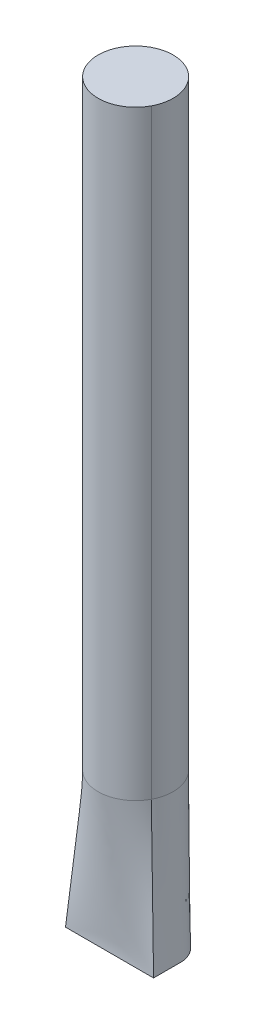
ISO-10303-21;
HEADER;
FILE_DESCRIPTION(('STEP AP214'),'2;1');
FILE_NAME('part.step','',(''),(''),'','','');
FILE_SCHEMA(('AUTOMOTIVE_DESIGN { 1 0 10303 214 1 1 1 1 }'));
ENDSEC;
DATA;
#1=APPLICATION_CONTEXT('core data for automotive mechanical design processes');
#2=APPLICATION_PROTOCOL_DEFINITION('international standard','automotive_design',2000,#1);
#3=PRODUCT_CONTEXT('',#1,'mechanical');
#4=PRODUCT('Part','Part','',(#3));
#5=PRODUCT_RELATED_PRODUCT_CATEGORY('part','',(#4));
#6=PRODUCT_DEFINITION_FORMATION('','',#4);
#7=PRODUCT_DEFINITION_CONTEXT('part definition',#1,'design');
#8=PRODUCT_DEFINITION('design','',#6,#7);
#9=PRODUCT_DEFINITION_SHAPE('','',#8);
#10=(LENGTH_UNIT() NAMED_UNIT(*) SI_UNIT(.MILLI.,.METRE.));
#11=(NAMED_UNIT(*) PLANE_ANGLE_UNIT() SI_UNIT($,.RADIAN.));
#12=(NAMED_UNIT(*) SI_UNIT($,.STERADIAN.) SOLID_ANGLE_UNIT());
#13=UNCERTAINTY_MEASURE_WITH_UNIT(LENGTH_MEASURE(1.E-05),#10,'distance_accuracy_value','');
#14=(GEOMETRIC_REPRESENTATION_CONTEXT(3) GLOBAL_UNCERTAINTY_ASSIGNED_CONTEXT((#13)) GLOBAL_UNIT_ASSIGNED_CONTEXT((#10,
#11,#12)) REPRESENTATION_CONTEXT('',''));
#15=CARTESIAN_POINT('',(0.,0.,0.));
#16=DIRECTION('',(0.,0.,1.));
#17=DIRECTION('',(1.,0.,0.));
#18=AXIS2_PLACEMENT_3D('',#15,#16,#17);
#19=CARTESIAN_POINT('',(0.,18.287961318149,0.));
#20=DIRECTION('',(0.,1.,0.));
#21=DIRECTION('',(0.884789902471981,0.,0.465990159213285));
#22=AXIS2_PLACEMENT_3D('',#19,#20,#21);
#23=CYLINDRICAL_SURFACE('',#22,4.7625);
#24=CARTESIAN_POINT('',(-4.21381211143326,94.488,-2.21927775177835));
#25=CARTESIAN_POINT('',(-4.18153475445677,94.488,-2.28056599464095));
#26=CARTESIAN_POINT('',(-4.14791854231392,94.488,-2.34114901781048));
#27=CARTESIAN_POINT('',(-4.07807634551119,94.488,-2.46079153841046));
#28=CARTESIAN_POINT('',(-4.04185036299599,94.488,-2.51985103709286));
#29=CARTESIAN_POINT('',(-3.966856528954,94.488,-2.63633349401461));
#30=CARTESIAN_POINT('',(-3.92808867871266,94.488,-2.69375645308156));
#31=CARTESIAN_POINT('',(-3.84808517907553,94.488,-2.80685670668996));
#32=CARTESIAN_POINT('',(-3.80684953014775,94.488,-2.86253400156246));
#33=CARTESIAN_POINT('',(-3.72198884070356,94.488,-2.97203691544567));
#34=CARTESIAN_POINT('',(-3.67836379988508,94.488,-3.02586253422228));
#35=CARTESIAN_POINT('',(-3.58880737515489,94.488,-3.13155966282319));
#36=CARTESIAN_POINT('',(-3.54287599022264,94.488,-3.1834311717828));
#37=CARTESIAN_POINT('',(-3.44879428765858,94.488,-3.28512134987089));
#38=CARTESIAN_POINT('',(-3.4006439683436,94.488,-3.33494001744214));
#39=CARTESIAN_POINT('',(-3.30221609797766,94.488,-3.43242962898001));
#40=CARTESIAN_POINT('',(-3.25193854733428,94.488,-3.48010057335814));
#41=CARTESIAN_POINT('',(-3.14935203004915,94.488,-3.57320389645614));
#42=CARTESIAN_POINT('',(-3.09704306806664,94.488,-3.61863628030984));
#43=CARTESIAN_POINT('',(-2.99049328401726,94.488,-3.70717604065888));
#44=CARTESIAN_POINT('',(-2.93625246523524,94.488,-3.75028342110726));
#45=CARTESIAN_POINT('',(-2.82594219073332,94.488,-3.83409115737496));
#46=CARTESIAN_POINT('',(-2.76987273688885,94.488,-3.8747915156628));
#47=CARTESIAN_POINT('',(-2.65601189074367,94.488,-3.95370776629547));
#48=CARTESIAN_POINT('',(-2.59822049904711,94.488,-3.99192365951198));
#49=CARTESIAN_POINT('',(-2.48102574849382,94.488,-4.06579826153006));
#50=CARTESIAN_POINT('',(-2.42162238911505,94.488,-4.10145696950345));
#51=CARTESIAN_POINT('',(-2.3013167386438,94.488,-4.17014934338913));
#52=CARTESIAN_POINT('',(-2.24041444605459,94.488,-4.20318300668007));
#53=CARTESIAN_POINT('',(-2.11722681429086,94.488,-4.26656242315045));
#54=CARTESIAN_POINT('',(-2.05494147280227,94.488,-4.29690817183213));
#55=CARTESIAN_POINT('',(-1.92910626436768,94.488,-4.35485399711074));
#56=CARTESIAN_POINT('',(-1.86555639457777,94.488,-4.38245406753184));
#57=CARTESIAN_POINT('',(-1.73731335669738,94.488,-4.43485587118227));
#58=CARTESIAN_POINT('',(-1.67262019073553,94.488,-4.45965760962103));
#59=CARTESIAN_POINT('',(-1.54221381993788,94.488,-4.50641551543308));
#60=CARTESIAN_POINT('',(-1.47650061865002,94.488,-4.52837169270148));
#61=CARTESIAN_POINT('',(-1.34417919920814,94.488,-4.56939673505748));
#62=CARTESIAN_POINT('',(-1.27757098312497,94.488,-4.58846560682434));
#63=CARTESIAN_POINT('',(-1.14358625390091,94.488,-4.62367978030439));
#64=CARTESIAN_POINT('',(-1.07620974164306,94.488,-4.63982508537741));
#65=CARTESIAN_POINT('',(-0.940816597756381,94.488,-4.6691614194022));
#66=CARTESIAN_POINT('',(-0.872799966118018,94.488,-4.68235244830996));
#67=CARTESIAN_POINT('',(-0.73625597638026,94.488,-4.70575513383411));
#68=CARTESIAN_POINT('',(-0.667728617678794,94.488,-4.71596678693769));
#69=CARTESIAN_POINT('',(-0.530293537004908,94.488,-4.73339128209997));
#70=CARTESIAN_POINT('',(-0.46138581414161,94.488,-4.7406041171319));
#71=CARTESIAN_POINT('',(-0.323321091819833,94.488,-4.75201723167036));
#72=CARTESIAN_POINT('',(-0.254164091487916,94.488,-4.75621750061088));
#73=CARTESIAN_POINT('',(-0.115732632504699,94.488,-4.76159744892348));
#74=CARTESIAN_POINT('',(-0.0464581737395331,94.488,-4.76277712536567));
#75=CARTESIAN_POINT('',(0.0920759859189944,94.488,-4.76211363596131));
#76=CARTESIAN_POINT('',(0.161335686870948,94.488,-4.76027048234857));
#77=CARTESIAN_POINT('',(0.299708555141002,94.488,-4.75356487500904));
#78=CARTESIAN_POINT('',(0.368821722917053,94.488,-4.74870243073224));
#79=CARTESIAN_POINT('',(0.506770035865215,94.488,-4.73596751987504));
#80=CARTESIAN_POINT('',(0.575605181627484,94.488,-4.72809505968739));
#81=CARTESIAN_POINT('',(0.712866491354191,94.488,-4.7093551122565));
#82=CARTESIAN_POINT('',(0.781292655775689,94.488,-4.698487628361));
#83=CARTESIAN_POINT('',(0.917605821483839,94.488,-4.67377831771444));
#84=CARTESIAN_POINT('',(0.985492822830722,94.488,-4.65993649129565));
#85=CARTESIAN_POINT('',(1.12059850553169,94.488,-4.62930482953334));
#86=CARTESIAN_POINT('',(1.18781718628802,94.488,-4.61251499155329));
#87=CARTESIAN_POINT('',(1.32145834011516,94.488,-4.57601924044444));
#88=CARTESIAN_POINT('',(1.38788081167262,94.488,-4.556313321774));
#89=CARTESIAN_POINT('',(1.51980317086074,94.488,-4.51402288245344));
#90=CARTESIAN_POINT('',(1.58530305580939,94.488,-4.49143835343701));
#91=CARTESIAN_POINT('',(1.71525561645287,94.488,-4.44343363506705));
#92=CARTESIAN_POINT('',(1.7797082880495,94.488,-4.41801343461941));
#93=CARTESIAN_POINT('',(1.90744350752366,94.488,-4.36438581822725));
#94=CARTESIAN_POINT('',(1.9707260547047,94.488,-4.33617840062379));
#95=CARTESIAN_POINT('',(2.09600025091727,94.488,-4.27703018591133));
#96=CARTESIAN_POINT('',(2.15799190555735,94.488,-4.24608940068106));
#97=CARTESIAN_POINT('',(2.28056639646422,94.488,-4.18153334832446));
#98=CARTESIAN_POINT('',(2.34114923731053,94.488,-4.14791808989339));
#99=CARTESIAN_POINT('',(2.4607908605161,94.488,-4.07807706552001));
#100=CARTESIAN_POINT('',(2.51984964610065,94.488,-4.04185130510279));
#101=CARTESIAN_POINT('',(2.63633081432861,94.488,-3.96685820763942));
#102=CARTESIAN_POINT('',(2.69375319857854,94.488,-3.92809087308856));
#103=CARTESIAN_POINT('',(2.80685232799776,94.488,-3.84808838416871));
#104=CARTESIAN_POINT('',(2.86252907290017,94.488,-3.80685322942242));
#105=CARTESIAN_POINT('',(2.97203100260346,94.488,-3.72199354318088));
#106=CARTESIAN_POINT('',(3.02585618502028,94.488,-3.67836900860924));
#107=CARTESIAN_POINT('',(3.13155258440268,94.488,-3.58881354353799));
#108=CARTESIAN_POINT('',(3.18342379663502,94.488,-3.54288260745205));
#109=CARTESIAN_POINT('',(3.28511355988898,94.488,-3.4488017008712));
#110=CARTESIAN_POINT('',(3.3349321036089,94.488,-3.40065172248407));
#111=CARTESIAN_POINT('',(3.43242169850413,94.488,-3.30222434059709));
#112=CARTESIAN_POINT('',(3.48009274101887,94.488,-3.25194692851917));
#113=CARTESIAN_POINT('',(3.57319626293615,94.488,-3.14936068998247));
#114=CARTESIAN_POINT('',(3.61862874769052,94.488,-3.09705186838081));
#115=CARTESIAN_POINT('',(3.70716863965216,94.488,-2.99050245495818));
#116=CARTESIAN_POINT('',(3.75027605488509,94.488,-2.93626186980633));
#117=CARTESIAN_POINT('',(3.83408381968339,94.488,-2.82595213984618));
#118=CARTESIAN_POINT('',(3.87478417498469,94.488,-2.76988299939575));
#119=CARTESIAN_POINT('',(3.95370040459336,94.488,-2.65602284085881));
#120=CARTESIAN_POINT('',(3.99191628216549,94.488,-2.5982318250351));
#121=CARTESIAN_POINT('',(4.06579086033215,94.488,-2.48103786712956));
#122=CARTESIAN_POINT('',(4.1014495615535,94.488,-2.42163492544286));
#123=CARTESIAN_POINT('',(4.17014194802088,94.488,-2.30133012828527));
#124=CARTESIAN_POINT('',(4.20317563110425,94.488,-2.24042827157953));
#125=CARTESIAN_POINT('',(4.26655512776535,94.488,-2.11724150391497));
#126=CARTESIAN_POINT('',(4.29690093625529,94.488,-2.05495659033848));
#127=CARTESIAN_POINT('',(4.35484693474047,94.488,-1.92912219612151));
#128=CARTESIAN_POINT('',(4.38244711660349,94.488,-1.86557271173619));
#129=CARTESIAN_POINT('',(4.43484932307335,94.488,-1.7373300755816));
#130=CARTESIAN_POINT('',(4.45965133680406,94.488,-1.67263691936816));
#131=CARTESIAN_POINT('',(4.50640985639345,94.488,-1.54223036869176));
#132=CARTESIAN_POINT('',(4.52836636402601,94.488,-1.47651697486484));
#133=CARTESIAN_POINT('',(4.56939204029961,94.488,-1.34419517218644));
#134=CARTESIAN_POINT('',(4.58846121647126,94.488,-1.27758676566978));
#135=CARTESIAN_POINT('',(4.62367596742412,94.488,-1.14360168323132));
#136=CARTESIAN_POINT('',(4.6398215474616,94.488,-1.07622500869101));
#137=CARTESIAN_POINT('',(4.66915839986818,94.488,-0.94083159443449));
#138=CARTESIAN_POINT('',(4.68234967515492,94.488,-0.872814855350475));
#139=CARTESIAN_POINT('',(4.70575282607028,94.488,-0.736270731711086));
#140=CARTESIAN_POINT('',(4.71596470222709,94.488,-0.667743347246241));
#141=CARTESIAN_POINT('',(4.73338962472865,94.488,-0.530308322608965));
#142=CARTESIAN_POINT('',(4.74060266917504,94.488,-0.461400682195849));
#143=CARTESIAN_POINT('',(4.75201619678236,94.488,-0.323336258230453));
#144=CARTESIAN_POINT('',(4.75621667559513,94.488,-0.25417947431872));
#145=CARTESIAN_POINT('',(4.76159706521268,94.488,-0.115748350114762));
#146=CARTESIAN_POINT('',(4.76277696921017,94.488,-0.0464740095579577));
#147=CARTESIAN_POINT('',(4.76211394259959,94.488,0.092060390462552));
#148=CARTESIAN_POINT('',(4.76027100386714,94.488,0.161320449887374));
#149=CARTESIAN_POINT('',(4.75356578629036,94.488,0.299694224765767));
#150=CARTESIAN_POINT('',(4.74870350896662,94.488,0.368807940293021));
#151=CARTESIAN_POINT('',(4.73596887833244,94.488,0.506757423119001));
#152=CARTESIAN_POINT('',(4.72809652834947,94.488,0.575593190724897));
#153=CARTESIAN_POINT('',(4.70935674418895,94.488,0.712855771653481));
#154=CARTESIAN_POINT('',(4.69848931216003,94.488,0.781282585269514));
#155=CARTESIAN_POINT('',(4.67378005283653,94.488,0.917597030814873));
#156=CARTESIAN_POINT('',(4.65993822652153,94.488,0.985484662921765));
#157=CARTESIAN_POINT('',(4.62930652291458,94.488,1.12059154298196));
#158=CARTESIAN_POINT('',(4.61251664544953,94.488,1.18781079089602));
#159=CARTESIAN_POINT('',(4.57602079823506,94.488,1.32145297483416));
#160=CARTESIAN_POINT('',(4.55631482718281,94.488,1.38787591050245));
#161=CARTESIAN_POINT('',(4.51402427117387,94.488,1.51979904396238));
#162=CARTESIAN_POINT('',(4.49143968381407,94.488,1.58529924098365));
#163=CARTESIAN_POINT('',(4.44343494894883,94.488,1.71525227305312));
#164=CARTESIAN_POINT('',(4.4180147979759,94.488,1.77970510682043));
#165=CARTESIAN_POINT('',(4.36438703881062,94.488,1.90744053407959));
#166=CARTESIAN_POINT('',(4.33617942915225,94.488,1.97072312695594));
#167=CARTESIAN_POINT('',(4.27703155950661,94.488,2.09599809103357));
#168=CARTESIAN_POINT('',(4.24609129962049,94.488,2.15799046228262));
#169=CARTESIAN_POINT('',(4.21381211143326,94.488,2.21927775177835));
#170=B_SPLINE_CURVE_WITH_KNOTS('',3,(#24,#25,#26,#27,#28,#29,#30,#31,#32,#33,#34,#35,#36,#37,
#38,#39,#40,#41,#42,#43,#44,#45,#46,#47,#48,#49,#50,#51,#52,#53,#54,#55,#56,#57,#58,#59,#60,#61,
#62,#63,#64,#65,#66,#67,#68,#69,#70,#71,#72,#73,#74,#75,#76,#77,#78,#79,#80,#81,#82,#83,#84,#85,
#86,#87,#88,#89,#90,#91,#92,#93,#94,#95,#96,#97,#98,#99,#100,#101,#102,#103,#104,#105,#106,#107,
#108,#109,#110,#111,#112,#113,#114,#115,#116,#117,#118,#119,#120,#121,#122,#123,#124,#125,#126,
#127,#128,#129,#130,#131,#132,#133,#134,#135,#136,#137,#138,#139,#140,#141,#142,#143,#144,#145,
#146,#147,#148,#149,#150,#151,#152,#153,#154,#155,#156,#157,#158,#159,#160,#161,#162,#163,#164,
#165,#166,#167,#168,#169),.UNSPECIFIED.,.F.,.F.,(4,2,2,2,2,2,2,2,2,2,2,2,2,2,2,2,2,2,2,2,2,2,2,
2,2,2,2,2,2,2,2,2,2,2,2,2,2,2,2,2,2,2,2,2,2,2,2,2,2,2,2,2,2,2,2,2,2,2,2,2,2,2,2,2,2,2,2,2,2,2,2,
2,4),(0.,0.207787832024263,0.41557549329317,0.623363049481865,0.831150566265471,
1.03893810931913,1.24672574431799,1.45451353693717,1.66230128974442,1.87008856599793,
2.07787548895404,2.28566219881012,2.49344883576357,2.70123554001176,2.90902245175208,
3.1168097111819,3.32459743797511,3.53238477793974,3.7401713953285,3.9479575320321,
4.15574342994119,4.36352933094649,4.57131547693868,4.77910210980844,4.98688947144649,
5.1946770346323,5.40246375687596,5.61024982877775,5.81803545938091,6.02582085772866,
6.23360623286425,6.44139179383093,6.64917774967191,6.85696430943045,7.06475168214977,
7.27253917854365,7.48032577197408,7.68811168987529,7.89589716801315,8.10368244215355,
8.31146774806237,8.51925332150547,8.72703939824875,8.93482621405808,9.14261386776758,
9.3504010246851,9.55818746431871,9.76597340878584,9.97375908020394,10.1815447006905,
10.3893304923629,10.5971166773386,10.804903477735,11.0126910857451,11.2204785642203,
11.428265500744,11.6360520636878,11.843838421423,12.0516247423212,12.2594111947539,
12.4671979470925,12.6749851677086,12.8827729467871,13.0905606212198,13.2983480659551,
13.5061353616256,13.713922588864,13.9217098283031,14.1294971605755,14.3372846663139,
14.545072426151,14.7528602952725,14.960648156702),.UNSPECIFIED.);
#171=CARTESIAN_POINT('',(-4.21381211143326,94.488,-2.21927775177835));
#172=VERTEX_POINT('',#171);
#173=CARTESIAN_POINT('',(4.21381211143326,94.488,2.21927775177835));
#174=VERTEX_POINT('',#173);
#175=EDGE_CURVE('E10',#172,#174,#170,.T.);
#176=ORIENTED_EDGE('',*,*,#175,.T.);
#177=CARTESIAN_POINT('',(4.21381117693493,18.2879999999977,2.21927952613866));
#178=CARTESIAN_POINT('',(4.21381118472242,18.9229999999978,2.21927951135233));
#179=CARTESIAN_POINT('',(4.21381119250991,19.5579999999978,2.21927949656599));
#180=CARTESIAN_POINT('',(4.21381120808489,20.8279999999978,2.21927946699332));
#181=CARTESIAN_POINT('',(4.21381121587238,21.4629999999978,2.21927945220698));
#182=CARTESIAN_POINT('',(4.21381123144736,22.7329999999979,2.21927942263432));
#183=CARTESIAN_POINT('',(4.21381123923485,23.3679999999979,2.21927940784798));
#184=CARTESIAN_POINT('',(4.21381125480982,24.6379999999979,2.21927937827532));
#185=CARTESIAN_POINT('',(4.21381126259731,25.272999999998,2.21927936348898));
#186=CARTESIAN_POINT('',(4.21381127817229,26.542999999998,2.21927933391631));
#187=CARTESIAN_POINT('',(4.21381128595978,27.177999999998,2.21927931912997));
#188=CARTESIAN_POINT('',(4.21381130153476,28.447999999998,2.21927928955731));
#189=CARTESIAN_POINT('',(4.21381130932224,29.0829999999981,2.21927927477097));
#190=CARTESIAN_POINT('',(4.21381132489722,30.3529999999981,2.2192792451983));
#191=CARTESIAN_POINT('',(4.21381133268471,30.9879999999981,2.21927923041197));
#192=CARTESIAN_POINT('',(4.21381134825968,32.2579999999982,2.2192792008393));
#193=CARTESIAN_POINT('',(4.21381135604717,32.8929999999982,2.21927918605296));
#194=CARTESIAN_POINT('',(4.21381137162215,34.1629999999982,2.21927915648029));
#195=CARTESIAN_POINT('',(4.21381137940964,34.7979999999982,2.21927914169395));
#196=CARTESIAN_POINT('',(4.21381139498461,36.0679999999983,2.21927911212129));
#197=CARTESIAN_POINT('',(4.2138114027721,36.7029999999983,2.21927909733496));
#198=CARTESIAN_POINT('',(4.21381141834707,37.9729999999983,2.21927906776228));
#199=CARTESIAN_POINT('',(4.21381142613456,38.6079999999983,2.21927905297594));
#200=CARTESIAN_POINT('',(4.21381144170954,39.8779999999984,2.21927902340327));
#201=CARTESIAN_POINT('',(4.21381144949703,40.5129999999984,2.21927900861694));
#202=CARTESIAN_POINT('',(4.213811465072,41.7829999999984,2.21927897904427));
#203=CARTESIAN_POINT('',(4.21381147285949,42.4179999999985,2.21927896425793));
#204=CARTESIAN_POINT('',(4.21381148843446,43.6879999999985,2.21927893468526));
#205=CARTESIAN_POINT('',(4.21381149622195,44.3229999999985,2.21927891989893));
#206=CARTESIAN_POINT('',(4.21381151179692,45.5929999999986,2.21927889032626));
#207=CARTESIAN_POINT('',(4.21381151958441,46.2279999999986,2.21927887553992));
#208=CARTESIAN_POINT('',(4.21381153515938,47.4979999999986,2.21927884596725));
#209=CARTESIAN_POINT('',(4.21381154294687,48.1329999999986,2.21927883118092));
#210=CARTESIAN_POINT('',(4.21381155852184,49.4029999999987,2.21927880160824));
#211=CARTESIAN_POINT('',(4.21381156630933,50.0379999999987,2.21927878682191));
#212=CARTESIAN_POINT('',(4.2138115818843,51.3079999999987,2.21927875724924));
#213=CARTESIAN_POINT('',(4.21381158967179,51.9429999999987,2.2192787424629));
#214=CARTESIAN_POINT('',(4.21381160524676,53.2129999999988,2.21927871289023));
#215=CARTESIAN_POINT('',(4.21381161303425,53.8479999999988,2.21927869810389));
#216=CARTESIAN_POINT('',(4.21381162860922,55.1179999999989,2.21927866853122));
#217=CARTESIAN_POINT('',(4.21381163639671,55.7529999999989,2.21927865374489));
#218=CARTESIAN_POINT('',(4.21381165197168,57.0229999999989,2.21927862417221));
#219=CARTESIAN_POINT('',(4.21381165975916,57.6579999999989,2.21927860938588));
#220=CARTESIAN_POINT('',(4.21381167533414,58.927999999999,2.21927857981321));
#221=CARTESIAN_POINT('',(4.21381168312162,59.562999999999,2.21927856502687));
#222=CARTESIAN_POINT('',(4.21381169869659,60.832999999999,2.2192785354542));
#223=CARTESIAN_POINT('',(4.21381170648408,61.467999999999,2.21927852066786));
#224=CARTESIAN_POINT('',(4.21381172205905,62.7379999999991,2.21927849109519));
#225=CARTESIAN_POINT('',(4.21381172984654,63.3729999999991,2.21927847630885));
#226=CARTESIAN_POINT('',(4.21381174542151,64.6429999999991,2.21927844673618));
#227=CARTESIAN_POINT('',(4.21381175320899,65.2779999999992,2.21927843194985));
#228=CARTESIAN_POINT('',(4.21381176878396,66.5479999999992,2.21927840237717));
#229=CARTESIAN_POINT('',(4.21381177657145,67.1829999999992,2.21927838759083));
#230=CARTESIAN_POINT('',(4.21381179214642,68.4529999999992,2.21927835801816));
#231=CARTESIAN_POINT('',(4.2138117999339,69.0879999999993,2.21927834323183));
#232=CARTESIAN_POINT('',(4.21381181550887,70.3579999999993,2.21927831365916));
#233=CARTESIAN_POINT('',(4.21381182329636,70.9929999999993,2.21927829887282));
#234=CARTESIAN_POINT('',(4.21381183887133,72.2629999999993,2.21927826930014));
#235=CARTESIAN_POINT('',(4.21381184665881,72.8979999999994,2.21927825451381));
#236=CARTESIAN_POINT('',(4.21381186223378,74.1679999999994,2.21927822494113));
#237=CARTESIAN_POINT('',(4.21381187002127,74.8029999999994,2.21927821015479));
#238=CARTESIAN_POINT('',(4.21381188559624,76.0729999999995,2.21927818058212));
#239=CARTESIAN_POINT('',(4.21381189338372,76.7079999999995,2.21927816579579));
#240=CARTESIAN_POINT('',(4.21381190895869,77.9779999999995,2.21927813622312));
#241=CARTESIAN_POINT('',(4.21381191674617,78.6129999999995,2.21927812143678));
#242=CARTESIAN_POINT('',(4.21381193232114,79.8829999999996,2.2192780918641));
#243=CARTESIAN_POINT('',(4.21381194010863,80.5179999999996,2.21927807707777));
#244=CARTESIAN_POINT('',(4.21381195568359,81.7879999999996,2.2192780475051));
#245=CARTESIAN_POINT('',(4.21381196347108,82.4229999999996,2.21927803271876));
#246=CARTESIAN_POINT('',(4.21381197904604,83.6929999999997,2.21927800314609));
#247=CARTESIAN_POINT('',(4.21381198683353,84.3279999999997,2.21927798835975));
#248=CARTESIAN_POINT('',(4.2138120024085,85.5979999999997,2.21927795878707));
#249=CARTESIAN_POINT('',(4.21381201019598,86.2329999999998,2.21927794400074));
#250=CARTESIAN_POINT('',(4.21381202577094,87.5029999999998,2.21927791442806));
#251=CARTESIAN_POINT('',(4.21381203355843,88.1379999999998,2.21927789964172));
#252=CARTESIAN_POINT('',(4.2138120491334,89.4079999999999,2.21927787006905));
#253=CARTESIAN_POINT('',(4.21381205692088,90.0429999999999,2.21927785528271));
#254=CARTESIAN_POINT('',(4.21381207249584,91.3129999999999,2.21927782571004));
#255=CARTESIAN_POINT('',(4.21381208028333,91.9479999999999,2.2192778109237));
#256=CARTESIAN_POINT('',(4.21381209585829,93.218,2.21927778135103));
#257=CARTESIAN_POINT('',(4.21381210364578,93.853,2.21927776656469));
#258=CARTESIAN_POINT('',(4.21381211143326,94.488,2.21927775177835));
#259=B_SPLINE_CURVE_WITH_KNOTS('',3,(#177,#178,#179,#180,#181,#182,#183,#184,#185,#186,#187,
#188,#189,#190,#191,#192,#193,#194,#195,#196,#197,#198,#199,#200,#201,#202,#203,#204,#205,#206,
#207,#208,#209,#210,#211,#212,#213,#214,#215,#216,#217,#218,#219,#220,#221,#222,#223,#224,#225,
#226,#227,#228,#229,#230,#231,#232,#233,#234,#235,#236,#237,#238,#239,#240,#241,#242,#243,#244,
#245,#246,#247,#248,#249,#250,#251,#252,#253,#254,#255,#256,#257,#258),.UNSPECIFIED.,.F.,.F.,(4,
2,2,2,2,2,2,2,2,2,2,2,2,2,2,2,2,2,2,2,2,2,2,2,2,2,2,2,2,2,2,2,2,2,2,2,2,2,2,2,4),(0.,
1.90500000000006,3.81000000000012,5.71500000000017,7.62000000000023,9.52500000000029,
11.4300000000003,13.3350000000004,15.2400000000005,17.1450000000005,19.0500000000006,
20.9550000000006,22.8600000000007,24.7650000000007,26.6700000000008,28.5750000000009,
30.4800000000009,32.385000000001,34.290000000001,36.1950000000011,38.1000000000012,
40.0050000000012,41.9100000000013,43.8150000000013,45.7200000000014,47.6250000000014,
49.5300000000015,51.4350000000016,53.3400000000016,55.2450000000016,57.1500000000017,
59.0550000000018,60.9600000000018,62.8650000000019,64.7700000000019,66.675000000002,
68.580000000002,70.4850000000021,72.3900000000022,74.2950000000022,76.2000000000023),.UNSPECIFIED.);
#260=CARTESIAN_POINT('',(4.21381117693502,18.2879999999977,2.2192795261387));
#261=VERTEX_POINT('',#260);
#262=EDGE_CURVE('E33',#261,#174,#259,.T.);
#263=ORIENTED_EDGE('',*,*,#262,.F.);
#264=CARTESIAN_POINT('',(-4.2136702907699,18.2879483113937,-2.21920190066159));
#265=CARTESIAN_POINT('',(-4.19884414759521,18.2879484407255,-2.24735118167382));
#266=CARTESIAN_POINT('',(-4.18373727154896,18.2879485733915,-2.27535260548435));
#267=CARTESIAN_POINT('',(-4.15296803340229,18.2879488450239,-2.33104850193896));
#268=CARTESIAN_POINT('',(-4.13730567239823,18.2879489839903,-2.35874297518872));
#269=CARTESIAN_POINT('',(-4.10543145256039,18.2879492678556,-2.41381372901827));
#270=CARTESIAN_POINT('',(-4.08921959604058,18.2879494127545,-2.44119001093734));
#271=CARTESIAN_POINT('',(-4.056252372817,18.287949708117,-2.49561313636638));
#272=CARTESIAN_POINT('',(-4.03949700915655,18.2879498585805,-2.52265998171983));
#273=CARTESIAN_POINT('',(-4.00544876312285,18.2879501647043,-2.57641299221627));
#274=CARTESIAN_POINT('',(-3.98815588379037,18.2879503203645,-2.6031191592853));
#275=CARTESIAN_POINT('',(-3.95303858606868,18.2879506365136,-2.65617956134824));
#276=CARTESIAN_POINT('',(-3.93521416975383,18.2879507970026,-2.68253379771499));
#277=CARTESIAN_POINT('',(-3.89903982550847,18.2879511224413,-2.73487912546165));
#278=CARTESIAN_POINT('',(-3.88068989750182,18.2879512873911,-2.76087021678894));
#279=CARTESIAN_POINT('',(-3.84347038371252,18.2879516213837,-2.81247789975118));
#280=CARTESIAN_POINT('',(-3.82460079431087,18.2879517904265,-2.83809448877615));
#281=CARTESIAN_POINT('',(-3.78634855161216,18.2879521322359,-2.88894223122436));
#282=CARTESIAN_POINT('',(-3.76696589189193,18.2879523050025,-2.91417337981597));
#283=CARTESIAN_POINT('',(-3.72769173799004,18.287952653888,-2.96423516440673));
#284=CARTESIAN_POINT('',(-3.70780026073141,18.2879528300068,-2.98906581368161));
#285=CARTESIAN_POINT('',(-3.66751887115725,18.2879531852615,-3.03831811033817));
#286=CARTESIAN_POINT('',(-3.64712897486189,18.2879533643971,-3.06273977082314));
#287=CARTESIAN_POINT('',(-3.60586055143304,18.2879537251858,-3.11116602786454));
#288=CARTESIAN_POINT('',(-3.58498203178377,18.2879539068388,-3.13517063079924));
#289=CARTESIAN_POINT('',(-3.54256712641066,18.2879542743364,-3.18295650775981));
#290=CARTESIAN_POINT('',(-3.52102666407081,18.2879544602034,-3.20673416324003));
#291=CARTESIAN_POINT('',(-3.47675045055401,18.2879548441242,-3.25462600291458));
#292=CARTESIAN_POINT('',(-3.45399871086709,18.2879550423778,-3.27872540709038));
#293=CARTESIAN_POINT('',(-3.40717903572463,18.2879554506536,-3.32729406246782));
#294=CARTESIAN_POINT('',(-3.38309307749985,18.2879556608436,-3.35174594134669));
#295=CARTESIAN_POINT('',(-3.33350783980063,18.28795609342,-3.40101183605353));
#296=CARTESIAN_POINT('',(-3.30798911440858,18.287956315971,-3.4258062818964));
#297=CARTESIAN_POINT('',(-3.25543713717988,18.2879567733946,-3.47574054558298));
#298=CARTESIAN_POINT('',(-3.22838299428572,18.2879570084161,-3.50085837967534));
#299=CARTESIAN_POINT('',(-3.17265502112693,18.2879574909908,-3.55141269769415));
#300=CARTESIAN_POINT('',(-3.14395884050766,18.2879577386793,-3.57682454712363));
#301=CARTESIAN_POINT('',(-3.08483785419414,18.2879582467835,-3.6279292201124));
#302=CARTESIAN_POINT('',(-3.05438923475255,18.2879585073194,-3.65359449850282));
#303=CARTESIAN_POINT('',(-2.99165089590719,18.2879590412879,-3.70515630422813));
#304=CARTESIAN_POINT('',(-2.95933590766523,18.2879593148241,-3.73102209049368));
#305=CARTESIAN_POINT('',(-2.89279136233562,18.2879598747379,-3.78288902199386));
#306=CARTESIAN_POINT('',(-2.85853598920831,18.2879601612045,-3.80885705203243));
#307=CARTESIAN_POINT('',(-2.78827897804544,18.2879607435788,-3.86064492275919));
#308=CARTESIAN_POINT('',(-2.75225599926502,18.2879610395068,-3.88643581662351));
#309=CARTESIAN_POINT('',(-2.67851516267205,18.2879616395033,-3.93769832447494));
#310=CARTESIAN_POINT('',(-2.64077788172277,18.2879619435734,-3.96314200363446));
#311=CARTESIAN_POINT('',(-2.56363600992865,18.2879625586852,-4.01356455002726));
#312=CARTESIAN_POINT('',(-2.52421333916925,18.2879628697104,-4.0385157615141));
#313=CARTESIAN_POINT('',(-2.44373589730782,18.2879634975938,-4.08780920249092));
#314=CARTESIAN_POINT('',(-2.40266444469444,18.2879638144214,-4.11212420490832));
#315=CARTESIAN_POINT('',(-2.31893095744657,18.2879644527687,-4.16000008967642));
#316=CARTESIAN_POINT('',(-2.27625364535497,18.2879647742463,-4.18353425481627));
#317=CARTESIAN_POINT('',(-2.18936180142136,18.2879654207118,-4.22971403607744));
#318=CARTESIAN_POINT('',(-2.14513349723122,18.2879657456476,-4.25233375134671));
#319=CARTESIAN_POINT('',(-2.05519578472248,18.2879663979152,-4.29651195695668));
#320=CARTESIAN_POINT('',(-2.00947399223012,18.2879667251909,-4.31804525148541));
#321=CARTESIAN_POINT('',(-1.91662744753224,18.2879673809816,-4.35991930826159));
#322=CARTESIAN_POINT('',(-1.86949193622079,18.2879677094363,-4.38023621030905));
#323=CARTESIAN_POINT('',(-1.77390378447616,18.2879683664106,-4.41957824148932));
#324=CARTESIAN_POINT('',(-1.7254419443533,18.2879686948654,-4.43858101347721));
#325=CARTESIAN_POINT('',(-1.62729211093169,18.2879693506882,-4.47519689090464));
#326=CARTESIAN_POINT('',(-1.57759636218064,18.287969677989,-4.49278920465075));
#327=CARTESIAN_POINT('',(-1.47707761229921,18.2879703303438,-4.52649499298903));
#328=CARTESIAN_POINT('',(-1.42624821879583,18.2879706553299,-4.54258940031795));
#329=CARTESIAN_POINT('',(-1.32356761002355,18.2879713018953,-4.57321731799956));
#330=CARTESIAN_POINT('',(-1.27171125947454,18.2879716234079,-4.58773360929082));
#331=CARTESIAN_POINT('',(-1.16708836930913,18.2879722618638,-4.61513117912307));
#332=CARTESIAN_POINT('',(-1.11431783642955,18.2879725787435,-4.62799720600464));
#333=CARTESIAN_POINT('',(-1.00798372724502,18.2879732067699,-4.65202820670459));
#334=CARTESIAN_POINT('',(-0.954417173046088,18.2879735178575,-4.66318000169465));
#335=CARTESIAN_POINT('',(-0.84661302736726,18.2879741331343,-4.68372486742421));
#336=CARTESIAN_POINT('',(-0.792373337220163,18.2879744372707,-4.69310692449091));
#337=CARTESIAN_POINT('',(-0.683349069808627,18.287975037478,-4.7100632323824));
#338=CARTESIAN_POINT('',(-0.628563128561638,18.287975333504,-4.7176287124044));
#339=CARTESIAN_POINT('',(-0.51857590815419,18.2879759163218,-4.73091158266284));
#340=CARTESIAN_POINT('',(-0.463373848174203,18.2879762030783,-4.73662250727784));
#341=CARTESIAN_POINT('',(-0.352686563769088,18.2879767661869,-4.7461649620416));
#342=CARTESIAN_POINT('',(-0.297200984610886,18.2879770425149,-4.74999237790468));
#343=CARTESIAN_POINT('',(-0.186080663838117,18.2879775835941,-4.75574564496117));
#344=CARTESIAN_POINT('',(-0.130445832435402,18.2879778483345,-4.75766976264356));
#345=CARTESIAN_POINT('',(-0.0191620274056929,18.2879783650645,-4.75960352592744));
#346=CARTESIAN_POINT('',(0.0364869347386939,18.2879786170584,-4.75961383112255));
#347=CARTESIAN_POINT('',(0.147663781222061,18.287979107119,-4.75771642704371));
#348=CARTESIAN_POINT('',(0.203191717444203,18.2879793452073,-4.75581176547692));
#349=CARTESIAN_POINT('',(0.313991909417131,18.2879798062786,-4.75009031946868));
#350=CARTESIAN_POINT('',(0.36926444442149,18.2879800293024,-4.74627894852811));
#351=CARTESIAN_POINT('',(0.479420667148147,18.2879804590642,-4.73675946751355));
#352=CARTESIAN_POINT('',(0.534305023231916,18.2879806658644,-4.73105909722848));
#353=CARTESIAN_POINT('',(0.643553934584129,18.2879810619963,-4.71778645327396));
#354=CARTESIAN_POINT('',(0.697919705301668,18.2879812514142,-4.71022418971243));
#355=CARTESIAN_POINT('',(0.806003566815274,18.2879816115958,-4.69326222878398));
#356=CARTESIAN_POINT('',(0.859723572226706,18.2879817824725,-4.68387473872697));
#357=CARTESIAN_POINT('',(0.966391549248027,18.2879821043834,-4.6633056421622));
#358=CARTESIAN_POINT('',(1.01934228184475,18.2879822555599,-4.65213835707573));
#359=CARTESIAN_POINT('',(1.12435271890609,18.2879825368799,-4.62806447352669));
#360=CARTESIAN_POINT('',(1.17641616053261,18.2879826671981,-4.61517419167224));
#361=CARTESIAN_POINT('',(1.27953115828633,18.2879829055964,-4.58771147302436));
#362=CARTESIAN_POINT('',(1.33058762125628,18.2879830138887,-4.5731574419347));
#363=CARTESIAN_POINT('',(1.4315869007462,18.2879832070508,-4.54253527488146));
#364=CARTESIAN_POINT('',(1.48153575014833,18.2879832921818,-4.52648701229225));
#365=CARTESIAN_POINT('',(1.58021692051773,18.2879834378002,-4.49297160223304));
#366=CARTESIAN_POINT('',(1.62895659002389,18.2879834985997,-4.47552609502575));
#367=CARTESIAN_POINT('',(1.72512767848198,18.2879835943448,-4.43932785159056));
#368=CARTESIAN_POINT('',(1.77256778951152,18.2879836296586,-4.42059820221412));
#369=CARTESIAN_POINT('',(1.86605446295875,18.2879836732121,-4.38194593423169));
#370=CARTESIAN_POINT('',(1.9121111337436,18.2879836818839,-4.36204776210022));
#371=CARTESIAN_POINT('',(2.00275330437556,18.2879836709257,-4.3211785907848));
#372=CARTESIAN_POINT('',(2.04735037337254,18.2879836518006,-4.30023324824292));
#373=CARTESIAN_POINT('',(2.13500311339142,18.2879835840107,-4.257393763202));
#374=CARTESIAN_POINT('',(2.17807185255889,18.2879835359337,-4.23552635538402));
#375=CARTESIAN_POINT('',(2.26260626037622,18.2879834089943,-4.1909725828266));
#376=CARTESIAN_POINT('',(2.30408649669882,18.2879833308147,-4.16831386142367));
#377=CARTESIAN_POINT('',(2.38538012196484,18.2879831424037,-4.12229817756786));
#378=CARTESIAN_POINT('',(2.42520979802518,18.2879830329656,-4.09896998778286));
#379=CARTESIAN_POINT('',(2.50316463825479,18.2879827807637,-4.05176460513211));
#380=CARTESIAN_POINT('',(2.54130739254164,18.287982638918,-4.02791645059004));
#381=CARTESIAN_POINT('',(2.61585701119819,18.2879823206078,-3.97981768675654));
#382=CARTESIAN_POINT('',(2.65228273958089,18.2879821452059,-3.95559630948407));
#383=CARTESIAN_POINT('',(2.72337424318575,18.2879817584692,-3.90689870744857));
#384=CARTESIAN_POINT('',(2.75806007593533,18.2879815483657,-3.88245175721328));
#385=CARTESIAN_POINT('',(2.8256543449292,18.2879810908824,-3.83345013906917));
#386=CARTESIAN_POINT('',(2.85858394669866,18.287980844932,-3.80892466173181));
#387=CARTESIAN_POINT('',(2.92265476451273,18.2879803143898,-3.7599124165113));
#388=CARTESIAN_POINT('',(2.95381814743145,18.287980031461,-3.7354546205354));
#389=CARTESIAN_POINT('',(3.01435159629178,18.2879794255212,-3.68672293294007));
#390=CARTESIAN_POINT('',(3.04374470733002,18.2879791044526,-3.6624776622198));
#391=CARTESIAN_POINT('',(3.10073830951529,18.2879784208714,-3.61431456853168));
#392=CARTESIAN_POINT('',(3.12836258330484,18.2879780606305,-3.59042488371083));
#393=CARTESIAN_POINT('',(3.18183483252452,18.2879772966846,-3.54310513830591));
#394=CARTESIAN_POINT('',(3.20770696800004,18.2879768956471,-3.5197023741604));
#395=CARTESIAN_POINT('',(3.25789038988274,18.2879760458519,-3.47330463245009));
#396=CARTESIAN_POINT('',(3.28222229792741,18.2879755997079,-3.45033195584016));
#397=CARTESIAN_POINT('',(3.32964620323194,18.2879746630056,-3.40460983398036));
#398=CARTESIAN_POINT('',(3.3527531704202,18.287974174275,-3.38187591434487));
#399=CARTESIAN_POINT('',(3.39802044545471,18.2879731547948,-3.33642691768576));
#400=CARTESIAN_POINT('',(3.42019044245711,18.2879726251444,-3.31372149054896));
#401=CARTESIAN_POINT('',(3.46385666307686,18.2879715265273,-3.26810202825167));
#402=CARTESIAN_POINT('',(3.48535739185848,18.2879709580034,-3.24519230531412));
#403=CARTESIAN_POINT('',(3.52793743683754,18.2879697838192,-3.19891574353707));
#404=CARTESIAN_POINT('',(3.54901601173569,18.2879691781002,-3.17554822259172));
#405=CARTESIAN_POINT('',(3.59090709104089,18.2879679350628,-3.12817358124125));
#406=CARTESIAN_POINT('',(3.61171508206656,18.2879672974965,-3.10416246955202));
#407=CARTESIAN_POINT('',(3.65287243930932,18.2879659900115,-3.05569667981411));
#408=CARTESIAN_POINT('',(3.67322117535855,18.287965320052,-3.03124146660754));
#409=CARTESIAN_POINT('',(3.7134224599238,18.2879639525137,-2.98192641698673));
#410=CARTESIAN_POINT('',(3.73327500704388,18.2879632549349,-2.95706657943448));
#411=CARTESIAN_POINT('',(3.7724744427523,18.2879618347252,-2.90695075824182));
#412=CARTESIAN_POINT('',(3.7918213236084,18.287961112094,-2.88169476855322));
#413=CARTESIAN_POINT('',(3.82999988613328,18.2879596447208,-2.83079503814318));
#414=CARTESIAN_POINT('',(3.84883155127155,18.2879588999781,-2.80515128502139));
#415=CARTESIAN_POINT('',(3.88597013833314,18.2879573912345,-2.75348511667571));
#416=CARTESIAN_POINT('',(3.90427703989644,18.2879566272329,-2.72746268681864));
#417=CARTESIAN_POINT('',(3.9403669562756,18.2879550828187,-2.67505696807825));
#418=CARTESIAN_POINT('',(3.95814996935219,18.2879543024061,-2.64867367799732));
#419=CARTESIAN_POINT('',(3.99318356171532,18.2879527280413,-2.59555590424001));
#420=CARTESIAN_POINT('',(4.01043414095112,18.2879519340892,-2.56882142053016));
#421=CARTESIAN_POINT('',(4.04439619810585,18.287950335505,-2.51501221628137));
#422=CARTESIAN_POINT('',(4.06110767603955,18.2879495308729,-2.48793749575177));
#423=CARTESIAN_POINT('',(4.09398497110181,18.2879479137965,-2.43345884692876));
#424=CARTESIAN_POINT('',(4.11015079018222,18.2879471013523,-2.40605491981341));
#425=CARTESIAN_POINT('',(4.1419237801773,18.2879454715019,-2.35092584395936));
#426=CARTESIAN_POINT('',(4.15753096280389,18.287944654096,-2.32320070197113));
#427=CARTESIAN_POINT('',(4.18818304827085,18.2879430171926,-2.26744180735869));
#428=CARTESIAN_POINT('',(4.20322795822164,18.2879421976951,-2.23940805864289));
#429=CARTESIAN_POINT('',(4.23275095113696,18.2879405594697,-2.18304378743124));
#430=CARTESIAN_POINT('',(4.24722903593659,18.2879397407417,-2.15471326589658));
#431=CARTESIAN_POINT('',(4.27561409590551,18.2879381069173,-2.09776745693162));
#432=CARTESIAN_POINT('',(4.28952106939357,18.287937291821,-2.06915216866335));
#433=CARTESIAN_POINT('',(4.31675955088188,18.287935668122,-2.01164878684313));
#434=CARTESIAN_POINT('',(4.33009105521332,18.2879348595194,-1.98276069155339));
#435=CARTESIAN_POINT('',(4.35617426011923,18.2879332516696,-1.92472366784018));
#436=CARTESIAN_POINT('',(4.36892595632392,18.2879324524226,-1.89557473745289));
#437=CARTESIAN_POINT('',(4.3938452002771,18.2879308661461,-1.83702801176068));
#438=CARTESIAN_POINT('',(4.40601274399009,18.2879300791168,-1.80763021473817));
#439=CARTESIAN_POINT('',(4.42975933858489,18.2879285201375,-1.74859772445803));
#440=CARTESIAN_POINT('',(4.44133838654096,18.2879277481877,-1.71896303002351));
#441=CARTESIAN_POINT('',(4.46390364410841,18.2879262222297,-1.65946871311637));
#442=CARTESIAN_POINT('',(4.47488985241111,18.2879254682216,-1.6296090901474));
#443=CARTESIAN_POINT('',(4.49626508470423,18.2879239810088,-1.56967688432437));
#444=CARTESIAN_POINT('',(4.50665410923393,18.2879232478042,-1.53960430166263));
#445=CARTESIAN_POINT('',(4.52683062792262,18.2879218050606,-1.47925814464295));
#446=CARTESIAN_POINT('',(4.53661812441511,18.2879210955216,-1.44898457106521));
#447=CARTESIAN_POINT('',(4.55558724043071,18.2879197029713,-1.38824840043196));
#448=CARTESIAN_POINT('',(4.56476886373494,18.2879190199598,-1.3577858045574));
#449=CARTESIAN_POINT('',(4.58252188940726,18.2879176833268,-1.29668355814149));
#450=CARTESIAN_POINT('',(4.59109329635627,18.287917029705,-1.26604390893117));
#451=CARTESIAN_POINT('',(4.60762153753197,18.2879157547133,-1.20459952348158));
#452=CARTESIAN_POINT('',(4.615578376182,18.2879151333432,-1.17379478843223));
#453=CARTESIAN_POINT('',(4.63087316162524,18.2879139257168,-1.11203220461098));
#454=CARTESIAN_POINT('',(4.6382111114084,18.2879133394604,-1.08107435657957));
#455=CARTESIAN_POINT('',(4.65226368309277,18.2879122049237,-1.01901750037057));
#456=CARTESIAN_POINT('',(4.65897830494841,18.2879116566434,-0.987918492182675));
#457=CARTESIAN_POINT('',(4.67178022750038,18.2879106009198,-0.925591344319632));
#458=CARTESIAN_POINT('',(4.67786752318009,18.2879100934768,-0.894363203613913));
#459=CARTESIAN_POINT('',(4.68940915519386,18.2879091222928,-0.831789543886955));
#460=CARTESIAN_POINT('',(4.6948634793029,18.2879086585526,-0.800444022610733));
#461=CARTESIAN_POINT('',(4.70513967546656,18.2879077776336,-0.737649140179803));
#462=CARTESIAN_POINT('',(4.70996154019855,18.2879073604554,-0.706199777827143));
#463=CARTESIAN_POINT('',(4.71897448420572,18.2879065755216,-0.643210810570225));
#464=CARTESIAN_POINT('',(4.72316556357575,18.2879062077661,-0.611671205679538));
#465=CARTESIAN_POINT('',(4.73091496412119,18.2879055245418,-0.548514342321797));
#466=CARTESIAN_POINT('',(4.73447328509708,18.2879052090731,-0.516897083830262));
#467=CARTESIAN_POINT('',(4.74095613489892,18.2879046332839,-0.453597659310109));
#468=CARTESIAN_POINT('',(4.74388066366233,18.2879043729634,-0.421915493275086));
#469=CARTESIAN_POINT('',(4.74909486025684,18.2879039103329,-0.358498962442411));
#470=CARTESIAN_POINT('',(4.75138452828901,18.287903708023,-0.326764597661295));
#471=CARTESIAN_POINT('',(4.75532713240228,18.2879033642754,-0.263256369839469));
#472=CARTESIAN_POINT('',(4.7569800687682,18.2879032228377,-0.231482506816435));
#473=CARTESIAN_POINT('',(4.75965058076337,18.2879030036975,-0.167908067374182));
#474=CARTESIAN_POINT('',(4.76066815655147,18.2879029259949,-0.136107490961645));
#475=CARTESIAN_POINT('',(4.76205676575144,18.2879028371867,-0.0724935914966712));
#476=CARTESIAN_POINT('',(4.76242782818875,18.2879028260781,-0.0406802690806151));
#477=CARTESIAN_POINT('',(4.76252111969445,18.2879028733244,0.0229455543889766));
#478=CARTESIAN_POINT('',(4.762243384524,18.2879029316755,0.0547580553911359));
#479=CARTESIAN_POINT('',(4.76104337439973,18.2879031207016,0.118369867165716));
#480=CARTESIAN_POINT('',(4.76012111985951,18.2879032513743,0.150169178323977));
#481=CARTESIAN_POINT('',(4.75763461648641,18.2879035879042,0.213742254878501));
#482=CARTESIAN_POINT('',(4.75607037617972,18.2879037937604,0.245516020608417));
#483=CARTESIAN_POINT('',(4.75230291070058,18.2879042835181,0.309025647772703));
#484=CARTESIAN_POINT('',(4.75009968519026,18.2879045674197,0.340761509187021));
#485=CARTESIAN_POINT('',(4.74505713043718,18.287905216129,0.404182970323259));
#486=CARTESIAN_POINT('',(4.74221779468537,18.2879055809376,0.435868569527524));
#487=CARTESIAN_POINT('',(4.73590593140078,18.2879063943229,0.499177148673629));
#488=CARTESIAN_POINT('',(4.73243339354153,18.287906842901,0.530800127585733));
#489=CARTESIAN_POINT('',(4.72485802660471,18.2879078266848,0.593971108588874));
#490=CARTESIAN_POINT('',(4.72075518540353,18.2879083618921,0.625519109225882));
#491=CARTESIAN_POINT('',(4.71192211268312,18.2879095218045,0.68852777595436));
#492=CARTESIAN_POINT('',(4.70719186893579,18.2879101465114,0.719988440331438));
#493=CARTESIAN_POINT('',(4.69710688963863,18.2879114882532,0.782810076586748));
#494=CARTESIAN_POINT('',(4.69175214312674,18.2879122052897,0.814171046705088));
#495=CARTESIAN_POINT('',(4.68042105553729,18.2879137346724,0.876780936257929));
#496=CARTESIAN_POINT('',(4.67444470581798,18.2879145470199,0.908029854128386));
#497=CARTESIAN_POINT('',(4.66187330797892,18.2879162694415,0.970403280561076));
#498=CARTESIAN_POINT('',(4.65527825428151,18.2879171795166,1.0015277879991));
#499=CARTESIAN_POINT('',(4.64147234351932,18.2879191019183,1.06364003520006));
#500=CARTESIAN_POINT('',(4.63426148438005,18.2879201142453,1.09462777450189));
#501=CARTESIAN_POINT('',(4.61922685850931,18.2879222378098,1.15645412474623));
#502=CARTESIAN_POINT('',(4.61140309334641,18.287923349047,1.18729273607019));
#503=CARTESIAN_POINT('',(4.59514554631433,18.2879256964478,1.24880847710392));
#504=CARTESIAN_POINT('',(4.586711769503,18.2879269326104,1.27948560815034));
#505=CARTESIAN_POINT('',(4.5692371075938,18.2879294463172,1.34066600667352));
#506=CARTESIAN_POINT('',(4.56019623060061,18.2879307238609,1.37116927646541));
#507=CARTESIAN_POINT('',(4.540763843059,18.2879337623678,1.43441900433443));
#508=CARTESIAN_POINT('',(4.53032213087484,18.2879355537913,1.46715004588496));
#509=CARTESIAN_POINT('',(4.50701077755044,18.2879399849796,1.53759824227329));
#510=CARTESIAN_POINT('',(4.49401996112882,18.2879427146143,1.57527534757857));
#511=CARTESIAN_POINT('',(4.46543399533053,18.287948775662,1.65493687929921));
#512=CARTESIAN_POINT('',(4.44971553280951,18.2879521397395,1.69687709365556));
#513=CARTESIAN_POINT('',(4.41581338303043,18.2879593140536,1.78359426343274));
#514=CARTESIAN_POINT('',(4.39753304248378,18.2879631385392,1.82833346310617));
#515=CARTESIAN_POINT('',(4.3598602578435,18.2879704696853,1.91665293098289));
#516=CARTESIAN_POINT('',(4.34048540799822,18.2879739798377,1.96024070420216));
#517=CARTESIAN_POINT('',(4.30209019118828,18.287980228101,2.0432043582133));
#518=CARTESIAN_POINT('',(4.28317462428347,18.2879830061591,2.08262875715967));
#519=CARTESIAN_POINT('',(4.24745960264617,18.2879869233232,2.15447322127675));
#520=CARTESIAN_POINT('',(4.23082589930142,18.287988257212,2.18697576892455));
#521=CARTESIAN_POINT('',(4.2138130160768,18.2879888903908,2.2192784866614));
#522=B_SPLINE_CURVE_WITH_KNOTS('',3,(#264,#265,#266,#267,#268,#269,#270,#271,#272,#273,#274,
#275,#276,#277,#278,#279,#280,#281,#282,#283,#284,#285,#286,#287,#288,#289,#290,#291,#292,#293,
#294,#295,#296,#297,#298,#299,#300,#301,#302,#303,#304,#305,#306,#307,#308,#309,#310,#311,#312,
#313,#314,#315,#316,#317,#318,#319,#320,#321,#322,#323,#324,#325,#326,#327,#328,#329,#330,#331,
#332,#333,#334,#335,#336,#337,#338,#339,#340,#341,#342,#343,#344,#345,#346,#347,#348,#349,#350,
#351,#352,#353,#354,#355,#356,#357,#358,#359,#360,#361,#362,#363,#364,#365,#366,#367,#368,#369,
#370,#371,#372,#373,#374,#375,#376,#377,#378,#379,#380,#381,#382,#383,#384,#385,#386,#387,#388,
#389,#390,#391,#392,#393,#394,#395,#396,#397,#398,#399,#400,#401,#402,#403,#404,#405,#406,#407,
#408,#409,#410,#411,#412,#413,#414,#415,#416,#417,#418,#419,#420,#421,#422,#423,#424,#425,#426,
#427,#428,#429,#430,#431,#432,#433,#434,#435,#436,#437,#438,#439,#440,#441,#442,#443,#444,#445,
#446,#447,#448,#449,#450,#451,#452,#453,#454,#455,#456,#457,#458,#459,#460,#461,#462,#463,#464,
#465,#466,#467,#468,#469,#470,#471,#472,#473,#474,#475,#476,#477,#478,#479,#480,#481,#482,#483,
#484,#485,#486,#487,#488,#489,#490,#491,#492,#493,#494,#495,#496,#497,#498,#499,#500,#501,#502,
#503,#504,#505,#506,#507,#508,#509,#510,#511,#512,#513,#514,#515,#516,#517,#518,#519,#520,#521),
.UNSPECIFIED.,.F.,.F.,(4,2,2,2,2,2,2,2,2,2,2,2,2,2,2,2,2,2,2,2,2,2,2,2,2,2,2,2,2,2,2,2,2,2,2,2,
2,2,2,2,2,2,2,2,2,2,2,2,2,2,2,2,2,2,2,2,2,2,2,2,2,2,2,2,2,2,2,2,2,2,2,2,2,2,2,2,2,2,2,2,2,2,2,2,
2,2,2,2,2,2,2,2,2,2,2,2,2,2,2,2,2,2,2,2,2,2,2,2,2,2,2,2,2,2,2,2,2,2,2,2,2,2,2,2,2,2,2,2,4),(0.,
0.0954435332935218,0.190886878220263,0.286329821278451,0.381772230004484,0.477214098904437,
0.572655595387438,0.668097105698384,0.763539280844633,0.8589826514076,0.954422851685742,
1.0498599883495,1.14529566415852,1.24154041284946,1.3409605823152,1.44391983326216,
1.55065239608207,1.66139222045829,1.77637294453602,1.89582788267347,2.01999004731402,
2.14893158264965,2.28182590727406,2.41834800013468,2.55829359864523,2.70145964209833,
2.8476448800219,2.99665032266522,3.14823895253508,3.30219369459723,3.4583277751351,
3.6164512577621,3.77637080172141,3.93788959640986,4.10080746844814,4.26492115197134,
4.43002470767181,4.59591007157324,4.76236771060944,4.9291873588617,5.09615880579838,
5.26307270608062,5.42972137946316,5.59589956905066,5.76140512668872,5.92603959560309,
6.08960866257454,6.25192245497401,6.41279566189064,6.57203568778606,6.72939835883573,
6.88467404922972,7.03765859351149,7.18814738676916,7.33593590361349,7.48082010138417,
7.6225952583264,7.76105071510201,7.89598595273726,8.02720029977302,8.15449130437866,
8.27765529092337,8.39648781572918,8.51078402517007,8.62033892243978,8.72498966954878,
8.82537195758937,8.92261173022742,9.01780739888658,9.11205750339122,9.20646071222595,
9.30177251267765,9.39720799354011,9.49264374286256,9.58808095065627,9.68352121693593,
9.77896518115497,9.87440946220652,9.96985375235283,10.0652980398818,10.1607419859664,
10.2561839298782,10.3516246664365,10.4470650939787,10.5425058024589,10.6379471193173,
10.733389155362,10.8288318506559,10.9242750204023,11.0197184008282,11.1151616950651,
11.2106046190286,11.3060469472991,11.4014885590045,11.4969294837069,11.5923699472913,
11.6878104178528,11.7832516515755,11.8786947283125,11.9741389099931,12.0695830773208,
12.1650272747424,12.2604714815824,12.3559156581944,12.4513597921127,12.5468039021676,
12.6422437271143,12.7376782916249,12.8331098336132,12.9285401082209,13.0239704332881,
13.1194017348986,13.2148345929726,13.3102692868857,13.4057058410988,13.5011440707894,
13.5965836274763,13.6920240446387,13.7874647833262,13.8829052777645,13.9783449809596,
14.0737834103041,14.176844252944,14.2963931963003,14.4307423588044,14.5757089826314,
14.7187867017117,14.8499515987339,14.9594763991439),.UNSPECIFIED.);
#523=CARTESIAN_POINT('',(-4.21374111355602,18.287961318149,-2.21923988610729));
#524=VERTEX_POINT('',#523);
#525=EDGE_CURVE('E61',#524,#261,#522,.T.);
#526=ORIENTED_EDGE('',*,*,#525,.F.);
#527=CARTESIAN_POINT('',(-4.21381230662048,18.287961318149,-2.21927738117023));
#528=CARTESIAN_POINT('',(-4.21381230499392,18.922961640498,-2.21927738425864));
#529=CARTESIAN_POINT('',(-4.21381230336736,19.557961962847,-2.21927738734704));
#530=CARTESIAN_POINT('',(-4.21381230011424,20.8279626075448,-2.21927739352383));
#531=CARTESIAN_POINT('',(-4.21381229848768,21.4629629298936,-2.21927739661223));
#532=CARTESIAN_POINT('',(-4.21381229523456,22.732963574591,-2.21927740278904));
#533=CARTESIAN_POINT('',(-4.213812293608,23.3679638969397,-2.21927740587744));
#534=CARTESIAN_POINT('',(-4.21381229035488,24.6379645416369,-2.21927741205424));
#535=CARTESIAN_POINT('',(-4.21381228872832,25.2729648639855,-2.21927741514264));
#536=CARTESIAN_POINT('',(-4.2138122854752,26.5429655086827,-2.21927742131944));
#537=CARTESIAN_POINT('',(-4.21381228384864,27.1779658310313,-2.21927742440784));
#538=CARTESIAN_POINT('',(-4.21381228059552,28.4479664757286,-2.21927743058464));
#539=CARTESIAN_POINT('',(-4.21381227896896,29.0829667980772,-2.21927743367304));
#540=CARTESIAN_POINT('',(-4.21381227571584,30.3529674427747,-2.21927743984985));
#541=CARTESIAN_POINT('',(-4.21381227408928,30.9879677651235,-2.21927744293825));
#542=CARTESIAN_POINT('',(-4.21381227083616,32.2579684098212,-2.21927744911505));
#543=CARTESIAN_POINT('',(-4.2138122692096,32.8929687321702,-2.21927745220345));
#544=CARTESIAN_POINT('',(-4.21381226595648,34.1629693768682,-2.21927745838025));
#545=CARTESIAN_POINT('',(-4.21381226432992,34.7979696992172,-2.21927746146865));
#546=CARTESIAN_POINT('',(-4.2138122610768,36.067970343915,-2.21927746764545));
#547=CARTESIAN_POINT('',(-4.21381225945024,36.7029706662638,-2.21927747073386));
#548=CARTESIAN_POINT('',(-4.21381225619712,37.9729713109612,-2.21927747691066));
#549=CARTESIAN_POINT('',(-4.21381225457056,38.6079716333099,-2.21927747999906));
#550=CARTESIAN_POINT('',(-4.21381225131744,39.8779722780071,-2.21927748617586));
#551=CARTESIAN_POINT('',(-4.21381224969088,40.5129726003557,-2.21927748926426));
#552=CARTESIAN_POINT('',(-4.21381224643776,41.7829732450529,-2.21927749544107));
#553=CARTESIAN_POINT('',(-4.2138122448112,42.4179735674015,-2.21927749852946));
#554=CARTESIAN_POINT('',(-4.21381224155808,43.6879742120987,-2.21927750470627));
#555=CARTESIAN_POINT('',(-4.21381223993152,44.3229745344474,-2.21927750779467));
#556=CARTESIAN_POINT('',(-4.2138122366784,45.5929751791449,-2.21927751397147));
#557=CARTESIAN_POINT('',(-4.21381223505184,46.2279755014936,-2.21927751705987));
#558=CARTESIAN_POINT('',(-4.21381223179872,47.4979761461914,-2.21927752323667));
#559=CARTESIAN_POINT('',(-4.21381223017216,48.1329764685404,-2.21927752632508));
#560=CARTESIAN_POINT('',(-4.21381222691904,49.4029771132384,-2.21927753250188));
#561=CARTESIAN_POINT('',(-4.21381222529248,50.0379774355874,-2.21927753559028));
#562=CARTESIAN_POINT('',(-4.21381222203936,51.3079780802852,-2.21927754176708));
#563=CARTESIAN_POINT('',(-4.2138122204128,51.942978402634,-2.21927754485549));
#564=CARTESIAN_POINT('',(-4.21381221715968,53.2129790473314,-2.21927755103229));
#565=CARTESIAN_POINT('',(-4.21381221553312,53.8479793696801,-2.21927755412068));
#566=CARTESIAN_POINT('',(-4.21381221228,55.1179800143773,-2.21927756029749));
#567=CARTESIAN_POINT('',(-4.21381221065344,55.7529803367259,-2.21927756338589));
#568=CARTESIAN_POINT('',(-4.21381220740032,57.0229809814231,-2.21927756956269));
#569=CARTESIAN_POINT('',(-4.21381220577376,57.6579813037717,-2.21927757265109));
#570=CARTESIAN_POINT('',(-4.21381220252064,58.9279819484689,-2.21927757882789));
#571=CARTESIAN_POINT('',(-4.21381220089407,59.5629822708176,-2.2192775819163));
#572=CARTESIAN_POINT('',(-4.21381219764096,60.8329829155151,-2.2192775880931));
#573=CARTESIAN_POINT('',(-4.2138121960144,61.4679832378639,-2.2192775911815));
#574=CARTESIAN_POINT('',(-4.21381219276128,62.7379838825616,-2.2192775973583));
#575=CARTESIAN_POINT('',(-4.21381219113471,63.3729842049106,-2.2192776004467));
#576=CARTESIAN_POINT('',(-4.21381218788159,64.6429848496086,-2.2192776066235));
#577=CARTESIAN_POINT('',(-4.21381218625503,65.2779851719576,-2.2192776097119));
#578=CARTESIAN_POINT('',(-4.21381218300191,66.5479858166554,-2.21927761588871));
#579=CARTESIAN_POINT('',(-4.21381218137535,67.1829861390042,-2.21927761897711));
#580=CARTESIAN_POINT('',(-4.21381217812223,68.4529867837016,-2.21927762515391));
#581=CARTESIAN_POINT('',(-4.21381217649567,69.0879871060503,-2.21927762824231));
#582=CARTESIAN_POINT('',(-4.21381217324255,70.3579877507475,-2.21927763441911));
#583=CARTESIAN_POINT('',(-4.21381217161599,70.9929880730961,-2.21927763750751));
#584=CARTESIAN_POINT('',(-4.21381216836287,72.2629887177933,-2.21927764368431));
#585=CARTESIAN_POINT('',(-4.21381216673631,72.8979890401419,-2.21927764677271));
#586=CARTESIAN_POINT('',(-4.21381216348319,74.1679896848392,-2.21927765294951));
#587=CARTESIAN_POINT('',(-4.21381216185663,74.8029900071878,-2.21927765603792));
#588=CARTESIAN_POINT('',(-4.21381215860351,76.0729906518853,-2.21927766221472));
#589=CARTESIAN_POINT('',(-4.21381215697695,76.7079909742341,-2.21927766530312));
#590=CARTESIAN_POINT('',(-4.21381215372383,77.9779916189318,-2.21927767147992));
#591=CARTESIAN_POINT('',(-4.21381215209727,78.6129919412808,-2.21927767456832));
#592=CARTESIAN_POINT('',(-4.21381214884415,79.8829925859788,-2.21927768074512));
#593=CARTESIAN_POINT('',(-4.21381214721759,80.5179929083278,-2.21927768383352));
#594=CARTESIAN_POINT('',(-4.21381214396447,81.7879935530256,-2.21927769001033));
#595=CARTESIAN_POINT('',(-4.21381214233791,82.4229938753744,-2.21927769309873));
#596=CARTESIAN_POINT('',(-4.21381213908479,83.6929945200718,-2.21927769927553));
#597=CARTESIAN_POINT('',(-4.21381213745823,84.3279948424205,-2.21927770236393));
#598=CARTESIAN_POINT('',(-4.21381213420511,85.5979954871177,-2.21927770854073));
#599=CARTESIAN_POINT('',(-4.21381213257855,86.2329958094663,-2.21927771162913));
#600=CARTESIAN_POINT('',(-4.21381212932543,87.5029964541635,-2.21927771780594));
#601=CARTESIAN_POINT('',(-4.21381212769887,88.1379967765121,-2.21927772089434));
#602=CARTESIAN_POINT('',(-4.21381212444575,89.4079974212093,-2.21927772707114));
#603=CARTESIAN_POINT('',(-4.21381212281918,90.042997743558,-2.21927773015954));
#604=CARTESIAN_POINT('',(-4.21381211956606,91.3129983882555,-2.21927773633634));
#605=CARTESIAN_POINT('',(-4.2138121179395,91.9479987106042,-2.21927773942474));
#606=CARTESIAN_POINT('',(-4.21381211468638,93.217999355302,-2.21927774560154));
#607=CARTESIAN_POINT('',(-4.21381211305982,93.852999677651,-2.21927774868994));
#608=CARTESIAN_POINT('',(-4.21381211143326,94.488,-2.21927775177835));
#609=B_SPLINE_CURVE_WITH_KNOTS('',3,(#527,#528,#529,#530,#531,#532,#533,#534,#535,#536,#537,
#538,#539,#540,#541,#542,#543,#544,#545,#546,#547,#548,#549,#550,#551,#552,#553,#554,#555,#556,
#557,#558,#559,#560,#561,#562,#563,#564,#565,#566,#567,#568,#569,#570,#571,#572,#573,#574,#575,
#576,#577,#578,#579,#580,#581,#582,#583,#584,#585,#586,#587,#588,#589,#590,#591,#592,#593,#594,
#595,#596,#597,#598,#599,#600,#601,#602,#603,#604,#605,#606,#607,#608),.UNSPECIFIED.,.F.,.F.,(4,
2,2,2,2,2,2,2,2,2,2,2,2,2,2,2,2,2,2,2,2,2,2,2,2,2,2,2,2,2,2,2,2,2,2,2,2,2,2,2,4),(0.,
1.90500096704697,3.81000193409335,5.71500290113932,7.6200038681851,9.52500483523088,
11.4300058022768,13.3350067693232,15.2400077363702,17.1450087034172,19.0500096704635,
20.9550106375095,22.8600116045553,24.7650125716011,26.670013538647,28.5750145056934,
30.4800154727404,32.3850164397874,34.2900174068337,36.1950183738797,38.1000193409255,
40.0050203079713,41.9100212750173,43.8150222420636,45.7200232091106,47.6250241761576,
49.530025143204,51.4350261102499,53.3400270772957,55.2450280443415,57.1500290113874,
59.0550299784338,60.9600309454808,62.8650319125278,64.7700328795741,66.6750338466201,
68.5800348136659,70.4850357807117,72.3900367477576,74.295037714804,76.200038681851),.UNSPECIFIED.);
#610=EDGE_CURVE('E23',#524,#172,#609,.T.);
#611=ORIENTED_EDGE('',*,*,#610,.T.);
#612=EDGE_LOOP('',(#176,#263,#526,#611));
#613=FACE_BOUND('',#612,.T.);
#614=ADVANCED_FACE('F15',(#613),#23,.T.);
#615=CARTESIAN_POINT('',(-4.88984942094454,94.488,4.7959476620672));
#616=DIRECTION('',(0.,1.,0.));
#617=DIRECTION('',(1.,0.,0.));
#618=AXIS2_PLACEMENT_3D('',#615,#616,#617);
#619=PLANE('',#618);
#620=ORIENTED_EDGE('',*,*,#175,.F.);
#621=CARTESIAN_POINT('',(4.21381211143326,94.488,2.21927775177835));
#622=CARTESIAN_POINT('',(4.17750068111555,94.488,2.28822694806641));
#623=CARTESIAN_POINT('',(4.13949419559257,94.488,2.35628325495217));
#624=CARTESIAN_POINT('',(4.06018893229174,94.488,2.49044983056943));
#625=CARTESIAN_POINT('',(4.01889015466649,94.488,2.55656009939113));
#626=CARTESIAN_POINT('',(3.93309812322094,94.488,2.68667434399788));
#627=CARTESIAN_POINT('',(3.88860486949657,94.488,2.75067831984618));
#628=CARTESIAN_POINT('',(3.79653152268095,94.488,2.8764260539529));
#629=CARTESIAN_POINT('',(3.74895142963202,94.488,2.93816981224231));
#630=CARTESIAN_POINT('',(3.6508189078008,94.488,3.05924829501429));
#631=CARTESIAN_POINT('',(3.60026647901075,94.488,3.11858301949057));
#632=CARTESIAN_POINT('',(3.4963111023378,94.488,3.23470051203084));
#633=CARTESIAN_POINT('',(3.44290815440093,94.488,3.29148328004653));
#634=CARTESIAN_POINT('',(3.3333803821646,94.488,3.40236006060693));
#635=CARTESIAN_POINT('',(3.27725555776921,94.488,3.45645407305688));
#636=CARTESIAN_POINT('',(3.16241924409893,94.488,3.56182302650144));
#637=CARTESIAN_POINT('',(3.10370775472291,94.488,3.61309796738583));
#638=CARTESIAN_POINT('',(2.98383956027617,94.488,3.71270524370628));
#639=CARTESIAN_POINT('',(2.92268285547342,94.488,3.7610375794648));
#640=CARTESIAN_POINT('',(2.79807156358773,94.488,3.8546432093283));
#641=CARTESIAN_POINT('',(2.73461697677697,94.488,3.89991650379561));
#642=CARTESIAN_POINT('',(2.60556278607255,94.488,3.98729498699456));
#643=CARTESIAN_POINT('',(2.5399631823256,94.488,4.02940017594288));
#644=CARTESIAN_POINT('',(2.4067769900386,94.488,4.1103410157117));
#645=CARTESIAN_POINT('',(2.33919040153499,94.488,4.14917666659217));
#646=CARTESIAN_POINT('',(2.20219305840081,94.488,4.2234848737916));
#647=CARTESIAN_POINT('',(2.13278230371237,94.488,4.25895743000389));
#648=CARTESIAN_POINT('',(1.99230384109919,94.488,4.32645399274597));
#649=CARTESIAN_POINT('',(1.92123613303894,94.488,4.35847799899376));
#650=CARTESIAN_POINT('',(1.77761496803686,94.488,4.4190003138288));
#651=CARTESIAN_POINT('',(1.70506151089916,94.488,4.44749862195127));
#652=CARTESIAN_POINT('',(1.55864364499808,94.488,4.50090088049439));
#653=CARTESIAN_POINT('',(1.48477923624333,94.488,4.5258048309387));
#654=CARTESIAN_POINT('',(1.33591742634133,94.488,4.57195837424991));
#655=CARTESIAN_POINT('',(1.26092002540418,94.488,4.59320796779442));
#656=CARTESIAN_POINT('',(1.10997290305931,94.488,4.63200160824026));
#657=CARTESIAN_POINT('',(1.0340231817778,94.488,4.64954565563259));
#658=CARTESIAN_POINT('',(0.88135438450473,94.488,4.68088594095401));
#659=CARTESIAN_POINT('',(0.80463530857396,94.488,4.69468217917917));
#660=CARTESIAN_POINT('',(0.650612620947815,94.488,4.71849361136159));
#661=CARTESIAN_POINT('',(0.573309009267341,94.488,4.72850880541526));
#662=CARTESIAN_POINT('',(0.41830347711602,94.488,4.74473402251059));
#663=CARTESIAN_POINT('',(0.340601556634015,94.488,4.75094404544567));
#664=CARTESIAN_POINT('',(0.184986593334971,94.488,4.75954395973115));
#665=CARTESIAN_POINT('',(0.107073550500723,94.488,4.76193385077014));
#666=CARTESIAN_POINT('',(-0.0487759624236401,94.488,4.76288774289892));
#667=CARTESIAN_POINT('',(-0.126712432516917,94.488,4.76145174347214));
#668=CARTESIAN_POINT('',(-0.282421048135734,94.488,4.75475731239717));
#669=CARTESIAN_POINT('',(-0.360193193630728,94.488,4.74949888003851));
#670=CARTESIAN_POINT('',(-0.515385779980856,94.488,4.73517225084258));
#671=CARTESIAN_POINT('',(-0.592806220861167,94.488,4.72610405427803));
#672=CARTESIAN_POINT('',(-0.74710887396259,94.488,4.70417974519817));
#673=CARTESIAN_POINT('',(-0.823991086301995,94.488,4.69132363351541));
#674=CARTESIAN_POINT('',(-0.977032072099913,94.488,4.66185446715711));
#675=CARTESIAN_POINT('',(-1.0531908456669,94.488,4.64524141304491));
#676=CARTESIAN_POINT('',(-1.20460148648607,94.488,4.60829838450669));
#677=CARTESIAN_POINT('',(-1.2798533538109,94.488,4.58796841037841));
#678=CARTESIAN_POINT('',(-1.42926889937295,94.488,4.54364051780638));
#679=CARTESIAN_POINT('',(-1.50343257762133,94.488,4.51964259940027));
#680=CARTESIAN_POINT('',(-1.65049308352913,94.488,4.4680366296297));
#681=CARTESIAN_POINT('',(-1.72338991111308,94.488,4.44042857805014));
#682=CARTESIAN_POINT('',(-1.86774110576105,94.488,4.3816688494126));
#683=CARTESIAN_POINT('',(-1.93919547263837,94.488,4.35051717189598));
#684=CARTESIAN_POINT('',(-2.08048961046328,94.488,4.28474523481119));
#685=CARTESIAN_POINT('',(-2.15032938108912,94.488,4.25012497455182));
#686=CARTESIAN_POINT('',(-2.28822607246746,94.488,4.17749927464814));
#687=CARTESIAN_POINT('',(-2.35628299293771,94.488,4.13949383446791));
#688=CARTESIAN_POINT('',(-2.4904500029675,94.488,4.06018934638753));
#689=CARTESIAN_POINT('',(-2.556560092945,94.488,4.01889029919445));
#690=CARTESIAN_POINT('',(-2.68667418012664,94.488,3.93309809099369));
#691=CARTESIAN_POINT('',(-2.75067817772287,94.488,3.88860493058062));
#692=CARTESIAN_POINT('',(-2.87642589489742,94.488,3.79653168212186));
#693=CARTESIAN_POINT('',(-2.93816961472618,94.488,3.74895159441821));
#694=CARTESIAN_POINT('',(-3.05924803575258,94.488,3.65081911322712));
#695=CARTESIAN_POINT('',(-3.11858273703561,94.488,3.60026671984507));
#696=CARTESIAN_POINT('',(-3.23470018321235,94.488,3.49631140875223));
#697=CARTESIAN_POINT('',(-3.29148292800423,94.488,3.44290849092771));
#698=CARTESIAN_POINT('',(-3.40235967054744,94.488,3.33338077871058));
#699=CARTESIAN_POINT('',(-3.45645366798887,94.488,3.27725598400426));
#700=CARTESIAN_POINT('',(-3.56182260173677,94.488,3.16241972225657));
#701=CARTESIAN_POINT('',(-3.6130975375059,94.488,3.10370825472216));
#702=CARTESIAN_POINT('',(-3.71270482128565,94.488,2.9838400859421));
#703=CARTESIAN_POINT('',(-3.76103716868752,94.488,2.92268338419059));
#704=CARTESIAN_POINT('',(-3.85464282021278,94.488,2.79807209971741));
#705=CARTESIAN_POINT('',(-3.89991612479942,94.488,2.73461751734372));
#706=CARTESIAN_POINT('',(-3.98729462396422,94.488,2.6055633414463));
#707=CARTESIAN_POINT('',(-4.02939981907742,94.488,2.53996374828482));
#708=CARTESIAN_POINT('',(-4.1103406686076,94.488,2.40677758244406));
#709=CARTESIAN_POINT('',(-4.14917632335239,94.488,2.33919100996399));
#710=CARTESIAN_POINT('',(-4.2234845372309,94.488,2.20219370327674));
#711=CARTESIAN_POINT('',(-4.25895709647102,94.488,2.13278296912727));
#712=CARTESIAN_POINT('',(-4.3264536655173,94.488,1.9923045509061));
#713=CARTESIAN_POINT('',(-4.35847767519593,94.488,1.92123686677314));
#714=CARTESIAN_POINT('',(-4.4189999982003,94.488,1.77761575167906));
#715=CARTESIAN_POINT('',(-4.44749831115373,94.488,1.70506232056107));
#716=CARTESIAN_POINT('',(-4.50090058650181,94.488,1.5586444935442));
#717=CARTESIAN_POINT('',(-4.52580454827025,94.488,1.48478009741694));
#718=CARTESIAN_POINT('',(-4.57195812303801,94.488,1.33591828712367));
#719=CARTESIAN_POINT('',(-4.59320773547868,94.488,1.26092087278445));
#720=CARTESIAN_POINT('',(-4.63200141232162,94.488,1.10997372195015));
#721=CARTESIAN_POINT('',(-4.64954547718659,94.488,1.03402398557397));
#722=CARTESIAN_POINT('',(-4.68088579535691,94.488,0.881355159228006));
#723=CARTESIAN_POINT('',(-4.6946820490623,94.488,0.804636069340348));
#724=CARTESIAN_POINT('',(-4.71849351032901,94.488,0.650613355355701));
#725=CARTESIAN_POINT('',(-4.72850871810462,94.488,0.573309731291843));
#726=CARTESIAN_POINT('',(-4.7447339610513,94.488,0.418304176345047));
#727=CARTESIAN_POINT('',(-4.75094399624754,94.488,0.340602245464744));
#728=CARTESIAN_POINT('',(-4.75954393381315,94.488,0.184987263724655));
#729=CARTESIAN_POINT('',(-4.76193383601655,94.488,0.107074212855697));
#730=CARTESIAN_POINT('',(-4.76288774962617,94.488,-0.0487753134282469));
#731=CARTESIAN_POINT('',(-4.76145176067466,94.488,-0.126711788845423));
#732=CARTESIAN_POINT('',(-4.75475735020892,94.488,-0.282420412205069));
#733=CARTESIAN_POINT('',(-4.74949892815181,94.488,-0.3601925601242));
#734=CARTESIAN_POINT('',(-4.73517231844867,94.488,-0.515385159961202));
#735=CARTESIAN_POINT('',(-4.7261041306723,94.488,-0.592805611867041));
#736=CARTESIAN_POINT('',(-4.7041798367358,94.488,-0.747108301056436));
#737=CARTESIAN_POINT('',(-4.6913237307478,94.488,-0.82399053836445));
#738=CARTESIAN_POINT('',(-4.66185456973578,94.488,-0.977031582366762));
#739=CARTESIAN_POINT('',(-4.6452415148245,94.488,-1.05319038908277));
#740=CARTESIAN_POINT('',(-4.60829848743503,94.488,-1.20460110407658));
#741=CARTESIAN_POINT('',(-4.58796851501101,94.488,-1.2798530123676));
#742=CARTESIAN_POINT('',(-4.54364059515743,94.488,-1.42926862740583));
#743=CARTESIAN_POINT('',(-4.51964264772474,94.488,-1.5034323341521));
#744=CARTESIAN_POINT('',(-4.46803671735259,94.488,-1.65049293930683));
#745=CARTESIAN_POINT('',(-4.44042873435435,94.488,-1.72338983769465));
#746=CARTESIAN_POINT('',(-4.38166876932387,94.488,-1.86774099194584));
#747=CARTESIAN_POINT('',(-4.35051678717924,94.488,-1.93919524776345));
#748=CARTESIAN_POINT('',(-4.28474563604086,94.488,-2.08048979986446));
#749=CARTESIAN_POINT('',(-4.25012646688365,94.488,-2.15033009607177));
#750=CARTESIAN_POINT('',(-4.21381211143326,94.488,-2.21927775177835));
#751=B_SPLINE_CURVE_WITH_KNOTS('',3,(#621,#622,#623,#624,#625,#626,#627,#628,#629,#630,#631,
#632,#633,#634,#635,#636,#637,#638,#639,#640,#641,#642,#643,#644,#645,#646,#647,#648,#649,#650,
#651,#652,#653,#654,#655,#656,#657,#658,#659,#660,#661,#662,#663,#664,#665,#666,#667,#668,#669,
#670,#671,#672,#673,#674,#675,#676,#677,#678,#679,#680,#681,#682,#683,#684,#685,#686,#687,#688,
#689,#690,#691,#692,#693,#694,#695,#696,#697,#698,#699,#700,#701,#702,#703,#704,#705,#706,#707,
#708,#709,#710,#711,#712,#713,#714,#715,#716,#717,#718,#719,#720,#721,#722,#723,#724,#725,#726,
#727,#728,#729,#730,#731,#732,#733,#734,#735,#736,#737,#738,#739,#740,#741,#742,#743,#744,#745,
#746,#747,#748,#749,#750),.UNSPECIFIED.,.F.,.F.,(4,2,2,2,2,2,2,2,2,2,2,2,2,2,2,2,2,2,2,2,2,2,2,
2,2,2,2,2,2,2,2,2,2,2,2,2,2,2,2,2,2,2,2,2,2,2,2,2,2,2,2,2,2,2,2,2,2,2,2,2,2,2,2,2,4),(0.,
0.233755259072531,0.467510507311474,0.701265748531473,0.935020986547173,1.16877622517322,
1.40253146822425,1.6362867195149,1.8700419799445,2.10379721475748,2.33755242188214,
2.5713076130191,2.80506279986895,3.03881799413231,3.27257320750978,3.50632845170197,
3.74008369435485,3.97383889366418,4.20759406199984,4.44134921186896,4.67510435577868,
4.90885950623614,5.14261467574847,5.37636987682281,5.61012512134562,5.84388034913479,
6.07763552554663,6.31139066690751,6.54514578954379,6.77890090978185,7.01265604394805,
7.24641120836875,7.48016641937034,7.71392166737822,7.94767686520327,8.18143201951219,
8.41518714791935,8.64894226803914,8.88269739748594,9.11645255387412,9.35020775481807,
9.58396300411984,9.81771821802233,10.0514733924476,10.2852285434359,10.5189836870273,
10.7527388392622,10.9864940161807,11.2202492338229,11.4540044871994,11.6877597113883,
11.9215149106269,12.155270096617,12.3890252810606,12.6227804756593,12.8565356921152,
13.0902909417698,13.3240461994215,13.5578014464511,13.7915566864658,14.0253119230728,
14.2590671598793,14.4928224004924,14.7265776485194,14.9603329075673),.UNSPECIFIED.);
#752=EDGE_CURVE('E174',#174,#172,#751,.T.);
#753=ORIENTED_EDGE('',*,*,#752,.F.);
#754=EDGE_LOOP('',(#620,#753));
#755=FACE_BOUND('',#754,.T.);
#756=ADVANCED_FACE('F152',(#755),#619,.T.);
#757=CARTESIAN_POINT('',(0.,18.287961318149,0.));
#758=DIRECTION('',(0.,1.,0.));
#759=DIRECTION('',(-0.884789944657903,0.,-0.465990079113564));
#760=AXIS2_PLACEMENT_3D('',#757,#758,#759);
#761=CYLINDRICAL_SURFACE('',#760,4.7625);
#762=CARTESIAN_POINT('',(-4.3034828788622,18.2879739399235,2.039966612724));
#763=CARTESIAN_POINT('',(-4.31133145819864,18.2879738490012,2.02340935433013));
#764=CARTESIAN_POINT('',(-4.31908127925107,18.2879735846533,2.00680529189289));
#765=CARTESIAN_POINT('',(-4.33438212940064,18.2879727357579,1.97350797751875));
#766=CARTESIAN_POINT('',(-4.34193317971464,18.2879721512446,1.95681473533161));
#767=CARTESIAN_POINT('',(-4.35683623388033,18.2879706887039,1.92334141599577));
#768=CARTESIAN_POINT('',(-4.36418825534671,18.2879698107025,1.90656134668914));
#769=CARTESIAN_POINT('',(-4.37869300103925,18.2879677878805,1.87291672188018));
#770=CARTESIAN_POINT('',(-4.38584573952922,18.2879666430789,1.85605217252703));
#771=CARTESIAN_POINT('',(-4.39995166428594,18.2879641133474,1.82224093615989));
#772=CARTESIAN_POINT('',(-4.4069048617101,18.2879627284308,1.80529425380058));
#773=CARTESIAN_POINT('',(-4.42061144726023,18.2879597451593,1.77132109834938));
#774=CARTESIAN_POINT('',(-4.42736484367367,18.2879581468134,1.754294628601));
#775=CARTESIAN_POINT('',(-4.44067156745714,18.2879547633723,1.72016424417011));
#776=CARTESIAN_POINT('',(-4.44722490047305,18.2879529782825,1.70306033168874));
#777=CARTESIAN_POINT('',(-4.46013123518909,18.2879492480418,1.6687774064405));
#778=CARTESIAN_POINT('',(-4.4664842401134,18.2879473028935,1.65159839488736));
#779=CARTESIAN_POINT('',(-4.47898965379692,18.2879432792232,1.61716761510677));
#780=CARTESIAN_POINT('',(-4.48514206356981,18.2879412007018,1.59991584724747));
#781=CARTESIAN_POINT('',(-4.4972460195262,18.287936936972,1.5653418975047));
#782=CARTESIAN_POINT('',(-4.50319756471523,18.2879347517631,1.54801971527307));
#783=CARTESIAN_POINT('',(-4.51489952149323,18.2879303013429,1.51330727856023));
#784=CARTESIAN_POINT('',(-4.52064993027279,18.2879280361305,1.49591702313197));
#785=CARTESIAN_POINT('',(-4.53194934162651,18.287923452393,1.46107078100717));
#786=CARTESIAN_POINT('',(-4.53749833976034,18.2879211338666,1.44361479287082));
#787=CARTESIAN_POINT('',(-4.54839465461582,18.2879164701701,1.40863942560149));
#788=CARTESIAN_POINT('',(-4.5537419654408,18.2879141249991,1.3911200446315));
#789=CARTESIAN_POINT('',(-4.56423462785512,18.2879094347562,1.35602023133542));
#790=CARTESIAN_POINT('',(-4.56937997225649,18.2879070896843,1.33843979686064));
#791=CARTESIAN_POINT('',(-4.57946815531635,18.2879024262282,1.30322114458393));
#792=CARTESIAN_POINT('',(-4.58441099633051,18.2879001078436,1.28558292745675));
#793=CARTESIAN_POINT('',(-4.59409315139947,18.2878955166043,1.25025386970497));
#794=CARTESIAN_POINT('',(-4.59883249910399,18.2878932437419,1.23256303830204));
#795=CARTESIAN_POINT('',(-4.60810801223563,18.2878887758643,1.19712920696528));
#796=CARTESIAN_POINT('',(-4.61264418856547,18.2878865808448,1.17938620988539));
#797=CARTESIAN_POINT('',(-4.62151373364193,18.2878822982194,1.14384799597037));
#798=CARTESIAN_POINT('',(-4.62584708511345,18.2878802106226,1.12605277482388));
#799=CARTESIAN_POINT('',(-4.63431124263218,18.2878761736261,1.09041003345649));
#800=CARTESIAN_POINT('',(-4.6384420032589,18.2878742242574,1.07256250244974));
#801=CARTESIAN_POINT('',(-4.64650112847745,18.287870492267,1.03681503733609));
#802=CARTESIAN_POINT('',(-4.65042941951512,18.2878687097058,1.01891508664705));
#803=CARTESIAN_POINT('',(-4.65808364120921,18.2878653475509,0.983062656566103));
#804=CARTESIAN_POINT('',(-4.66180947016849,18.2878637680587,0.965110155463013));
#805=CARTESIAN_POINT('',(-4.66906033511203,18.2878608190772,0.929144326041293));
#806=CARTESIAN_POINT('',(-4.67258514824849,18.2878594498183,0.911130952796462));
#807=CARTESIAN_POINT('',(-4.67944770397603,18.2878571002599,0.874968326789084));
#808=CARTESIAN_POINT('',(-4.68278433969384,18.2878561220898,0.856818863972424));
#809=CARTESIAN_POINT('',(-4.68927026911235,18.2878545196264,0.820367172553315));
#810=CARTESIAN_POINT('',(-4.6924182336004,18.2878538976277,0.802064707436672));
#811=CARTESIAN_POINT('',(-4.69852256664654,18.2878529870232,0.765308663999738));
#812=CARTESIAN_POINT('',(-4.701477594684,18.2878527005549,0.746854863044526));
#813=CARTESIAN_POINT('',(-4.70719175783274,18.2878524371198,0.709797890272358));
#814=CARTESIAN_POINT('',(-4.7099495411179,18.2878524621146,0.691194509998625));
#815=CARTESIAN_POINT('',(-4.71526487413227,18.2878527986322,0.653840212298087));
#816=CARTESIAN_POINT('',(-4.71782106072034,18.2878531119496,0.635089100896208));
#817=CARTESIAN_POINT('',(-4.7227288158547,18.2878540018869,0.597441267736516));
#818=CARTESIAN_POINT('',(-4.72507900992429,18.2878545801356,0.578544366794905));
#819=CARTESIAN_POINT('',(-4.72957035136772,18.2878559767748,0.540606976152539));
#820=CARTESIAN_POINT('',(-4.73171011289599,18.2878567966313,0.521566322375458));
#821=CARTESIAN_POINT('',(-4.7357761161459,18.2878586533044,0.483343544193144));
#822=CARTESIAN_POINT('',(-4.73770096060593,18.287859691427,0.464161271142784));
#823=CARTESIAN_POINT('',(-4.74133261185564,18.2878619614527,0.425657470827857));
#824=CARTESIAN_POINT('',(-4.74303800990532,18.2878631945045,0.406335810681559));
#825=CARTESIAN_POINT('',(-4.74622620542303,18.287865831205,0.367555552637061));
#826=CARTESIAN_POINT('',(-4.74770758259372,18.2878672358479,0.348096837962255));
#827=CARTESIAN_POINT('',(-4.7504431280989,18.2878701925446,0.309044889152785));
#828=CARTESIAN_POINT('',(-4.75169586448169,18.2878717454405,0.289451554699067));
#829=CARTESIAN_POINT('',(-4.75396947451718,18.287874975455,0.250132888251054));
#830=CARTESIAN_POINT('',(-4.75498890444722,18.2878766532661,0.230407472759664));
#831=CARTESIAN_POINT('',(-4.75679120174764,18.2878801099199,0.19082727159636));
#832=CARTESIAN_POINT('',(-4.75757261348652,18.2878818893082,0.170972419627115));
#833=CARTESIAN_POINT('',(-4.75889412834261,18.2878855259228,0.131136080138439));
#834=CARTESIAN_POINT('',(-4.75943276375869,18.2878873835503,0.111154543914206));
#835=CARTESIAN_POINT('',(-4.76026393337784,18.2878911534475,0.0710676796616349));
#836=CARTESIAN_POINT('',(-4.76055498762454,18.2878930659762,0.050962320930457));
#837=CARTESIAN_POINT('',(-4.76088615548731,18.2878969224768,0.0106307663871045));
#838=CARTESIAN_POINT('',(-4.76092477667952,18.2878988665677,-0.00959544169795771));
#839=CARTESIAN_POINT('',(-4.76074619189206,18.2879027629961,-0.0501656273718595));
#840=CARTESIAN_POINT('',(-4.76052748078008,18.2879047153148,-0.0705095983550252));
#841=CARTESIAN_POINT('',(-4.75982929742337,18.287908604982,-0.111312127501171));
#842=CARTESIAN_POINT('',(-4.75934830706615,18.2879105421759,-0.131770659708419));
#843=CARTESIAN_POINT('',(-4.75812058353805,18.2879143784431,-0.172799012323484));
#844=CARTESIAN_POINT('',(-4.75737231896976,18.2879162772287,-0.19336878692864));
#845=CARTESIAN_POINT('',(-4.75560501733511,18.2879200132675,-0.234616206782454));
#846=CARTESIAN_POINT('',(-4.75458443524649,18.2879218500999,-0.255293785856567));
#847=CARTESIAN_POINT('',(-4.7522674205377,18.287925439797,-0.296753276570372));
#848=CARTESIAN_POINT('',(-4.75096942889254,18.2879271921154,-0.317535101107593));
#849=CARTESIAN_POINT('',(-4.74809246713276,18.2879305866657,-0.359199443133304));
#850=CARTESIAN_POINT('',(-4.74651192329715,18.2879322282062,-0.380081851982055));
#851=CARTESIAN_POINT('',(-4.74306468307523,18.2879353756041,-0.421943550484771));
#852=CARTESIAN_POINT('',(-4.74119639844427,18.2879368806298,-0.442922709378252));
#853=CARTESIAN_POINT('',(-4.73716846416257,18.2879397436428,-0.484973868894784));
#854=CARTESIAN_POINT('',(-4.73500721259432,18.2879411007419,-0.506045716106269));
#855=CARTESIAN_POINT('',(-4.73038808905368,18.2879436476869,-0.548278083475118));
#856=CARTESIAN_POINT('',(-4.72792860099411,18.2879448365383,-0.569438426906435));
#857=CARTESIAN_POINT('',(-4.72270770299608,18.2879470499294,-0.611843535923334));
#858=CARTESIAN_POINT('',(-4.71994466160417,18.2879480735,-0.633088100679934));
#859=CARTESIAN_POINT('',(-4.71411128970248,18.2879499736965,-0.675657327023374));
#860=CARTESIAN_POINT('',(-4.71103931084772,18.2879508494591,-0.696981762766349));
#861=CARTESIAN_POINT('',(-4.7045826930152,18.2879524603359,-0.739706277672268));
#862=CARTESIAN_POINT('',(-4.70119638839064,18.287953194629,-0.76110610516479));
#863=CARTESIAN_POINT('',(-4.69410553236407,18.287954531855,-0.803976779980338));
#864=CARTESIAN_POINT('',(-4.69039929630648,18.287955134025,-0.825447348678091));
#865=CARTESIAN_POINT('',(-4.68266356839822,18.2879562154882,-0.868454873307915));
#866=CARTESIAN_POINT('',(-4.67863237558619,18.2879566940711,-0.889991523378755));
#867=CARTESIAN_POINT('',(-4.670239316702,18.2879575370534,-0.933125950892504));
#868=CARTESIAN_POINT('',(-4.66587571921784,18.2879579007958,-0.954723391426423));
#869=CARTESIAN_POINT('',(-4.65681963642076,18.287958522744,-0.997974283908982));
#870=CARTESIAN_POINT('',(-4.65212546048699,18.2879587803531,-1.01962738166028));
#871=CARTESIAN_POINT('',(-4.64240991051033,18.2879591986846,-1.06298445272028));
#872=CARTESIAN_POINT('',(-4.63738688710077,18.2879593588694,-1.08468805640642));
#873=CARTESIAN_POINT('',(-4.62700834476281,18.2879595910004,-1.12814058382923));
#874=CARTESIAN_POINT('',(-4.62165116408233,18.2879596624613,-1.14988911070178));
#875=CARTESIAN_POINT('',(-4.61060084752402,18.2879597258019,-1.19342617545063));
#876=CARTESIAN_POINT('',(-4.60490604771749,18.287959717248,-1.21521429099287));
#877=CARTESIAN_POINT('',(-4.59317653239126,18.2879596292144,-1.2588249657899));
#878=CARTESIAN_POINT('',(-4.58714014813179,18.2879595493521,-1.28064707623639));
#879=CARTESIAN_POINT('',(-4.5747236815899,18.2879593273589,-1.32432006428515));
#880=CARTESIAN_POINT('',(-4.56834192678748,18.2879591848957,-1.34617046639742));
#881=CARTESIAN_POINT('',(-4.55523075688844,18.2879588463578,-1.3898941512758));
#882=CARTESIAN_POINT('',(-4.54849966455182,18.2879586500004,-1.41176693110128));
#883=CARTESIAN_POINT('',(-4.534686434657,18.2879582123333,-1.45552951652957));
#884=CARTESIAN_POINT('',(-4.52760261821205,18.2879579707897,-1.47741879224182));
#885=CARTESIAN_POINT('',(-4.51307850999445,18.2879574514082,-1.52120746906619));
#886=CARTESIAN_POINT('',(-4.50563652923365,18.2879571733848,-1.54310631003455));
#887=CARTESIAN_POINT('',(-4.4903916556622,18.2879565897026,-1.58690739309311));
#888=CARTESIAN_POINT('',(-4.48258706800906,18.2879562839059,-1.60880904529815));
#889=CARTESIAN_POINT('',(-4.46661464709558,18.2879556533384,-1.65260983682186));
#890=CARTESIAN_POINT('',(-4.45844512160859,18.2879553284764,-1.67450835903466));
#891=CARTESIAN_POINT('',(-4.44173995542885,18.2879546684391,-1.7182966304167));
#892=CARTESIAN_POINT('',(-4.43320262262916,18.2879543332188,-1.74018573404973));
#893=CARTESIAN_POINT('',(-4.41575916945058,18.2879536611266,-1.78394880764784));
#894=CARTESIAN_POINT('',(-4.40685135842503,18.2879533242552,-1.80582210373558));
#895=CARTESIAN_POINT('',(-4.3886642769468,18.287952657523,-1.84954703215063));
#896=CARTESIAN_POINT('',(-4.37938331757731,18.2879523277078,-1.87139796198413));
#897=CARTESIAN_POINT('',(-4.36044732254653,18.2879516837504,-1.91507147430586));
#898=CARTESIAN_POINT('',(-4.3507906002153,18.2879513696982,-1.936893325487));
#899=CARTESIAN_POINT('',(-4.33110050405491,18.2879507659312,-1.98050183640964));
#900=CARTESIAN_POINT('',(-4.32106544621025,18.2879504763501,-2.00228773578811));
#901=CARTESIAN_POINT('',(-4.30061615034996,18.2879499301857,-2.04581733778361));
#902=CARTESIAN_POINT('',(-4.29020023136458,18.2879496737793,-2.0675602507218));
#903=CARTESIAN_POINT('',(-4.26898673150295,18.2879492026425,-2.11099671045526));
#904=CARTESIAN_POINT('',(-4.25818747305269,18.2879489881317,-2.13268943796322));
#905=CARTESIAN_POINT('',(-4.23620485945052,18.2879486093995,-2.17601819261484));
#906=CARTESIAN_POINT('',(-4.22501983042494,18.2879484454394,-2.19765337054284));
#907=CARTESIAN_POINT('',(-4.2136702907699,18.2879483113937,-2.21920190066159));
#908=B_SPLINE_CURVE_WITH_KNOTS('',3,(#762,#763,#764,#765,#766,#767,#768,#769,#770,#771,#772,
#773,#774,#775,#776,#777,#778,#779,#780,#781,#782,#783,#784,#785,#786,#787,#788,#789,#790,#791,
#792,#793,#794,#795,#796,#797,#798,#799,#800,#801,#802,#803,#804,#805,#806,#807,#808,#809,#810,
#811,#812,#813,#814,#815,#816,#817,#818,#819,#820,#821,#822,#823,#824,#825,#826,#827,#828,#829,
#830,#831,#832,#833,#834,#835,#836,#837,#838,#839,#840,#841,#842,#843,#844,#845,#846,#847,#848,
#849,#850,#851,#852,#853,#854,#855,#856,#857,#858,#859,#860,#861,#862,#863,#864,#865,#866,#867,
#868,#869,#870,#871,#872,#873,#874,#875,#876,#877,#878,#879,#880,#881,#882,#883,#884,#885,#886,
#887,#888,#889,#890,#891,#892,#893,#894,#895,#896,#897,#898,#899,#900,#901,#902,#903,#904,#905,
#906,#907),.UNSPECIFIED.,.F.,.F.,(4,2,2,2,2,2,2,2,2,2,2,2,2,2,2,2,2,2,2,2,2,2,2,2,2,2,2,2,2,2,2,
2,2,2,2,2,2,2,2,2,2,2,2,2,2,2,2,2,2,2,2,2,2,2,2,2,2,2,2,2,2,2,2,2,2,2,2,2,2,2,2,2,4),(0.,
0.0549695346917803,0.109933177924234,0.164891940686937,0.219846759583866,0.274798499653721,
0.329747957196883,0.384695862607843,0.439642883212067,0.494589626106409,0.549536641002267,
0.604484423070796,0.659433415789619,0.714384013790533,0.769336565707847,0.824288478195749,
0.879231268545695,0.934171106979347,0.989115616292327,1.04407238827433,1.0990489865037,
1.15405294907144,1.20911674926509,1.26447640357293,1.32018880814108,1.37625425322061,
1.43267301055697,1.48944533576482,1.54657147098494,1.60405164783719,1.66188609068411,
1.72007502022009,1.77861865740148,1.83751722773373,1.89677096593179,1.9563801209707,
2.01634496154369,2.07666578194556,2.13734290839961,2.1983767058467,2.25976758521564,
2.32151601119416,2.3836225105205,2.44608768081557,2.50891226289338,2.57209694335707,
2.63564220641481,2.69954864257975,2.76381710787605,2.82844877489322,2.89344495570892,
2.9588071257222,3.02453693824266,3.09063623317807,3.15710230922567,3.22393196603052,
3.29112556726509,3.35868346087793,3.42660598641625,3.49489348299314,3.56354629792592,
3.63256479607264,3.70194876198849,3.77169826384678,3.84181402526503,3.91229668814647,
3.98314681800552,4.05436490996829,4.12595139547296,4.1979066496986,4.27023099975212,
4.34292473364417,4.41598811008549),.UNSPECIFIED.);
#909=CARTESIAN_POINT('',(-4.30348125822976,18.2879849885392,2.03996611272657));
#910=VERTEX_POINT('',#909);
#911=EDGE_CURVE('E136',#910,#524,#908,.T.);
#912=ORIENTED_EDGE('',*,*,#911,.F.);
#913=CARTESIAN_POINT('',(4.21381740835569,18.2879234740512,2.21928458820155));
#914=CARTESIAN_POINT('',(4.19675645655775,18.2879234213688,2.25167847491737));
#915=CARTESIAN_POINT('',(4.17931276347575,18.2879229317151,2.28387064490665));
#916=CARTESIAN_POINT('',(4.14367494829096,18.2879212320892,2.3478340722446));
#917=CARTESIAN_POINT('',(4.12548087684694,18.2879200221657,2.37960535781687));
#918=CARTESIAN_POINT('',(4.08835566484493,18.2879170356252,2.44271287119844));
#919=CARTESIAN_POINT('',(4.06942454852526,18.2879152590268,2.4740491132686));
#920=CARTESIAN_POINT('',(4.03083860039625,18.2879112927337,2.536272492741));
#921=CARTESIAN_POINT('',(4.0111837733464,18.2879091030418,2.5671596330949));
#922=CARTESIAN_POINT('',(3.97116376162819,18.2879044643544,2.62847073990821));
#923=CARTESIAN_POINT('',(3.95079856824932,18.2879020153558,2.65889470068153));
#924=CARTESIAN_POINT('',(3.90937118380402,18.287897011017,2.71926538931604));
#925=CARTESIAN_POINT('',(3.88830897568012,18.2878944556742,2.7492121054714));
#926=CARTESIAN_POINT('',(3.84550092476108,18.2878893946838,2.80861424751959));
#927=CARTESIAN_POINT('',(3.82375506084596,18.2878868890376,2.83806965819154));
#928=CARTESIAN_POINT('',(3.77959306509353,18.2878820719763,2.89647513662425));
#929=CARTESIAN_POINT('',(3.75717691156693,18.2878797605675,2.92542518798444));
#930=CARTESIAN_POINT('',(3.71168770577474,18.2878755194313,2.98280589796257));
#931=CARTESIAN_POINT('',(3.68861463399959,18.2878735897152,3.01123654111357));
#932=CARTESIAN_POINT('',(3.64182529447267,18.2878701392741,3.06756400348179));
#933=CARTESIAN_POINT('',(3.61810902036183,18.2878686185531,3.09546081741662));
#934=CARTESIAN_POINT('',(3.57004931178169,18.2878670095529,3.15070351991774));
#935=CARTESIAN_POINT('',(3.54570594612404,18.2878669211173,3.17804946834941));
#936=CARTESIAN_POINT('',(3.49640521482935,18.2878678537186,3.23217716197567));
#937=CARTESIAN_POINT('',(3.47144791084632,18.2878688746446,3.25895896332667));
#938=CARTESIAN_POINT('',(3.42093153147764,18.2878717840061,3.31194595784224));
#939=CARTESIAN_POINT('',(3.39537249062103,18.287873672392,3.3381511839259));
#940=CARTESIAN_POINT('',(3.34366473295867,18.2878780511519,3.38997250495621));
#941=CARTESIAN_POINT('',(3.31751602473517,18.2878805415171,3.41558860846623));
#942=CARTESIAN_POINT('',(3.26464090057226,18.2878858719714,3.46621903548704));
#943=CARTESIAN_POINT('',(3.23791446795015,18.2878887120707,3.49123334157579));
#944=CARTESIAN_POINT('',(3.18389574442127,18.2878944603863,3.54064739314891));
#945=CARTESIAN_POINT('',(3.15660341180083,18.2878973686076,3.56504709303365));
#946=CARTESIAN_POINT('',(3.10146462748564,18.2879030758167,3.61321901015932));
#947=CARTESIAN_POINT('',(3.07361810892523,18.2879058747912,3.63699115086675));
#948=CARTESIAN_POINT('',(3.01738606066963,18.2879107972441,3.68389199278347));
#949=CARTESIAN_POINT('',(2.98900050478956,18.2879129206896,3.70702066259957));
#950=CARTESIAN_POINT('',(2.93170621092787,18.2879163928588,3.75261832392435));
#951=CARTESIAN_POINT('',(2.90279749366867,18.2879177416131,3.77508734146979));
#952=CARTESIAN_POINT('',(2.84447009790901,18.2879198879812,3.81935182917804));
#953=CARTESIAN_POINT('',(2.81505143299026,18.2879206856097,3.84114731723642));
#954=CARTESIAN_POINT('',(2.75571735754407,18.2879218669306,3.88405087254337));
#955=CARTESIAN_POINT('',(2.72580195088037,18.2879222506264,3.90515894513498));
#956=CARTESIAN_POINT('',(2.66548760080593,18.2879227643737,3.94667379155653));
#957=CARTESIAN_POINT('',(2.63508864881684,18.2879228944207,3.96708055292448));
#958=CARTESIAN_POINT('',(2.5738204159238,18.2879230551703,4.00717889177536));
#959=CARTESIAN_POINT('',(2.5429511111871,18.2879230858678,4.02687043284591));
#960=CARTESIAN_POINT('',(2.48075536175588,18.2879232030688,4.0655244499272));
#961=CARTESIAN_POINT('',(2.44942887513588,18.2879232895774,4.08448685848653));
#962=CARTESIAN_POINT('',(2.3863360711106,18.2879236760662,4.12166629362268));
#963=CARTESIAN_POINT('',(2.35456974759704,18.2879239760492,4.13988330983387));
#964=CARTESIAN_POINT('',(2.29061988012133,18.2879249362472,4.17556452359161));
#965=CARTESIAN_POINT('',(2.25843636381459,18.2879255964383,4.19302877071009));
#966=CARTESIAN_POINT('',(2.19367234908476,18.2879274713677,4.22719875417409));
#967=CARTESIAN_POINT('',(2.16109188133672,18.2879286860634,4.2439045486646));
#968=CARTESIAN_POINT('',(2.09555333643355,18.2879315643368,4.27655252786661));
#969=CARTESIAN_POINT('',(2.06259528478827,18.2879332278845,4.29249476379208));
#970=CARTESIAN_POINT('',(1.99632002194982,18.2879368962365,4.32361101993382));
#971=CARTESIAN_POINT('',(1.96300282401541,18.2879389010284,4.3387850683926));
#972=CARTESIAN_POINT('',(1.89602769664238,18.2879431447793,4.36836030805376));
#973=CARTESIAN_POINT('',(1.86236977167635,18.2879453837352,4.3827615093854));
#974=CARTESIAN_POINT('',(1.79473159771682,18.2879499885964,4.41078637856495));
#975=CARTESIAN_POINT('',(1.76075134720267,18.2879523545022,4.42441004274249));
#976=CARTESIAN_POINT('',(1.69248691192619,18.2879571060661,4.45087512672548));
#977=CARTESIAN_POINT('',(1.65820272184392,18.2879594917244,4.46371653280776));
#978=CARTESIAN_POINT('',(1.58934878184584,18.287964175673,4.48861235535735));
#979=CARTESIAN_POINT('',(1.55477902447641,18.2879664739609,4.50066675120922));
#980=CARTESIAN_POINT('',(1.48537231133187,18.2879708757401,4.5239837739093));
#981=CARTESIAN_POINT('',(1.45053534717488,18.2879729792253,4.53524637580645));
#982=CARTESIAN_POINT('',(1.38061257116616,18.2879768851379,4.55697499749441));
#983=CARTESIAN_POINT('',(1.34552675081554,18.2879786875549,4.56744098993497));
#984=CARTESIAN_POINT('',(1.27512460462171,18.2879818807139,4.58757154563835));
#985=CARTESIAN_POINT('',(1.23980827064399,18.2879832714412,4.59723608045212));
#986=CARTESIAN_POINT('',(1.16896458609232,18.2879855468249,4.61575854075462));
#987=CARTESIAN_POINT('',(1.1334372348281,18.2879864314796,4.6246164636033));
#988=CARTESIAN_POINT('',(1.06219434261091,18.2879868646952,4.64151975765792));
#989=CARTESIAN_POINT('',(1.02647882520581,18.2879864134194,4.64956522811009));
#990=CARTESIAN_POINT('',(0.954876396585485,18.287984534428,4.66483943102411));
#991=CARTESIAN_POINT('',(0.918989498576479,18.2879831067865,4.67206822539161));
#992=CARTESIAN_POINT('',(0.847060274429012,18.2879794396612,4.68570485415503));
#993=CARTESIAN_POINT('',(0.811017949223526,18.2879772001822,4.69211269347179));
#994=CARTESIAN_POINT('',(0.738793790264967,18.2879721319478,4.70410294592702));
#995=CARTESIAN_POINT('',(0.702611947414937,18.2879693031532,4.70968530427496));
#996=CARTESIAN_POINT('',(0.630125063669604,18.2879632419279,4.72001981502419));
#997=CARTESIAN_POINT('',(0.593820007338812,18.2879600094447,4.72477185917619));
#998=CARTESIAN_POINT('',(0.521108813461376,18.2879534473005,4.73344006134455));
#999=CARTESIAN_POINT('',(0.484702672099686,18.2879501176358,4.73735618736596));
#1000=CARTESIAN_POINT('',(0.411809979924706,18.2879435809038,4.74434733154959));
#1001=CARTESIAN_POINT('',(0.375323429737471,18.2879403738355,4.74742235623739));
#1002=CARTESIAN_POINT('',(0.302289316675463,18.287934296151,4.75272635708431));
#1003=CARTESIAN_POINT('',(0.265741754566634,18.2879314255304,4.75495534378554));
#1004=CARTESIAN_POINT('',(0.192605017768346,18.2879262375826,4.75856239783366));
#1005=CARTESIAN_POINT('',(0.156015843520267,18.2879239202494,4.75994047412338));
#1006=CARTESIAN_POINT('',(0.0828152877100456,18.2879200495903,4.76184090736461));
#1007=CARTESIAN_POINT('',(0.0462039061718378,18.2879184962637,4.76236326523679));
#1008=CARTESIAN_POINT('',(-0.0270216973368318,18.2879163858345,4.76254753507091));
#1009=CARTESIAN_POINT('',(-0.0636359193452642,18.287915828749,4.76220943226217));
#1010=CARTESIAN_POINT('',(-0.136846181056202,18.2879158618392,4.76066815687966));
#1011=CARTESIAN_POINT('',(-0.173442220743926,18.2879164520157,4.75946498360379));
#1012=CARTESIAN_POINT('',(-0.24659463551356,18.2879185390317,4.75619906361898));
#1013=CARTESIAN_POINT('',(-0.283151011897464,18.2879200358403,4.75413634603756));
#1014=CARTESIAN_POINT('',(-0.356205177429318,18.2879237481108,4.74915693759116));
#1015=CARTESIAN_POINT('',(-0.392702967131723,18.2879259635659,4.74624025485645));
#1016=CARTESIAN_POINT('',(-0.465621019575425,18.287930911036,4.73955855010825));
#1017=CARTESIAN_POINT('',(-0.502041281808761,18.2879336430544,4.73579352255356));
#1018=CARTESIAN_POINT('',(-0.574785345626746,18.2879394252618,4.72742079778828));
#1019=CARTESIAN_POINT('',(-0.611109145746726,18.2879424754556,4.72281308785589));
#1020=CARTESIAN_POINT('',(-0.683641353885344,18.287948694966,4.71276070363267));
#1021=CARTESIAN_POINT('',(-0.719849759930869,18.2879518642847,4.70731601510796));
#1022=CARTESIAN_POINT('',(-0.792132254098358,18.2879581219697,4.69559541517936));
#1023=CARTESIAN_POINT('',(-0.828206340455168,18.287961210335,4.68931949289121));
#1024=CARTESIAN_POINT('',(-0.900200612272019,18.2879671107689,4.67594232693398));
#1025=CARTESIAN_POINT('',(-0.936120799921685,18.2879699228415,4.66884109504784));
#1026=CARTESIAN_POINT('',(-1.00778598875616,18.2879745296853,4.65381963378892));
#1027=CARTESIAN_POINT('',(-1.04353100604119,18.2879763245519,4.64589948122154));
#1028=CARTESIAN_POINT('',(-1.11482822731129,18.2879790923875,4.62924598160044));
#1029=CARTESIAN_POINT('',(-1.15038044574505,18.287980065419,4.62051269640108));
#1030=CARTESIAN_POINT('',(-1.22127486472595,18.2879812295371,4.60223853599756));
#1031=CARTESIAN_POINT('',(-1.25661707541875,18.2879814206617,4.59269770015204));
#1032=CARTESIAN_POINT('',(-1.32707425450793,18.2879811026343,4.57281393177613));
#1033=CARTESIAN_POINT('',(-1.36218922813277,18.2879805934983,4.56247101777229));
#1034=CARTESIAN_POINT('',(-1.43217468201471,18.2879789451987,4.54098847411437));
#1035=CARTESIAN_POINT('',(-1.46704516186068,18.287977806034,4.52984884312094));
#1036=CARTESIAN_POINT('',(-1.53652434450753,18.2879749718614,4.50677813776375));
#1037=CARTESIAN_POINT('',(-1.57113304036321,18.2879732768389,4.49484704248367));
#1038=CARTESIAN_POINT('',(-1.64007133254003,18.2879694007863,4.47019857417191));
#1039=CARTESIAN_POINT('',(-1.67440091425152,18.2879672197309,4.45748116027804));
#1040=CARTESIAN_POINT('',(-1.74276361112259,18.2879624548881,4.43126511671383));
#1041=CARTESIAN_POINT('',(-1.77679670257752,18.2879598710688,4.41776642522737));
#1042=CARTESIAN_POINT('',(-1.84454811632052,18.2879543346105,4.38999314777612));
#1043=CARTESIAN_POINT('',(-1.87826641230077,18.287951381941,4.37571849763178));
#1044=CARTESIAN_POINT('',(-1.94536608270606,18.2879459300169,4.34640031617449));
#1045=CARTESIAN_POINT('',(-1.97874746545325,18.2879434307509,4.33135680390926));
#1046=CARTESIAN_POINT('',(-2.04515440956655,18.2879387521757,4.30050674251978));
#1047=CARTESIAN_POINT('',(-2.07817998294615,18.2879365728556,4.2847002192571));
#1048=CARTESIAN_POINT('',(-2.14385696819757,18.2879325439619,4.25232976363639));
#1049=CARTESIAN_POINT('',(-2.1765083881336,18.2879306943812,4.23576584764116));
#1050=CARTESIAN_POINT('',(-2.24141872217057,18.287927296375,4.20188622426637));
#1051=CARTESIAN_POINT('',(-2.27367763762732,18.2879257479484,4.1845705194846));
#1052=CARTESIAN_POINT('',(-2.3377846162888,18.2879229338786,4.14919292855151));
#1053=CARTESIAN_POINT('',(-2.36963267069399,18.2879216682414,4.13113102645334));
#1054=CARTESIAN_POINT('',(-2.43289957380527,18.2879193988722,4.09426664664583));
#1055=CARTESIAN_POINT('',(-2.46431839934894,18.2879183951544,4.0754641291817));
#1056=CARTESIAN_POINT('',(-2.5267085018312,18.2879166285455,4.03712410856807));
#1057=CARTESIAN_POINT('',(-2.55767973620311,18.2879158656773,4.01758653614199));
#1058=CARTESIAN_POINT('',(-2.61915228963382,18.2879145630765,3.97778459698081));
#1059=CARTESIAN_POINT('',(-2.64965360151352,18.2879140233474,3.95752021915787));
#1060=CARTESIAN_POINT('',(-2.7101695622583,18.2879131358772,3.91628154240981));
#1061=CARTESIAN_POINT('',(-2.74018424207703,18.287912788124,3.8953072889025));
#1062=CARTESIAN_POINT('',(-2.79971431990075,18.287912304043,3.85266330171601));
#1063=CARTESIAN_POINT('',(-2.82922972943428,18.2879121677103,3.83099358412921));
#1064=CARTESIAN_POINT('',(-2.88774759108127,18.287911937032,3.78697387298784));
#1065=CARTESIAN_POINT('',(-2.91675005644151,18.2879118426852,3.76462389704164));
#1066=CARTESIAN_POINT('',(-2.97422695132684,18.2879108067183,3.71926011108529));
#1067=CARTESIAN_POINT('',(-3.00270142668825,18.2879098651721,3.69624635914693));
#1068=CARTESIAN_POINT('',(-3.05911006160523,18.287907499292,3.64956951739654));
#1069=CARTESIAN_POINT('',(-3.08704425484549,18.2879060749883,3.62590646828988));
#1070=CARTESIAN_POINT('',(-3.14236016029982,18.2879028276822,3.57794536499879));
#1071=CARTESIAN_POINT('',(-3.16974189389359,18.2879010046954,3.5536473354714));
#1072=CARTESIAN_POINT('',(-3.2239406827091,18.2878971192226,3.50443055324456));
#1073=CARTESIAN_POINT('',(-3.25075774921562,18.2878950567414,3.47951181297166));
#1074=CARTESIAN_POINT('',(-3.30381497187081,18.2878908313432,3.42906784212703));
#1075=CARTESIAN_POINT('',(-3.33005513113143,18.2878886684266,3.40354261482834));
#1076=CARTESIAN_POINT('',(-3.38194627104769,18.2878843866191,3.35189985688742));
#1077=CARTESIAN_POINT('',(-3.40759724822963,18.2878822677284,3.32578232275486));
#1078=CARTESIAN_POINT('',(-3.45829771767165,18.2878782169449,3.27296909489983));
#1079=CARTESIAN_POINT('',(-3.48334720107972,18.2878762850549,3.2462733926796));
#1080=CARTESIAN_POINT('',(-3.53283233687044,18.2878727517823,3.19231793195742));
#1081=CARTESIAN_POINT('',(-3.55726797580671,18.287871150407,3.16505816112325));
#1082=CARTESIAN_POINT('',(-3.60551303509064,18.2878684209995,3.10998862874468));
#1083=CARTESIAN_POINT('',(-3.62932243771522,18.2878672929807,3.08217885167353));
#1084=CARTESIAN_POINT('',(-3.67630259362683,18.28786565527,3.02602333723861));
#1085=CARTESIAN_POINT('',(-3.69947332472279,18.2878651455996,2.99767758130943));
#1086=CARTESIAN_POINT('',(-3.7451636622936,18.2878648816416,2.94046410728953));
#1087=CARTESIAN_POINT('',(-3.76768324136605,18.2878651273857,2.91159636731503));
#1088=CARTESIAN_POINT('',(-3.81205875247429,18.2878665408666,2.85335289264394));
#1089=CARTESIAN_POINT('',(-3.83391465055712,18.2878677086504,2.82397713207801));
#1090=CARTESIAN_POINT('',(-3.8769486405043,18.2878710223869,2.76473375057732));
#1091=CARTESIAN_POINT('',(-3.89812674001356,18.2878731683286,2.73486613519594));
#1092=CARTESIAN_POINT('',(-3.93979018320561,18.2878775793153,2.67465676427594));
#1093=CARTESIAN_POINT('',(-3.96027560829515,18.2878798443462,2.64431506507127));
#1094=CARTESIAN_POINT('',(-4.00054374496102,18.2878844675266,2.58316825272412));
#1095=CARTESIAN_POINT('',(-4.02032644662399,18.2878868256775,2.55236313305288));
#1096=CARTESIAN_POINT('',(-4.059178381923,18.2878914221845,2.49030069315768));
#1097=CARTESIAN_POINT('',(-4.07824752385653,18.2878936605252,2.45904331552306));
#1098=CARTESIAN_POINT('',(-4.1156567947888,18.2878978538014,2.396094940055));
#1099=CARTESIAN_POINT('',(-4.13399691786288,18.2878998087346,2.36440393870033));
#1100=CARTESIAN_POINT('',(-4.16993458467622,18.2879032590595,2.30060433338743));
#1101=CARTESIAN_POINT('',(-4.18753214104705,18.287904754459,2.26849573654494));
#1102=CARTESIAN_POINT('',(-4.22197181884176,18.287907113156,2.20387595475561));
#1103=CARTESIAN_POINT('',(-4.23881394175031,18.2879079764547,2.17136477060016));
#1104=CARTESIAN_POINT('',(-4.27172994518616,18.2879088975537,2.10595494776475));
#1105=CARTESIAN_POINT('',(-4.2878038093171,18.2879089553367,2.07305630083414));
#1106=CARTESIAN_POINT('',(-4.30348676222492,18.2879085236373,2.03997221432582));
#1107=B_SPLINE_CURVE_WITH_KNOTS('',3,(#913,#914,#915,#916,#917,#918,#919,#920,#921,#922,#923,
#924,#925,#926,#927,#928,#929,#930,#931,#932,#933,#934,#935,#936,#937,#938,#939,#940,#941,#942,
#943,#944,#945,#946,#947,#948,#949,#950,#951,#952,#953,#954,#955,#956,#957,#958,#959,#960,#961,
#962,#963,#964,#965,#966,#967,#968,#969,#970,#971,#972,#973,#974,#975,#976,#977,#978,#979,#980,
#981,#982,#983,#984,#985,#986,#987,#988,#989,#990,#991,#992,#993,#994,#995,#996,#997,#998,#999,
#1000,#1001,#1002,#1003,#1004,#1005,#1006,#1007,#1008,#1009,#1010,#1011,#1012,#1013,#1014,#1015,
#1016,#1017,#1018,#1019,#1020,#1021,#1022,#1023,#1024,#1025,#1026,#1027,#1028,#1029,#1030,#1031,
#1032,#1033,#1034,#1035,#1036,#1037,#1038,#1039,#1040,#1041,#1042,#1043,#1044,#1045,#1046,#1047,
#1048,#1049,#1050,#1051,#1052,#1053,#1054,#1055,#1056,#1057,#1058,#1059,#1060,#1061,#1062,#1063,
#1064,#1065,#1066,#1067,#1068,#1069,#1070,#1071,#1072,#1073,#1074,#1075,#1076,#1077,#1078,#1079,
#1080,#1081,#1082,#1083,#1084,#1085,#1086,#1087,#1088,#1089,#1090,#1091,#1092,#1093,#1094,#1095,
#1096,#1097,#1098,#1099,#1100,#1101,#1102,#1103,#1104,#1105,#1106),.UNSPECIFIED.,.F.,.F.,(4,2,2,
2,2,2,2,2,2,2,2,2,2,2,2,2,2,2,2,2,2,2,2,2,2,2,2,2,2,2,2,2,2,2,2,2,2,2,2,2,2,2,2,2,2,2,2,2,2,2,2,
2,2,2,2,2,2,2,2,2,2,2,2,2,2,2,2,2,2,2,2,2,2,2,2,2,2,2,2,2,2,2,2,2,2,2,2,2,2,2,2,2,2,2,2,2,4),
(0.,0.109833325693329,0.219659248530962,0.329481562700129,0.439303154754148,0.549126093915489,
0.65895172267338,0.768780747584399,0.878613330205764,0.988449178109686,1.09828611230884,
1.20811104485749,1.31792499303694,1.42773265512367,1.53753872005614,1.6473479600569,
1.75716532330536,1.86699601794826,1.97683206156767,2.0866637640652,2.19649254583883,
2.30632047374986,2.41615035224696,2.52598581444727,2.63583141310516,2.74567853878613,
2.85551841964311,2.96534986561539,3.07517393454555,3.18499396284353,3.29481255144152,
3.40463165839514,3.51445269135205,3.6242765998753,3.73410396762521,3.84393510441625,
3.95377013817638,4.06360553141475,4.17342749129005,4.28324112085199,4.39305409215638,
4.5028743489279,4.61270891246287,4.72254767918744,4.83238559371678,4.94222213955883,
5.05205753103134,5.16189280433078,5.27172996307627,5.3815672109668,5.4914007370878,
5.60123321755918,5.71106641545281,5.820901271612,5.93073799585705,6.04057615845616,
6.15041275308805,6.26023905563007,6.3700570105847,6.47986961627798,6.58967968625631,
6.69948994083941,6.80930309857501,6.91912196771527,7.02894953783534,7.13878620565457,
7.24862015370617,7.35845038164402,7.46827823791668,7.57810571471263,7.68793553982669,
7.79777126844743,7.90761737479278,8.01746515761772,8.12730592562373,8.23714415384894,
8.3469795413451,8.45680534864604,8.56662428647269,8.67643896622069,8.7862514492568,
8.89606333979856,9.00587587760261,9.11569003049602,9.22550658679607,9.33532624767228,
9.44514971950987,9.55497780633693,9.6648115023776,9.77464395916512,9.88446346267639,
9.99428451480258,10.1041196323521,10.2139556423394,10.3237897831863,10.4336237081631,
10.5434599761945),.UNSPECIFIED.);
#1108=EDGE_CURVE('E66',#261,#910,#1107,.T.);
#1109=ORIENTED_EDGE('',*,*,#1108,.F.);
#1110=ORIENTED_EDGE('',*,*,#262,.T.);
#1111=ORIENTED_EDGE('',*,*,#752,.T.);
#1112=ORIENTED_EDGE('',*,*,#610,.F.);
#1113=EDGE_LOOP('',(#912,#1109,#1110,#1111,#1112));
#1114=FACE_BOUND('',#1113,.T.);
#1115=ADVANCED_FACE('F132',(#1114),#761,.T.);
#1116=CARTESIAN_POINT('',(-5.47301571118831,0.,3.429));
#1117=CARTESIAN_POINT('',(-5.47301571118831,0.,2.286));
#1118=CARTESIAN_POINT('',(-5.47301571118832,0.,1.143));
#1119=CARTESIAN_POINT('',(-5.47301571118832,0.,-0.201598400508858));
#1120=CARTESIAN_POINT('',(-5.45294940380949,0.,-0.403191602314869));
#1121=CARTESIAN_POINT('',(-5.29565133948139,0.,-1.18549890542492));
#1122=CARTESIAN_POINT('',(-5.00197171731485,0.,-1.73356693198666));
#1123=CARTESIAN_POINT('',(-4.0160310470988,0.,-2.71950760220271));
#1124=CARTESIAN_POINT('',(-3.22298024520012,0.,-3.048));
#1125=CARTESIAN_POINT('',(-1.13014957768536,0.,-3.048));
#1126=CARTESIAN_POINT('',(0.16471655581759,0.,-3.048));
#1127=CARTESIAN_POINT('',(1.85804988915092,0.,-3.048));
#1128=CARTESIAN_POINT('',(2.2565170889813,0.,-3.048));
#1129=CARTESIAN_POINT('',(3.45294882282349,0.,-3.048));
#1130=CARTESIAN_POINT('',(4.24599962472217,0.,-2.71950760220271));
#1131=CARTESIAN_POINT('',(4.91501541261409,0.,-2.05049181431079));
#1132=CARTESIAN_POINT('',(5.01213131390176,0.,-1.93806998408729));
#1133=CARTESIAN_POINT('',(5.48839352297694,0.,-1.29781870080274));
#1134=CARTESIAN_POINT('',(5.70298428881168,0.,-0.64979786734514));
#1135=CARTESIAN_POINT('',(5.70298428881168,0.,0.246601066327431));
#1136=CARTESIAN_POINT('',(5.70298428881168,0.,0.493202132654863));
#1137=CARTESIAN_POINT('',(5.70298428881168,0.,1.63620213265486));
#1138=CARTESIAN_POINT('',(5.70298428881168,0.,2.53260106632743));
#1139=CARTESIAN_POINT('',(5.70298428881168,0.,3.429));
#1140=CARTESIAN_POINT('',(-5.08317087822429,6.096,2.96598821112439));
#1141=CARTESIAN_POINT('',(-5.23017269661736,6.096,1.89387520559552));
#1142=CARTESIAN_POINT('',(-5.27280957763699,6.096,0.773388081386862));
#1143=CARTESIAN_POINT('',(-5.19027155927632,6.096,-0.518204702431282));
#1144=CARTESIAN_POINT('',(-5.1611263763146,6.096,-0.711143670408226));
#1145=CARTESIAN_POINT('',(-4.98082885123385,6.096,-1.46008975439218));
#1146=CARTESIAN_POINT('',(-4.69965347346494,6.096,-1.98575872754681));
#1147=CARTESIAN_POINT('',(-3.78611726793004,6.096,-2.97412723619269));
#1148=CARTESIAN_POINT('',(-3.06726134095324,6.096,-3.34870810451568));
#1149=CARTESIAN_POINT('',(-1.10879935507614,6.096,-3.62731430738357));
#1150=CARTESIAN_POINT('',(0.167303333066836,6.096,-3.665403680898));
#1151=CARTESIAN_POINT('',(1.78546815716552,6.096,-3.52716380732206));
#1152=CARTESIAN_POINT('',(2.1625490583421,6.096,-3.48156454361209));
#1153=CARTESIAN_POINT('',(3.27517609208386,6.096,-3.30887998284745));
#1154=CARTESIAN_POINT('',(3.98731538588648,6.096,-2.92643390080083));
#1155=CARTESIAN_POINT('',(4.59759168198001,6.096,-2.24865187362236));
#1156=CARTESIAN_POINT('',(4.6865334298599,6.096,-2.13632600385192));
#1157=CARTESIAN_POINT('',(5.12567907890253,6.096,-1.50307313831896));
#1158=CARTESIAN_POINT('',(5.33642712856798,6.096,-0.884555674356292));
#1159=CARTESIAN_POINT('',(5.38031536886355,6.096,-0.0214114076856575));
#1160=CARTESIAN_POINT('',(5.38726986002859,6.096,0.216886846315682));
#1161=CARTESIAN_POINT('',(5.39546161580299,6.096,1.32197940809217));
#1162=CARTESIAN_POINT('',(5.3320135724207,6.096,2.19002106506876));
#1163=CARTESIAN_POINT('',(5.20659356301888,6.096,3.02575925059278));
#1164=CARTESIAN_POINT('',(-4.69332604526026,12.192,2.50297642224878));
#1165=CARTESIAN_POINT('',(-4.9873296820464,12.192,1.50175041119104));
#1166=CARTESIAN_POINT('',(-5.07260344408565,12.192,0.403776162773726));
#1167=CARTESIAN_POINT('',(-4.90752740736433,12.192,-0.834811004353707));
#1168=CARTESIAN_POINT('',(-4.86930334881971,12.192,-1.01909573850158));
#1169=CARTESIAN_POINT('',(-4.6660063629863,12.192,-1.73468060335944));
#1170=CARTESIAN_POINT('',(-4.39733522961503,12.192,-2.23795052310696));
#1171=CARTESIAN_POINT('',(-3.55620348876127,12.192,-3.22874687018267));
#1172=CARTESIAN_POINT('',(-2.91154243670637,12.192,-3.64941620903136));
#1173=CARTESIAN_POINT('',(-1.08744913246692,12.192,-4.20662861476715));
#1174=CARTESIAN_POINT('',(0.169890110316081,12.192,-4.282807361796));
#1175=CARTESIAN_POINT('',(1.71288642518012,12.192,-4.00632761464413));
#1176=CARTESIAN_POINT('',(2.06858102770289,12.192,-3.91512908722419));
#1177=CARTESIAN_POINT('',(3.09740336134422,12.192,-3.56975996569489));
#1178=CARTESIAN_POINT('',(3.72863114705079,12.192,-3.13336019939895));
#1179=CARTESIAN_POINT('',(4.28016795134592,12.192,-2.44681193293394));
#1180=CARTESIAN_POINT('',(4.36093554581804,12.192,-2.33458202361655));
#1181=CARTESIAN_POINT('',(4.76296463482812,12.192,-1.70832757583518));
#1182=CARTESIAN_POINT('',(4.96986996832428,12.192,-1.11931348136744));
#1183=CARTESIAN_POINT('',(5.05764644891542,12.192,-0.289423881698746));
#1184=CARTESIAN_POINT('',(5.07155543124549,12.192,-0.0594284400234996));
#1185=CARTESIAN_POINT('',(5.08793894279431,12.192,1.00775668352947));
#1186=CARTESIAN_POINT('',(4.96104285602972,12.192,1.84744106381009));
#1187=CARTESIAN_POINT('',(4.71020283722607,12.192,2.62251850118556));
#1188=CARTESIAN_POINT('',(-4.30348121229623,18.288,2.03996463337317));
#1189=CARTESIAN_POINT('',(-4.74448666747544,18.288,1.10962561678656));
#1190=CARTESIAN_POINT('',(-4.87239731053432,18.288,0.0341642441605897));
#1191=CARTESIAN_POINT('',(-4.62478325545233,18.288,-1.15141730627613));
#1192=CARTESIAN_POINT('',(-4.57748032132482,18.288,-1.32704780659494));
#1193=CARTESIAN_POINT('',(-4.35118387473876,18.288,-2.0092714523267));
#1194=CARTESIAN_POINT('',(-4.09501698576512,18.288,-2.49014231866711));
#1195=CARTESIAN_POINT('',(-3.32628970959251,18.288,-3.48336650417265));
#1196=CARTESIAN_POINT('',(-2.75582353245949,18.288,-3.95012431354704));
#1197=CARTESIAN_POINT('',(-1.0660989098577,18.288,-4.78594292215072));
#1198=CARTESIAN_POINT('',(0.172476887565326,18.288,-4.90021104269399));
#1199=CARTESIAN_POINT('',(1.64030469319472,18.288,-4.48549142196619));
#1200=CARTESIAN_POINT('',(1.97461299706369,18.288,-4.34869363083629));
#1201=CARTESIAN_POINT('',(2.91963063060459,18.288,-3.83063994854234));
#1202=CARTESIAN_POINT('',(3.4699469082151,18.288,-3.34028649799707));
#1203=CARTESIAN_POINT('',(3.96274422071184,18.288,-2.64497199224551));
#1204=CARTESIAN_POINT('',(4.03533766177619,18.288,-2.53283804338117));
#1205=CARTESIAN_POINT('',(4.40025019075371,18.288,-1.9135820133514));
#1206=CARTESIAN_POINT('',(4.60331280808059,18.288,-1.3540712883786));
#1207=CARTESIAN_POINT('',(4.73497752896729,18.288,-0.557436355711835));
#1208=CARTESIAN_POINT('',(4.7558410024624,18.288,-0.335743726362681));
#1209=CARTESIAN_POINT('',(4.78041626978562,18.288,0.693533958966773));
#1210=CARTESIAN_POINT('',(4.59007213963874,18.288,1.50486106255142));
#1211=CARTESIAN_POINT('',(4.21381211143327,18.288,2.21927775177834));
#1212=B_SPLINE_SURFACE_WITH_KNOTS('',3,3,((#1116,#1117,#1118,#1119,#1120,#1121,#1122,#1123,
#1124,#1125,#1126,#1127,#1128,#1129,#1130,#1131,#1132,#1133,#1134,#1135,#1136,#1137,#1138,
#1139),(#1140,#1141,#1142,#1143,#1144,#1145,#1146,#1147,#1148,#1149,#1150,#1151,#1152,#1153,
#1154,#1155,#1156,#1157,#1158,#1159,#1160,#1161,#1162,#1163),(#1164,#1165,#1166,#1167,#1168,
#1169,#1170,#1171,#1172,#1173,#1174,#1175,#1176,#1177,#1178,#1179,#1180,#1181,#1182,#1183,#1184,
#1185,#1186,#1187),(#1188,#1189,#1190,#1191,#1192,#1193,#1194,#1195,#1196,#1197,#1198,#1199,
#1200,#1201,#1202,#1203,#1204,#1205,#1206,#1207,#1208,#1209,#1210,#1211)),.UNSPECIFIED.,.F.,.F.,
.F.,(4,4),(4,2,2,2,2,2,2,2,2,2,2,4),(0.,1.),(0.,0.159387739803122,0.1875,0.270661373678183,
0.381935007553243,0.5625,0.618064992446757,0.729338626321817,0.75,0.840612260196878,0.875,1.),.UNSPECIFIED.);
#1213=CARTESIAN_POINT('',(5.70298427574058,1.60521801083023E-07,3.42899570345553));
#1214=CARTESIAN_POINT('',(5.70298427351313,1.90274638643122E-07,3.37598116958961));
#1215=CARTESIAN_POINT('',(5.70298427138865,2.20027476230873E-07,3.32296663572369));
#1216=CARTESIAN_POINT('',(5.70298426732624,2.79533151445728E-07,3.21693756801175));
#1217=CARTESIAN_POINT('',(5.70298426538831,3.09285989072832E-07,3.16392303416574));
#1218=CARTESIAN_POINT('',(5.70298426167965,3.68791664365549E-07,3.05789396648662));
#1219=CARTESIAN_POINT('',(5.70298425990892,3.98544502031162E-07,3.00487943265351));
#1220=CARTESIAN_POINT('',(5.70298425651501,4.58050177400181E-07,2.89885036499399));
#1221=CARTESIAN_POINT('',(5.70298425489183,4.87803015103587E-07,2.84583583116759));
#1222=CARTESIAN_POINT('',(5.70298425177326,5.47308690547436E-07,2.73980676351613));
#1223=CARTESIAN_POINT('',(5.70298425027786,5.77061528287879E-07,2.68679222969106));
#1224=CARTESIAN_POINT('',(5.70298424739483,6.36567203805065E-07,2.5807631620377));
#1225=CARTESIAN_POINT('',(5.70298424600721,6.66320041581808E-07,2.52774862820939));
#1226=CARTESIAN_POINT('',(5.70298424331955,7.2582571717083E-07,2.42171956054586));
#1227=CARTESIAN_POINT('',(5.70298424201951,7.5557855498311E-07,2.36870502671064));
#1228=CARTESIAN_POINT('',(5.70298423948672,8.15084230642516E-07,2.26267595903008));
#1229=CARTESIAN_POINT('',(5.70298423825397,8.44837068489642E-07,2.20966142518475));
#1230=CARTESIAN_POINT('',(5.70298423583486,9.04342744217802E-07,2.10363235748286));
#1231=CARTESIAN_POINT('',(5.7029842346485,9.34095582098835E-07,2.0506178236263));
#1232=CARTESIAN_POINT('',(5.7029842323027,9.93601257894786E-07,1.94458875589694));
#1233=CARTESIAN_POINT('',(5.70298423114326,1.0233540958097E-06,1.89157422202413));
#1234=CARTESIAN_POINT('',(5.70298422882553,1.08285977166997E-06,1.78554515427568));
#1235=CARTESIAN_POINT('',(5.70298422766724,1.11261260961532E-06,1.73253062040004));
#1236=CARTESIAN_POINT('',(5.70298422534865,1.17211828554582E-06,1.62650155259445));
#1237=CARTESIAN_POINT('',(5.70298422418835,1.20187112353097E-06,1.5734870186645));
#1238=CARTESIAN_POINT('',(5.70298422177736,1.26137679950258E-06,1.46745795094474));
#1239=CARTESIAN_POINT('',(5.70298422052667,1.29112963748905E-06,1.41444341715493));
#1240=CARTESIAN_POINT('',(5.70298421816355,1.35063531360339E-06,1.30841434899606));
#1241=CARTESIAN_POINT('',(5.70298421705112,1.38038815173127E-06,1.25539981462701));
#1242=CARTESIAN_POINT('',(5.7029842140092,1.43989382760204E-06,1.14937074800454));
#1243=CARTESIAN_POINT('',(5.70298421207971,1.46964666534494E-06,1.09635621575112));
#1244=CARTESIAN_POINT('',(5.70298421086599,1.52915234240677E-06,0.990327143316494));
#1245=CARTESIAN_POINT('',(5.70298421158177,1.55890518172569E-06,0.937312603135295));
#1246=CARTESIAN_POINT('',(5.70298420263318,1.61841085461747E-06,0.831283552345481));
#1247=CARTESIAN_POINT('',(5.70298419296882,1.64816368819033E-06,0.778269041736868));
#1248=CARTESIAN_POINT('',(5.70298421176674,1.70766937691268E-06,0.672239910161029));
#1249=CARTESIAN_POINT('',(5.70298424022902,1.73742223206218E-06,0.619225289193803));
#1250=CARTESIAN_POINT('',(5.70298415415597,1.79692786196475E-06,0.513196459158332));
#1251=CARTESIAN_POINT('',(5.70298403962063,1.82668063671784E-06,0.460182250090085));
#1252=CARTESIAN_POINT('',(5.70298434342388,1.88618648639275E-06,0.354152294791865));
#1253=CARTESIAN_POINT('',(5.70298476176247,1.91593956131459E-06,0.301136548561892));
#1254=CARTESIAN_POINT('',(5.70298353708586,1.97914734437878E-06,0.188513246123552));
#1255=CARTESIAN_POINT('',(5.70298163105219,2.01260190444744E-06,0.128906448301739));
#1256=CARTESIAN_POINT('',(5.70298676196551,2.08001416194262E-06,0.00877952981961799));
#1257=CARTESIAN_POINT('',(5.7029939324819,2.11397193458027E-06,-0.05174097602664));
#1258=CARTESIAN_POINT('',(5.69898670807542,2.17768786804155E-06,-0.165159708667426));
#1259=CARTESIAN_POINT('',(5.69547106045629,2.20744445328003E-06,-0.218072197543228));
#1260=CARTESIAN_POINT('',(5.68578308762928,2.26695621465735E-06,-0.323637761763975));
#1261=CARTESIAN_POINT('',(5.67961085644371,2.2967113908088E-06,-0.37629084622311));
#1262=CARTESIAN_POINT('',(5.66449786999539,2.35622092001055E-06,-0.481205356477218));
#1263=CARTESIAN_POINT('',(5.65555699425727,2.38597527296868E-06,-0.533466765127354));
#1264=CARTESIAN_POINT('',(5.63499780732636,2.44547251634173E-06,-0.637443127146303));
#1265=CARTESIAN_POINT('',(5.62338023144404,2.47521540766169E-06,-0.689158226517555));
#1266=CARTESIAN_POINT('',(5.59750931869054,2.53467818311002E-06,-0.791887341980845));
#1267=CARTESIAN_POINT('',(5.58325780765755,2.56439806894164E-06,-0.842901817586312));
#1268=CARTESIAN_POINT('',(5.55217888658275,2.62380317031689E-06,-0.944076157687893));
#1269=CARTESIAN_POINT('',(5.53535442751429,2.65348838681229E-06,-0.994236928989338));
#1270=CARTESIAN_POINT('',(5.49918939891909,2.7128125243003E-06,-1.09355252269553));
#1271=CARTESIAN_POINT('',(5.47985288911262,2.74245144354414E-06,-1.14270882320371));
#1272=CARTESIAN_POINT('',(5.43872808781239,2.80167132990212E-06,-1.23986661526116));
#1273=CARTESIAN_POINT('',(5.41694488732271,2.83125229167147E-06,-1.2878702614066));
#1274=CARTESIAN_POINT('',(5.37099460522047,2.89034468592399E-06,-1.38257732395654));
#1275=CARTESIAN_POINT('',(5.34683351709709,2.91985611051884E-06,-1.42928364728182));
#1276=CARTESIAN_POINT('',(5.29617951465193,2.97881836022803E-06,-1.52128566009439));
#1277=CARTESIAN_POINT('',(5.2696916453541,3.00826918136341E-06,-1.56658412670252));
#1278=CARTESIAN_POINT('',(5.21436330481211,3.06719964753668E-06,-1.65578452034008));
#1279=CARTESIAN_POINT('',(5.18552051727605,3.09667929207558E-06,-1.69968501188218));
#1280=CARTESIAN_POINT('',(5.12550034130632,3.15566839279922E-06,-1.78594748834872));
#1281=CARTESIAN_POINT('',(5.09431985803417,3.18517783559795E-06,-1.82830731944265));
#1282=CARTESIAN_POINT('',(5.02977697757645,3.24422385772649E-06,-1.91139351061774));
#1283=CARTESIAN_POINT('',(4.99641255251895,3.27376043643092E-06,-1.95211829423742));
#1284=CARTESIAN_POINT('',(4.92760152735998,3.33285203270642E-06,-2.03181331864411));
#1285=CARTESIAN_POINT('',(4.89215363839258,3.36240705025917E-06,-2.07078244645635));
#1286=CARTESIAN_POINT('',(4.8192746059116,3.42152527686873E-06,-2.14684079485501));
#1287=CARTESIAN_POINT('',(4.78184296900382,3.45108848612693E-06,-2.18392954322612));
#1288=CARTESIAN_POINT('',(4.7050365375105,3.51022479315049E-06,-2.25601117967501));
#1289=CARTESIAN_POINT('',(4.66566241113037,3.53979788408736E-06,-2.29100477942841));
#1290=CARTESIAN_POINT('',(4.58513256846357,3.59893905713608E-06,-2.35885007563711));
#1291=CARTESIAN_POINT('',(4.54397740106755,3.62850713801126E-06,-2.39170242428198));
#1292=CARTESIAN_POINT('',(4.46001222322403,3.68763830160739E-06,-2.45520669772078));
#1293=CARTESIAN_POINT('',(4.41720243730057,3.71720138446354E-06,-2.48585891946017));
#1294=CARTESIAN_POINT('',(4.32998192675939,3.77637471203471E-06,-2.54496491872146));
#1295=CARTESIAN_POINT('',(4.2855685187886,3.80598494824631E-06,-2.57341473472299));
#1296=CARTESIAN_POINT('',(4.19525083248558,3.86526042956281E-06,-2.62805840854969));
#1297=CARTESIAN_POINT('',(4.14934368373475,3.89492566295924E-06,-2.65424752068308));
#1298=CARTESIAN_POINT('',(4.05617455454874,3.95430247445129E-06,-2.70429576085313));
#1299=CARTESIAN_POINT('',(4.0089103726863,3.98401404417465E-06,-2.7281507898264));
#1300=CARTESIAN_POINT('',(3.91316580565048,4.04347490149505E-06,-2.77345878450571));
#1301=CARTESIAN_POINT('',(3.86468385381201,4.07322418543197E-06,-2.79490843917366));
#1302=CARTESIAN_POINT('',(3.7666447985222,4.13275183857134E-06,-2.83533598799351));
#1303=CARTESIAN_POINT('',(3.71708669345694,4.16253020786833E-06,-2.85431145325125));
#1304=CARTESIAN_POINT('',(3.61703843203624,4.22210739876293E-06,-2.88972320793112));
#1305=CARTESIAN_POINT('',(3.56654774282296,4.25190622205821E-06,-2.90615799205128));
#1306=CARTESIAN_POINT('',(3.46477906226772,4.31151571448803E-06,-2.93642450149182));
#1307=CARTESIAN_POINT('',(3.41350089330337,4.34132638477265E-06,-2.95025562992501));
#1308=CARTESIAN_POINT('',(3.31030348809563,4.40095087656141E-06,-2.97525088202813));
#1309=CARTESIAN_POINT('',(3.2583843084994,4.43076469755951E-06,-2.98641523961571));
#1310=CARTESIAN_POINT('',(3.15405144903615,4.49038713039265E-06,-3.00602740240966));
#1311=CARTESIAN_POINT('',(3.10163794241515,4.52019574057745E-06,-3.01447612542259));
#1312=CARTESIAN_POINT('',(2.99646583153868,4.57979813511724E-06,-3.02856898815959));
#1313=CARTESIAN_POINT('',(2.94370741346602,4.60959191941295E-06,-3.03421453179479));
#1314=CARTESIAN_POINT('',(2.83614918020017,4.6701949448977E-06,-3.04292157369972));
#1315=CARTESIAN_POINT('',(2.78134124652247,4.70100407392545E-06,-3.04588811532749));
#1316=CARTESIAN_POINT('',(2.68718609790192,4.75387871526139E-06,-3.04800785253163));
#1317=CARTESIAN_POINT('',(2.6478531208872,4.77595113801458E-06,-3.04800265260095));
#1318=CARTESIAN_POINT('',(2.55348435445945,4.82891059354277E-06,-3.04799701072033));
#1319=CARTESIAN_POINT('',(2.49845108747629,4.85979728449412E-06,-3.04799929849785));
#1320=CARTESIAN_POINT('',(2.36417110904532,4.93515893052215E-06,-3.04800180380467));
#1321=CARTESIAN_POINT('',(2.28492314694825,4.97963405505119E-06,-3.04800066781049));
#1322=CARTESIAN_POINT('',(2.15263931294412,5.05387423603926E-06,-3.04800015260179));
#1323=CARTESIAN_POINT('',(2.09960301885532,5.08363934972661E-06,-3.04800031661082));
#1324=CARTESIAN_POINT('',(1.99353024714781,5.14316960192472E-06,-3.04800044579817));
#1325=CARTESIAN_POINT('',(1.94049376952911,5.17293474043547E-06,-3.04800041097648));
#1326=CARTESIAN_POINT('',(1.83442086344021,5.23246501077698E-06,-3.04800039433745));
#1327=CARTESIAN_POINT('',(1.78138443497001,5.26223014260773E-06,-3.04800041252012));
#1328=CARTESIAN_POINT('',(1.67531156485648,5.32176040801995E-06,-3.04800043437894));
#1329=CARTESIAN_POINT('',(1.62227512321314,5.35152554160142E-06,-3.04800043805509));
#1330=CARTESIAN_POINT('',(1.51620224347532,5.41105580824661E-06,-3.04800044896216));
#1331=CARTESIAN_POINT('',(1.46316580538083,5.44082094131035E-06,-3.04800045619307));
#1332=CARTESIAN_POINT('',(1.35709292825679,5.50035120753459E-06,-3.04800046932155));
#1333=CARTESIAN_POINT('',(1.30405648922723,5.5301163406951E-06,-3.04800047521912));
#1334=CARTESIAN_POINT('',(1.19798361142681,5.58964660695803E-06,-3.04800048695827));
#1335=CARTESIAN_POINT('',(1.14494717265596,5.61941174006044E-06,-3.04800049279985));
#1336=CARTESIAN_POINT('',(1.03887429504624,5.67894200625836E-06,-3.04800050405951));
#1337=CARTESIAN_POINT('',(0.985837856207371,5.70870713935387E-06,-3.04800050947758));
#1338=CARTESIAN_POINT('',(0.879764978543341,5.76823740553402E-06,-3.04800051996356));
#1339=CARTESIAN_POINT('',(0.826728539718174,5.79800253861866E-06,-3.04800052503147));
#1340=CARTESIAN_POINT('',(0.720655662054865,5.85753280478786E-06,-3.04800053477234));
#1341=CARTESIAN_POINT('',(0.667619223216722,5.88729793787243E-06,-3.0480005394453));
#1342=CARTESIAN_POINT('',(0.561546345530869,5.94682820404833E-06,-3.04800054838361));
#1343=CARTESIAN_POINT('',(0.508509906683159,5.97659333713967E-06,-3.04800055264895));
#1344=CARTESIAN_POINT('',(0.402437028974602,6.03612360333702E-06,-3.04800056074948));
#1345=CARTESIAN_POINT('',(0.349400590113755,6.06588873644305E-06,-3.04800056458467));
#1346=CARTESIAN_POINT('',(0.243327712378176,6.12541900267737E-06,-3.04800057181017));
#1347=CARTESIAN_POINT('',(0.190291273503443,6.15518413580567E-06,-3.0480005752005));
#1348=CARTESIAN_POINT('',(0.0842183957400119,6.21471440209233E-06,-3.04800058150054));
#1349=CARTESIAN_POINT('',(0.0311819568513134,6.2444795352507E-06,-3.04800058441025));
#1350=CARTESIAN_POINT('',(-0.0748909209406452,6.30400980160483E-06,-3.04800058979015));
#1351=CARTESIAN_POINT('',(-0.127927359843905,6.33377493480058E-06,-3.04800059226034));
#1352=CARTESIAN_POINT('',(-0.234000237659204,6.39330520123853E-06,-3.04800059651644));
#1353=CARTESIAN_POINT('',(-0.287036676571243,6.42307033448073E-06,-3.04800059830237));
#1354=CARTESIAN_POINT('',(-0.393109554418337,6.48260060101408E-06,-3.04800060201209));
#1355=CARTESIAN_POINT('',(-0.446145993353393,6.51236573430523E-06,-3.04800060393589));
#1356=CARTESIAN_POINT('',(-0.552218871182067,6.57189600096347E-06,-3.04800060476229));
#1357=CARTESIAN_POINT('',(-0.605255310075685,6.60166113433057E-06,-3.04800060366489));
#1358=CARTESIAN_POINT('',(-0.711328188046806,6.66119140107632E-06,-3.04800061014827));
#1359=CARTESIAN_POINT('',(-0.764364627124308,6.69095653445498E-06,-3.04800061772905));
#1360=CARTESIAN_POINT('',(-0.870437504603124,6.75048680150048E-06,-3.04800059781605));
#1361=CARTESIAN_POINT('',(-0.923473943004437,6.78025193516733E-06,-3.04800057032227));
#1362=CARTESIAN_POINT('',(-1.02954682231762,6.83978220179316E-06,-3.04800064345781));
#1363=CARTESIAN_POINT('',(-1.08258326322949,6.86954733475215E-06,-3.04800074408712));
#1364=CARTESIAN_POINT('',(-1.18865613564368,6.92907760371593E-06,-3.04800046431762));
#1365=CARTESIAN_POINT('',(-1.24169256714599,6.95884273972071E-06,-3.04800008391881));
#1366=CARTESIAN_POINT('',(-1.3477869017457,7.01838503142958E-06,-3.04800111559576));
#1367=CARTESIAN_POINT('',(-1.40084480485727,7.04816218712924E-06,-3.04800252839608));
#1368=CARTESIAN_POINT('',(-1.5408928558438,7.12676010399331E-06,-3.04799742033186));
#1369=CARTESIAN_POINT('',(-1.62788289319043,7.17558090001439E-06,-3.04798524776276));
#1370=CARTESIAN_POINT('',(-1.85829063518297,7.3048897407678E-06,-3.04802585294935));
#1371=CARTESIAN_POINT('',(-2.00170926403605,7.38537749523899E-06,-3.04812588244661));
#1372=CARTESIAN_POINT('',(-2.21009507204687,7.50233099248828E-06,-3.0479437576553));
#1373=CARTESIAN_POINT('',(-2.275065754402,7.53879563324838E-06,-3.04784071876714));
#1374=CARTESIAN_POINT('',(-2.38564562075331,7.60085065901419E-06,-3.04811267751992));
#1375=CARTESIAN_POINT('',(-2.43125219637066,7.62644186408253E-06,-3.04835431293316));
#1376=CARTESIAN_POINT('',(-2.50882688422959,7.66999744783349E-06,-3.04696765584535));
#1377=CARTESIAN_POINT('',(-2.54080130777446,7.68795756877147E-06,-3.04587614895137));
#1378=CARTESIAN_POINT('',(-2.59919745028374,7.72079046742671E-06,-3.04292873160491));
#1379=CARTESIAN_POINT('',(-2.62562782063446,7.7356626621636E-06,-3.04123669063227));
#1380=CARTESIAN_POINT('',(-2.67842869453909,7.76540572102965E-06,-3.03714816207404));
#1381=CARTESIAN_POINT('',(-2.70479920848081,7.78027658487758E-06,-3.03475180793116));
#1382=CARTESIAN_POINT('',(-2.78379311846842,7.82488558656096E-06,-3.02651566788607));
#1383=CARTESIAN_POINT('',(-2.83631101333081,7.85462694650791E-06,-3.01962818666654));
#1384=CARTESIAN_POINT('',(-2.94091053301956,7.91410470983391E-06,-3.00311642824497));
#1385=CARTESIAN_POINT('',(-2.99299216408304,7.94384111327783E-06,-2.99349219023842));
#1386=CARTESIAN_POINT('',(-3.09659315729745,8.00331176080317E-06,-2.97156173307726));
#1387=CARTESIAN_POINT('',(-3.14811246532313,8.0330460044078E-06,-2.95925525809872));
#1388=CARTESIAN_POINT('',(-3.25045795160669,8.09251234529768E-06,-2.9320152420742));
#1389=CARTESIAN_POINT('',(-3.30128404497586,8.12224444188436E-06,-2.91708138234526));
#1390=CARTESIAN_POINT('',(-3.4021134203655,8.18170719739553E-06,-2.8846409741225));
#1391=CARTESIAN_POINT('',(-3.45211662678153,8.21143785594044E-06,-2.86713419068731));
#1392=CARTESIAN_POINT('',(-3.55117015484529,8.27089825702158E-06,-2.82960203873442));
#1393=CARTESIAN_POINT('',(-3.60022045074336,8.30062799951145E-06,-2.80957660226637));
#1394=CARTESIAN_POINT('',(-3.69723808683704,8.36008713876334E-06,-2.76706099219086));
#1395=CARTESIAN_POINT('',(-3.74520548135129,8.38981653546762E-06,-2.74457094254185));
#1396=CARTESIAN_POINT('',(-3.83992713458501,8.44927554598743E-06,-2.69717978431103));
#1397=CARTESIAN_POINT('',(-3.88668153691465,8.47900515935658E-06,-2.67227896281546));
#1398=CARTESIAN_POINT('',(-3.97884692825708,8.53846514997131E-06,-2.62011979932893));
#1399=CARTESIAN_POINT('',(-4.0242581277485,8.5681955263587E-06,-2.5928618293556));
#1400=CARTESIAN_POINT('',(-4.11360682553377,8.62765766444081E-06,-2.53604192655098));
#1401=CARTESIAN_POINT('',(-4.15754453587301,8.65738942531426E-06,-2.50648032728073));
#1402=CARTESIAN_POINT('',(-4.24381568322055,8.71685467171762E-06,-2.44510641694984));
#1403=CARTESIAN_POINT('',(-4.2861492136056,8.74658815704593E-06,-2.41329423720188));
#1404=CARTESIAN_POINT('',(-4.36908230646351,8.80605824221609E-06,-2.34747356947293));
#1405=CARTESIAN_POINT('',(-4.40968165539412,8.83579484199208E-06,-2.31346481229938));
#1406=CARTESIAN_POINT('',(-4.48901342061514,8.8952686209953E-06,-2.24330132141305));
#1407=CARTESIAN_POINT('',(-4.5277450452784,8.92500579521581E-06,-2.20714569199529));
#1408=CARTESIAN_POINT('',(-4.6031748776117,8.98445659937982E-06,-2.1327997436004));
#1409=CARTESIAN_POINT('',(-4.63987382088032,9.01417023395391E-06,-2.09461017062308));
#1410=CARTESIAN_POINT('',(-4.71114506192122,9.07355769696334E-06,-2.01641330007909));
#1411=CARTESIAN_POINT('',(-4.74572079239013,9.10323150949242E-06,-1.97640912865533));
#1412=CARTESIAN_POINT('',(-4.81268849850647,9.16253817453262E-06,-1.89470081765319));
#1413=CARTESIAN_POINT('',(-4.8450832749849,9.19217102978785E-06,-1.85299897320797));
#1414=CARTESIAN_POINT('',(-4.90764007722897,9.25140452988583E-06,-1.76801930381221));
#1415=CARTESIAN_POINT('',(-4.93780435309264,9.28100517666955E-06,-1.72474313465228));
#1416=CARTESIAN_POINT('',(-4.99584705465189,9.34018048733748E-06,-1.63673373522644));
#1417=CARTESIAN_POINT('',(-5.02372727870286,9.36975515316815E-06,-1.59200169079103));
#1418=CARTESIAN_POINT('',(-5.07714762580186,9.428885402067E-06,-1.50119800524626));
#1419=CARTESIAN_POINT('',(-5.10268915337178,9.45844098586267E-06,-1.45512719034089));
#1420=CARTESIAN_POINT('',(-5.1513758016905,9.51753979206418E-06,-1.3617614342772));
#1421=CARTESIAN_POINT('',(-5.17452194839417,9.54708301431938E-06,-1.31446702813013));
#1422=CARTESIAN_POINT('',(-5.21835950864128,9.60616385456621E-06,-1.21876811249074));
#1423=CARTESIAN_POINT('',(-5.23905153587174,9.63570147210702E-06,-1.17036388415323));
#1424=CARTESIAN_POINT('',(-5.27792066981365,9.69477788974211E-06,-1.07255816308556));
#1425=CARTESIAN_POINT('',(-5.29609788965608,9.72431668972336E-06,-1.02315671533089));
#1426=CARTESIAN_POINT('',(-5.3298741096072,9.7834021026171E-06,-0.923468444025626));
#1427=CARTESIAN_POINT('',(-5.34547257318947,9.81294871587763E-06,-0.873181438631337));
#1428=CARTESIAN_POINT('',(-5.37402916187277,9.87205698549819E-06,-0.771833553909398));
#1429=CARTESIAN_POINT('',(-5.38698588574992,9.90161864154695E-06,-0.720772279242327));
#1430=CARTESIAN_POINT('',(-5.41018091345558,9.96076023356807E-06,-0.61798923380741));
#1431=CARTESIAN_POINT('',(-5.42041681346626,9.99034016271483E-06,-0.56626692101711));
#1432=CARTESIAN_POINT('',(-5.43820493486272,1.00495291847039E-05,-0.462312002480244));
#1433=CARTESIAN_POINT('',(-5.44575456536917,1.00791382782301E-05,-0.410078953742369));
#1434=CARTESIAN_POINT('',(-5.45798010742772,1.01376263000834E-05,-0.306583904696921));
#1435=CARTESIAN_POINT('',(-5.46272224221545,1.01665052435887E-05,-0.255329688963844));
#1436=CARTESIAN_POINT('',(-5.46938416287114,1.02222764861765E-05,-0.156176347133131));
#1437=CARTESIAN_POINT('',(-5.47147569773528,1.02491687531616E-05,-0.10828903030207));
#1438=CARTESIAN_POINT('',(-5.47339908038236,1.03042071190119E-05,-0.0102453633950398));
#1439=CARTESIAN_POINT('',(-5.47312073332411,1.03323530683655E-05,0.0399124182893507));
#1440=CARTESIAN_POINT('',(-5.47290379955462,1.03902430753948E-05,0.143067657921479));
#1441=CARTESIAN_POINT('',(-5.47298540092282,1.04199871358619E-05,0.19606465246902));
#1442=CARTESIAN_POINT('',(-5.47304514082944,1.04794752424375E-05,0.302061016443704));
#1443=CARTESIAN_POINT('',(-5.47302327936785,1.05092192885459E-05,0.355060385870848));
#1444=CARTESIAN_POINT('',(-5.47300727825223,1.05687073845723E-05,0.46105848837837));
#1445=CARTESIAN_POINT('',(-5.47301313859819,1.05984514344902E-05,0.514057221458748));
#1446=CARTESIAN_POINT('',(-5.47301743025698,1.06579395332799E-05,0.620054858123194));
#1447=CARTESIAN_POINT('',(-5.47301586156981,1.06876835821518E-05,0.673053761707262));
#1448=CARTESIAN_POINT('',(-5.47301471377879,1.07471716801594E-05,0.779051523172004));
#1449=CARTESIAN_POINT('',(-5.47301513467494,1.07769157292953E-05,0.832050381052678));
#1450=CARTESIAN_POINT('',(-5.47301544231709,1.08364038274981E-05,0.938048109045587));
#1451=CARTESIAN_POINT('',(-5.4730153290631,1.08661478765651E-05,0.991046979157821));
#1452=CARTESIAN_POINT('',(-5.47301524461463,1.09256359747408E-05,1.09704471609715));
#1453=CARTESIAN_POINT('',(-5.47301527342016,1.09553800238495E-05,1.15004358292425));
#1454=CARTESIAN_POINT('',(-5.47301529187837,1.10148681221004E-05,1.25604131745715));
#1455=CARTESIAN_POINT('',(-5.47301528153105,1.10446121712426E-05,1.30904018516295));
#1456=CARTESIAN_POINT('',(-5.47301527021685,1.11041002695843E-05,1.41503792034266));
#1457=CARTESIAN_POINT('',(-5.47301526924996,1.11338443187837E-05,1.46803678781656));
#1458=CARTESIAN_POINT('',(-5.47301526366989,1.1193332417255E-05,1.57403452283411));
#1459=CARTESIAN_POINT('',(-5.47301525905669,1.12230764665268E-05,1.62703339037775));
#1460=CARTESIAN_POINT('',(-5.47301524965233,1.12825645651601E-05,1.73303112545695));
#1461=CARTESIAN_POINT('',(-5.47301524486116,1.13123086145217E-05,1.78602999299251));
#1462=CARTESIAN_POINT('',(-5.47301523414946,1.13717967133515E-05,1.89202772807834));
#1463=CARTESIAN_POINT('',(-5.47301522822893,1.14015407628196E-05,1.94502659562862));
#1464=CARTESIAN_POINT('',(-5.47301521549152,1.14610288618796E-05,2.05102433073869));
#1465=CARTESIAN_POINT('',(-5.47301520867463,1.14907729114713E-05,2.10402319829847));
#1466=CARTESIAN_POINT('',(-5.47301519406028,1.15502610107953E-05,2.21002093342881));
#1467=CARTESIAN_POINT('',(-5.47301518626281,1.15800050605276E-05,2.26301980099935));
#1468=CARTESIAN_POINT('',(-5.47301516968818,1.16394931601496E-05,2.36901753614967));
#1469=CARTESIAN_POINT('',(-5.47301516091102,1.16692372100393E-05,2.42201640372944));
#1470=CARTESIAN_POINT('',(-5.47301514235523,1.17287253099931E-05,2.52801413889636));
#1471=CARTESIAN_POINT('',(-5.4730151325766,1.17584693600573E-05,2.58101300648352));
#1472=CARTESIAN_POINT('',(-5.47301511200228,1.18179574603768E-05,2.68701074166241));
#1473=CARTESIAN_POINT('',(-5.47301510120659,1.18477015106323E-05,2.74000960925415));
#1474=CARTESIAN_POINT('',(-5.47301507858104,1.19071896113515E-05,2.84600734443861));
#1475=CARTESIAN_POINT('',(-5.47301506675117,1.19369336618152E-05,2.89900621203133));
#1476=CARTESIAN_POINT('',(-5.47301504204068,1.1996421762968E-05,3.00500394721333));
#1477=CARTESIAN_POINT('',(-5.47301502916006,1.2026165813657E-05,3.0580028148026));
#1478=CARTESIAN_POINT('',(-5.47301500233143,1.20856539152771E-05,3.16400054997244));
#1479=CARTESIAN_POINT('',(-5.47301498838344,1.21153979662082E-05,3.216999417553));
#1480=CARTESIAN_POINT('',(-5.47301495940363,1.21748860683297E-05,3.32299715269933));
#1481=CARTESIAN_POINT('',(-5.47301494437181,1.220463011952E-05,3.3759960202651));
#1482=CARTESIAN_POINT('',(-5.47301492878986,1.22343741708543E-05,3.42899488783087));
#1483=B_SPLINE_CURVE_WITH_KNOTS('',3,(#1213,#1214,#1215,#1216,#1217,#1218,#1219,#1220,#1221,
#1222,#1223,#1224,#1225,#1226,#1227,#1228,#1229,#1230,#1231,#1232,#1233,#1234,#1235,#1236,#1237,
#1238,#1239,#1240,#1241,#1242,#1243,#1244,#1245,#1246,#1247,#1248,#1249,#1250,#1251,#1252,#1253,
#1254,#1255,#1256,#1257,#1258,#1259,#1260,#1261,#1262,#1263,#1264,#1265,#1266,#1267,#1268,#1269,
#1270,#1271,#1272,#1273,#1274,#1275,#1276,#1277,#1278,#1279,#1280,#1281,#1282,#1283,#1284,#1285,
#1286,#1287,#1288,#1289,#1290,#1291,#1292,#1293,#1294,#1295,#1296,#1297,#1298,#1299,#1300,#1301,
#1302,#1303,#1304,#1305,#1306,#1307,#1308,#1309,#1310,#1311,#1312,#1313,#1314,#1315,#1316,#1317,
#1318,#1319,#1320,#1321,#1322,#1323,#1324,#1325,#1326,#1327,#1328,#1329,#1330,#1331,#1332,#1333,
#1334,#1335,#1336,#1337,#1338,#1339,#1340,#1341,#1342,#1343,#1344,#1345,#1346,#1347,#1348,#1349,
#1350,#1351,#1352,#1353,#1354,#1355,#1356,#1357,#1358,#1359,#1360,#1361,#1362,#1363,#1364,#1365,
#1366,#1367,#1368,#1369,#1370,#1371,#1372,#1373,#1374,#1375,#1376,#1377,#1378,#1379,#1380,#1381,
#1382,#1383,#1384,#1385,#1386,#1387,#1388,#1389,#1390,#1391,#1392,#1393,#1394,#1395,#1396,#1397,
#1398,#1399,#1400,#1401,#1402,#1403,#1404,#1405,#1406,#1407,#1408,#1409,#1410,#1411,#1412,#1413,
#1414,#1415,#1416,#1417,#1418,#1419,#1420,#1421,#1422,#1423,#1424,#1425,#1426,#1427,#1428,#1429,
#1430,#1431,#1432,#1433,#1434,#1435,#1436,#1437,#1438,#1439,#1440,#1441,#1442,#1443,#1444,#1445,
#1446,#1447,#1448,#1449,#1450,#1451,#1452,#1453,#1454,#1455,#1456,#1457,#1458,#1459,#1460,#1461,
#1462,#1463,#1464,#1465,#1466,#1467,#1468,#1469,#1470,#1471,#1472,#1473,#1474,#1475,#1476,#1477,
#1478,#1479,#1480,#1481,#1482),.UNSPECIFIED.,.F.,.F.,(4,2,2,2,2,2,2,2,2,2,2,2,2,2,2,2,2,2,2,2,2,
2,2,2,2,2,2,2,2,2,2,2,2,2,2,2,2,2,2,2,2,2,2,2,2,2,2,2,2,2,2,2,2,2,2,2,2,2,2,2,2,2,2,2,2,2,2,2,2,
2,2,2,2,2,2,2,2,2,2,2,2,2,2,2,2,2,2,2,2,2,2,2,2,2,2,2,2,2,2,2,2,2,2,2,2,2,2,2,2,2,2,2,2,2,2,2,2,
2,2,2,2,2,2,2,2,2,2,2,2,2,2,2,2,2,4),(0.,0.159043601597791,0.318087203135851,0.477130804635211,
0.636174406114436,0.795218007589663,0.954261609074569,1.1133052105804,1.27234881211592,
1.43139241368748,1.59043601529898,1.74947961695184,1.90852321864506,2.0675668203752,
2.22661042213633,2.38565402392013,2.54469762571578,2.70374122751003,2.86278482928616,
3.02182843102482,3.18087203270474,3.35970889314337,3.54120835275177,3.70019359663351,
3.8591732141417,4.01815975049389,4.17710266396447,4.33593580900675,4.4945881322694,
4.65298717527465,4.8110625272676,4.96874918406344,5.12610200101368,5.2836114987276,
5.44133333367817,5.59920375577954,5.75717288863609,5.91518149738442,6.07313612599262,
6.23104241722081,6.38892735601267,6.54708998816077,6.70557694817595,6.86433742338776,
7.0233138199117,7.18244512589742,7.34167035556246,7.50093204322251,7.66017975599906,
7.81937359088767,7.97848761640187,8.14304221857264,8.26102671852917,8.42613283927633,
8.66387354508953,8.82298286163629,8.98209217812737,9.1412014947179,9.30031081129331,
9.45942012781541,9.61852944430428,9.7776387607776,9.93674807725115,10.0958573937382,
10.2549667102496,10.4140760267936,10.5731853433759,10.7322946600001,10.8914039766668,
11.0505132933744,11.2096226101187,11.3687319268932,11.5278412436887,11.6869505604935,
11.8460598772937,12.0051691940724,12.1642785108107,12.3234521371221,12.584422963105,
13.0146729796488,13.2095910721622,13.3463966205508,13.442354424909,13.5217989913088,
13.6012285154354,13.7600511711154,13.9188715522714,14.0777070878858,14.2365619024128,
14.3954312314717,14.5543048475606,14.7131704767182,14.872017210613,15.0308389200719,
15.1896376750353,15.3484271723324,15.5072361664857,15.6661118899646,15.8249297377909,
15.9834836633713,16.1418299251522,16.3000142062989,16.4580727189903,16.6160356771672,
16.7739306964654,16.9317861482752,17.0896344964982,17.2475156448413,17.4054803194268,
17.5635840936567,17.7218399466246,17.876196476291,18.0199319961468,18.1703861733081,
18.3293827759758,18.4883793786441,18.6473759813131,18.8063725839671,18.965369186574,
19.1243657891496,19.2833623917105,19.4423589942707,19.6013555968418,19.7603521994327,
19.9193488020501,20.0783454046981,20.2373420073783,20.3963386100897,20.5553352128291,
20.7143318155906,20.8733284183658,21.032325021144,21.1913216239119,21.3503182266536,
21.509314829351),.UNSPECIFIED.);
#1484=CARTESIAN_POINT('',(-5.47301415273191,1.2184777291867E-05,3.4289973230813));
#1485=VERTEX_POINT('',#1484);
#1486=CARTESIAN_POINT('',(5.70298329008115,8.02610502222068E-08,3.4289997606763));
#1487=VERTEX_POINT('',#1486);
#1488=EDGE_CURVE('E57',#1485,#1487,#1483,.F.);
#1489=CARTESIAN_POINT('',(-5.47301492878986,1.22343741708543E-05,3.42899488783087));
#1490=CARTESIAN_POINT('',(-5.46326883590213,0.15241200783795,3.41741965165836));
#1491=CARTESIAN_POINT('',(-5.45352274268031,0.304811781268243,3.40584441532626));
#1492=CARTESIAN_POINT('',(-5.43403055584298,0.609611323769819,3.38269394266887));
#1493=CARTESIAN_POINT('',(-5.42428446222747,0.762011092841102,3.37111870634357));
#1494=CARTESIAN_POINT('',(-5.40479227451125,1.06681062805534,3.34796823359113));
#1495=CARTESIAN_POINT('',(-5.39504618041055,1.21921039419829,3.33639299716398));
#1496=CARTESIAN_POINT('',(-5.37555399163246,1.52400992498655,3.31324252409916));
#1497=CARTESIAN_POINT('',(-5.36580789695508,1.67640968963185,3.30166728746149));
#1498=CARTESIAN_POINT('',(-5.34631570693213,1.98120921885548,3.27851681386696));
#1499=CARTESIAN_POINT('',(-5.33656961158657,2.1336089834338,3.26694157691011));
#1500=CARTESIAN_POINT('',(-5.31707742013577,2.43840851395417,3.24379110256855));
#1501=CARTESIAN_POINT('',(-5.30733132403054,2.5908082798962,3.23221586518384));
#1502=CARTESIAN_POINT('',(-5.28783913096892,2.89560781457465,3.20906538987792));
#1503=CARTESIAN_POINT('',(-5.27809303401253,3.04800758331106,3.1974901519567));
#1504=CARTESIAN_POINT('',(-5.25860083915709,3.35280712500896,3.17433967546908));
#1505=CARTESIAN_POINT('',(-5.24885474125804,3.50520689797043,3.16276443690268));
#1506=CARTESIAN_POINT('',(-5.22936254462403,3.81000644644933,3.13961395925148));
#1507=CARTESIAN_POINT('',(-5.21961644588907,3.96240622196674,3.12803872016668));
#1508=CARTESIAN_POINT('',(-5.20012424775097,4.26720577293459,3.10488824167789));
#1509=CARTESIAN_POINT('',(-5.19037814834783,4.41960554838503,3.0933130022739));
#1510=CARTESIAN_POINT('',(-5.17088594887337,4.72440509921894,3.07016252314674));
#1511=CARTESIAN_POINT('',(-5.16113984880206,4.87680487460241,3.05858728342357));
#1512=CARTESIAN_POINT('',(-5.14164764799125,5.18160442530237,3.03543680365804));
#1513=CARTESIAN_POINT('',(-5.13190154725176,5.33400420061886,3.02386156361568));
#1514=CARTESIAN_POINT('',(-5.1124093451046,5.63880375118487,3.00071108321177));
#1515=CARTESIAN_POINT('',(-5.10266324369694,5.79120352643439,2.98913584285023));
#1516=CARTESIAN_POINT('',(-5.08317104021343,6.09600307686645,2.96598536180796));
#1517=CARTESIAN_POINT('',(-5.07342493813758,6.248402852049,2.95441012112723));
#1518=CARTESIAN_POINT('',(-5.05393273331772,6.55320240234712,2.93125963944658));
#1519=CARTESIAN_POINT('',(-5.0441866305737,6.70560217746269,2.91968439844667));
#1520=CARTESIAN_POINT('',(-5.02469442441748,7.01040172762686,2.89653391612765));
#1521=CARTESIAN_POINT('',(-5.01494832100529,7.16280150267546,2.88495867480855));
#1522=CARTESIAN_POINT('',(-4.99545611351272,7.46760105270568,2.86180819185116));
#1523=CARTESIAN_POINT('',(-4.98571000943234,7.62000082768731,2.85023295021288));
#1524=CARTESIAN_POINT('',(-4.96621780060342,7.92480037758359,2.82708246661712));
#1525=CARTESIAN_POINT('',(-4.95647169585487,8.07720015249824,2.81550722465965));
#1526=CARTESIAN_POINT('',(-4.9369794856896,8.38199970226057,2.79235674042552));
#1527=CARTESIAN_POINT('',(-4.92723338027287,8.53439947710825,2.78078149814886));
#1528=CARTESIAN_POINT('',(-4.90774116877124,8.83919902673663,2.75763101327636));
#1529=CARTESIAN_POINT('',(-4.89799506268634,8.99159880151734,2.74605577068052));
#1530=CARTESIAN_POINT('',(-4.87850284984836,9.29639835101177,2.72290528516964));
#1531=CARTESIAN_POINT('',(-4.86875674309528,9.4487981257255,2.71133004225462));
#1532=CARTESIAN_POINT('',(-4.84926452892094,9.75359767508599,2.68817955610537));
#1533=CARTESIAN_POINT('',(-4.83951842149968,9.90599744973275,2.67660431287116));
#1534=CARTESIAN_POINT('',(-4.82002620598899,10.2107969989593,2.65345382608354));
#1535=CARTESIAN_POINT('',(-4.81028009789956,10.3631967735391,2.64187858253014));
#1536=CARTESIAN_POINT('',(-4.79078788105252,10.6679963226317,2.61872809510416));
#1537=CARTESIAN_POINT('',(-4.78104177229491,10.8203960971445,2.60715285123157));
#1538=CARTESIAN_POINT('',(-4.76154955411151,11.1251956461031,2.58400236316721));
#1539=CARTESIAN_POINT('',(-4.75180344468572,11.277595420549,2.57242711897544));
#1540=CARTESIAN_POINT('',(-4.73231122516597,11.5823949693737,2.54927663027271));
#1541=CARTESIAN_POINT('',(-4.72256511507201,11.7347947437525,2.53770138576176));
#1542=CARTESIAN_POINT('',(-4.70307289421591,12.0395942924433,2.51455089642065));
#1543=CARTESIAN_POINT('',(-4.69332678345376,12.1919940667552,2.50297565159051));
#1544=CARTESIAN_POINT('',(-4.67383456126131,12.496793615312,2.47982516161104));
#1545=CARTESIAN_POINT('',(-4.66408844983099,12.6491933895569,2.46824991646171));
#1546=CARTESIAN_POINT('',(-4.64459622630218,12.9539929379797,2.44509942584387));
#1547=CARTESIAN_POINT('',(-4.63485011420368,13.1063927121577,2.43352418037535));
#1548=CARTESIAN_POINT('',(-4.61535788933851,13.4111922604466,2.41037368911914));
#1549=CARTESIAN_POINT('',(-4.60561177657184,13.5635920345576,2.39879844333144));
#1550=CARTESIAN_POINT('',(-4.58611955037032,13.8683915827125,2.37564795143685));
#1551=CARTESIAN_POINT('',(-4.57637343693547,14.0207913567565,2.36407270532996));
#1552=CARTESIAN_POINT('',(-4.5568812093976,14.3255909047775,2.340922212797));
#1553=CARTESIAN_POINT('',(-4.54713509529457,14.4779906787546,2.32934696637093));
#1554=CARTESIAN_POINT('',(-4.52764287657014,14.7827900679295,2.30619648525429));
#1555=CARTESIAN_POINT('',(-4.51789677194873,14.9351896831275,2.29462125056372));
#1556=CARTESIAN_POINT('',(-4.49840457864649,15.2399886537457,2.27147080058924));
#1557=CARTESIAN_POINT('',(-4.48865848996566,15.392388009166,2.25989558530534));
#1558=CARTESIAN_POINT('',(-4.46916632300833,15.6971865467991,2.23674516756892));
#1559=CARTESIAN_POINT('',(-4.45942024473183,15.8495857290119,2.22516996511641));
#1560=CARTESIAN_POINT('',(-4.43992809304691,16.1543840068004,2.20201956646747));
#1561=CARTESIAN_POINT('',(-4.43018201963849,16.306783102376,2.19044437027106));
#1562=CARTESIAN_POINT('',(-4.41068987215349,16.6115812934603,2.16729397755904));
#1563=CARTESIAN_POINT('',(-4.4009437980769,16.763980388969,2.15571878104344));
#1564=CARTESIAN_POINT('',(-4.38145164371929,17.0687786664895,2.13256838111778));
#1565=CARTESIAN_POINT('',(-4.37170556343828,17.2211778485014,2.12099317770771));
#1566=CARTESIAN_POINT('',(-4.35221339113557,17.5259763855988,2.09784275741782));
#1567=CARTESIAN_POINT('',(-4.34246729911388,17.6783757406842,2.086267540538));
#1568=CARTESIAN_POINT('',(-4.32297509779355,17.9831747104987,2.06311708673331));
#1569=CARTESIAN_POINT('',(-4.31322898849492,18.1355743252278,2.05154184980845));
#1570=CARTESIAN_POINT('',(-4.3034828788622,18.2879739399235,2.039966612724));
#1571=B_SPLINE_CURVE_WITH_KNOTS('',3,(#1489,#1490,#1491,#1492,#1493,#1494,#1495,#1496,#1497,
#1498,#1499,#1500,#1501,#1502,#1503,#1504,#1505,#1506,#1507,#1508,#1509,#1510,#1511,#1512,#1513,
#1514,#1515,#1516,#1517,#1518,#1519,#1520,#1521,#1522,#1523,#1524,#1525,#1526,#1527,#1528,#1529,
#1530,#1531,#1532,#1533,#1534,#1535,#1536,#1537,#1538,#1539,#1540,#1541,#1542,#1543,#1544,#1545,
#1546,#1547,#1548,#1549,#1550,#1551,#1552,#1553,#1554,#1555,#1556,#1557,#1558,#1559,#1560,#1561,
#1562,#1563,#1564,#1565,#1566,#1567,#1568,#1569,#1570),.UNSPECIFIED.,.F.,.F.,(4,2,2,2,2,2,2,2,2,
2,2,2,2,2,2,2,2,2,2,2,2,2,2,2,2,2,2,2,2,2,2,2,2,2,2,2,2,2,2,2,4),(0.,0.459447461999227,
0.918894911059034,1.37834235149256,1.83778978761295,2.29723722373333,2.75668466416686,
3.21613211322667,3.67557957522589,4.13502704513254,4.59447451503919,5.05392198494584,
5.51336945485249,5.97281692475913,6.43226439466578,6.89171186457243,7.35115933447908,
7.81060680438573,8.27005427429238,8.72950174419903,9.18894921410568,9.64839668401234,
10.107844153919,10.5672916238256,11.0267390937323,11.4861865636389,11.9456340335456,
12.4050815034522,12.8645289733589,13.3239764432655,13.7834239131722,14.2428713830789,
14.7023188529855,15.1617658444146,15.6212120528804,16.0806577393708,16.5401031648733,
16.9995485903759,17.4589942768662,17.918440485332,18.3778874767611),.UNSPECIFIED.);
#1572=EDGE_CURVE('E73',#1485,#910,#1571,.T.);
#1573=CARTESIAN_POINT('',(5.70298329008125,9.56720936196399E-08,3.42899999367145));
#1574=CARTESIAN_POINT('',(5.6905735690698,0.152399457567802,3.41891902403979));
#1575=CARTESIAN_POINT('',(5.67816384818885,0.304798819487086,3.40883805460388));
#1576=CARTESIAN_POINT('',(5.65334440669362,0.609597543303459,3.38867611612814));
#1577=CARTESIAN_POINT('',(5.64093468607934,0.761996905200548,3.37859514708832));
#1578=CARTESIAN_POINT('',(5.61611524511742,1.06679562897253,3.35843320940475));
#1579=CARTESIAN_POINT('',(5.6037055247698,1.21919499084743,3.34835224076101));
#1580=CARTESIAN_POINT('',(5.57888608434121,1.52399371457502,3.32819030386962));
#1581=CARTESIAN_POINT('',(5.56647636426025,1.67639307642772,3.31810933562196));
#1582=CARTESIAN_POINT('',(5.54165692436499,1.98119180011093,3.29794739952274));
#1583=CARTESIAN_POINT('',(5.52924720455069,2.13359116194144,3.28786643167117));
#1584=CARTESIAN_POINT('',(5.50442776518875,2.43838988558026,3.26770449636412));
#1585=CARTESIAN_POINT('',(5.49201804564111,2.59078924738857,3.25762352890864));
#1586=CARTESIAN_POINT('',(5.4671986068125,2.895587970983,3.23746159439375));
#1587=CARTESIAN_POINT('',(5.45478888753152,3.04798733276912,3.22738062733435));
#1588=CARTESIAN_POINT('',(5.42996944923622,3.35278605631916,3.20721869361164));
#1589=CARTESIAN_POINT('',(5.41755973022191,3.50518541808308,3.19713772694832));
#1590=CARTESIAN_POINT('',(5.39274029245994,3.80998414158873,3.17697579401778));
#1591=CARTESIAN_POINT('',(5.38033057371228,3.96238350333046,3.16689482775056));
#1592=CARTESIAN_POINT('',(5.35551113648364,4.26718222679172,3.14673289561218));
#1593=CARTESIAN_POINT('',(5.34310141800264,4.41958158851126,3.13665192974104));
#1594=CARTESIAN_POINT('',(5.31828198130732,4.72438031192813,3.11648999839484));
#1595=CARTESIAN_POINT('',(5.30587226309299,4.87677967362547,3.10640903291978));
#1596=CARTESIAN_POINT('',(5.28105282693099,5.18157839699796,3.08624710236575));
#1597=CARTESIAN_POINT('',(5.26864310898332,5.3339777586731,3.07616613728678));
#1598=CARTESIAN_POINT('',(5.24382367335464,5.6387764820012,3.05600420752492));
#1599=CARTESIAN_POINT('',(5.23141395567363,5.79117584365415,3.04592324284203));
#1600=CARTESIAN_POINT('',(5.20659452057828,6.09597456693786,3.02576131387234));
#1601=CARTESIAN_POINT('',(5.19418480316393,6.24837392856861,3.01568034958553));
#1602=CARTESIAN_POINT('',(5.1693653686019,6.55317265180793,2.99551842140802));
#1603=CARTESIAN_POINT('',(5.15695565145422,6.7055720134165,2.9854374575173));
#1604=CARTESIAN_POINT('',(5.13213621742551,7.01037073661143,2.96527553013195));
#1605=CARTESIAN_POINT('',(5.11972650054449,7.16277009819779,2.95519456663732));
#1606=CARTESIAN_POINT('',(5.0949070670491,7.46756882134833,2.93503264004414));
#1607=CARTESIAN_POINT('',(5.08249735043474,7.61996818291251,2.92495167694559));
#1608=CARTESIAN_POINT('',(5.05767791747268,7.92476690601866,2.90478975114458));
#1609=CARTESIAN_POINT('',(5.04526820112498,8.07716626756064,2.89470878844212));
#1610=CARTESIAN_POINT('',(5.02044876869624,8.3819649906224,2.87454686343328));
#1611=CARTESIAN_POINT('',(5.0080390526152,8.53436435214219,2.8644659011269));
#1612=CARTESIAN_POINT('',(4.98321962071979,8.83916307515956,2.84430397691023));
#1613=CARTESIAN_POINT('',(4.97080990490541,8.99156243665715,2.83422301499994));
#1614=CARTESIAN_POINT('',(4.94599047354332,9.29636115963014,2.81406109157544));
#1615=CARTESIAN_POINT('',(4.9335807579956,9.44876052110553,2.80398013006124));
#1616=CARTESIAN_POINT('',(4.90876132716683,9.75355924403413,2.78381820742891));
#1617=CARTESIAN_POINT('',(4.89635161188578,9.90595860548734,2.77373724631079));
#1618=CARTESIAN_POINT('',(4.87153218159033,10.2107573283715,2.75357532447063));
#1619=CARTESIAN_POINT('',(4.85912246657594,10.3631566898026,2.74349436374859));
#1620=CARTESIAN_POINT('',(4.83430303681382,10.6679554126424,2.72333244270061));
#1621=CARTESIAN_POINT('',(4.82189332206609,10.8203547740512,2.71325148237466));
#1622=CARTESIAN_POINT('',(4.79707389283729,11.1251534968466,2.69308956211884));
#1623=CARTESIAN_POINT('',(4.78466417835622,11.2775528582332,2.68300860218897));
#1624=CARTESIAN_POINT('',(4.75984474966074,11.5823515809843,2.66284668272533));
#1625=CARTESIAN_POINT('',(4.74743503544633,11.7347509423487,2.65276572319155));
#1626=CARTESIAN_POINT('',(4.72261560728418,12.0395496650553,2.63260380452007));
#1627=CARTESIAN_POINT('',(4.71020589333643,12.1919490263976,2.62252284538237));
#1628=CARTESIAN_POINT('',(4.6853864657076,12.4967477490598,2.60236092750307));
#1629=CARTESIAN_POINT('',(4.67297675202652,12.6491471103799,2.59227996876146));
#1630=CARTESIAN_POINT('',(4.64815732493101,12.9539458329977,2.57211805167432));
#1631=CARTESIAN_POINT('',(4.63574761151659,13.1063451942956,2.5620370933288));
#1632=CARTESIAN_POINT('',(4.6109281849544,13.4111439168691,2.54187517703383));
#1633=CARTESIAN_POINT('',(4.59851847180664,13.5635432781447,2.53179421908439));
#1634=CARTESIAN_POINT('',(4.57369904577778,13.8683420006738,2.5116323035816));
#1635=CARTESIAN_POINT('',(4.56128933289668,14.0207413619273,2.50155134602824));
#1636=CARTESIAN_POINT('',(4.53646990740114,14.325540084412,2.48138943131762));
#1637=CARTESIAN_POINT('',(4.5240601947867,14.4779394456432,2.47130847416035));
#1638=CARTESIAN_POINT('',(4.49924076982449,14.7827381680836,2.45114656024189));
#1639=CARTESIAN_POINT('',(4.48683105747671,14.9351375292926,2.44106560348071));
#1640=CARTESIAN_POINT('',(4.46201163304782,15.2399362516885,2.42090369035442));
#1641=CARTESIAN_POINT('',(4.4496019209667,15.3923356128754,2.41082273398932));
#1642=CARTESIAN_POINT('',(4.42478249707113,15.697134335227,2.39066082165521));
#1643=CARTESIAN_POINT('',(4.41237278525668,15.8495336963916,2.3805798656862));
#1644=CARTESIAN_POINT('',(4.38755336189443,16.1543324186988,2.36041795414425));
#1645=CARTESIAN_POINT('',(4.37514365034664,16.3067317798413,2.35033699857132));
#1646=CARTESIAN_POINT('',(4.35032422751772,16.611530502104,2.33017508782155));
#1647=CARTESIAN_POINT('',(4.33791451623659,16.7639298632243,2.32009413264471));
#1648=CARTESIAN_POINT('',(4.31309509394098,17.0687285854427,2.2999322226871));
#1649=CARTESIAN_POINT('',(4.30068538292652,17.2211279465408,2.28985126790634));
#1650=CARTESIAN_POINT('',(4.27586596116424,17.5259266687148,2.26968935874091));
#1651=CARTESIAN_POINT('',(4.26345625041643,17.6783260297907,2.25960840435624));
#1652=CARTESIAN_POINT('',(4.23863682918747,17.9831247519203,2.23944649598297));
#1653=CARTESIAN_POINT('',(4.22622711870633,18.135524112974,2.22936554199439));
#1654=CARTESIAN_POINT('',(4.21381740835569,18.2879234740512,2.21928458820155));
#1655=B_SPLINE_CURVE_WITH_KNOTS('',3,(#1573,#1574,#1575,#1576,#1577,#1578,#1579,#1580,#1581,
#1582,#1583,#1584,#1585,#1586,#1587,#1588,#1589,#1590,#1591,#1592,#1593,#1594,#1595,#1596,#1597,
#1598,#1599,#1600,#1601,#1602,#1603,#1604,#1605,#1606,#1607,#1608,#1609,#1610,#1611,#1612,#1613,
#1614,#1615,#1616,#1617,#1618,#1619,#1620,#1621,#1622,#1623,#1624,#1625,#1626,#1627,#1628,#1629,
#1630,#1631,#1632,#1633,#1634,#1635,#1636,#1637,#1638,#1639,#1640,#1641,#1642,#1643,#1644,#1645,
#1646,#1647,#1648,#1649,#1650,#1651,#1652,#1653,#1654),.UNSPECIFIED.,.F.,.F.,(4,2,2,2,2,2,2,2,2,
2,2,2,2,2,2,2,2,2,2,2,2,2,2,2,2,2,2,2,2,2,2,2,2,2,2,2,2,2,2,2,4),(0.,0.459707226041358,
0.919414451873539,1.37912167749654,1.83882890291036,2.29853612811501,2.75824335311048,
3.21795057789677,3.67765780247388,4.13736502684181,4.59707225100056,5.05677947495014,
5.51648669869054,5.97619392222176,6.43590114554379,6.89560836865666,7.35531559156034,
7.81502281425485,8.27473003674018,8.73443725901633,9.1941444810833,9.65385170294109,
10.1135589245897,10.5732661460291,11.0329733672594,11.4926805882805,11.9523878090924,
12.4120950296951,12.8718022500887,13.331509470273,13.7912166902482,14.2509239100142,
14.7106311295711,15.1703383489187,15.6300455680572,16.0897527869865,16.5494600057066,
17.0091672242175,17.4688744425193,17.9285816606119,18.3882888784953),.UNSPECIFIED.);
#1656=EDGE_CURVE('E51',#1487,#261,#1655,.T.);
#1657=ORIENTED_EDGE('',*,*,#1488,.F.);
#1658=ORIENTED_EDGE('',*,*,#1572,.T.);
#1659=ORIENTED_EDGE('',*,*,#911,.T.);
#1660=ORIENTED_EDGE('',*,*,#525,.T.);
#1661=ORIENTED_EDGE('',*,*,#1656,.F.);
#1662=EDGE_LOOP('',(#1657,#1658,#1659,#1660,#1661));
#1663=FACE_BOUND('',#1662,.T.);
#1664=ADVANCED_FACE('F54',(#1663),#1212,.T.);
#1665=CARTESIAN_POINT('',(5.70298428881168,0.,3.429));
#1666=CARTESIAN_POINT('',(4.77165095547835,0.,3.429));
#1667=CARTESIAN_POINT('',(3.84031762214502,0.,3.429));
#1668=CARTESIAN_POINT('',(1.97765095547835,0.,3.429));
#1669=CARTESIAN_POINT('',(1.04631762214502,0.,3.429));
#1670=CARTESIAN_POINT('',(-0.816349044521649,0.,3.429));
#1671=CARTESIAN_POINT('',(-1.74768237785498,0.,3.429));
#1672=CARTESIAN_POINT('',(-3.61034904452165,0.,3.429));
#1673=CARTESIAN_POINT('',(-4.54168237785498,0.,3.429));
#1674=CARTESIAN_POINT('',(-5.47301571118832,0.,3.429));
#1675=CARTESIAN_POINT('',(5.20659356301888,6.096,3.02575925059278));
#1676=CARTESIAN_POINT('',(4.44920765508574,6.096,3.28493041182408));
#1677=CARTESIAN_POINT('',(3.61852459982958,6.096,3.50498781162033));
#1678=CARTESIAN_POINT('',(1.87202385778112,6.096,3.80240878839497));
#1679=CARTESIAN_POINT('',(0.956984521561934,6.096,3.87931370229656));
#1680=CARTESIAN_POINT('',(-0.870500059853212,6.096,3.86698291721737));
#1681=CARTESIAN_POINT('',(-1.78204206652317,6.096,3.77776623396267));
#1682=CARTESIAN_POINT('',(-3.51557804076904,6.096,3.45936650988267));
#1683=CARTESIAN_POINT('',(-4.3368136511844,6.096,3.23067448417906));
#1684=CARTESIAN_POINT('',(-5.08317087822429,6.096,2.96598821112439));
#1685=CARTESIAN_POINT('',(4.71020283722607,12.192,2.62251850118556));
#1686=CARTESIAN_POINT('',(4.12676435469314,12.192,3.14086082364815));
#1687=CARTESIAN_POINT('',(3.39673157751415,12.192,3.58097562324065));
#1688=CARTESIAN_POINT('',(1.76639676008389,12.192,4.17581757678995));
#1689=CARTESIAN_POINT('',(0.86765142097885,12.192,4.32962740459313));
#1690=CARTESIAN_POINT('',(-0.924651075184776,12.192,4.30496583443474));
#1691=CARTESIAN_POINT('',(-1.81640175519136,12.192,4.12653246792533));
#1692=CARTESIAN_POINT('',(-3.42080703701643,12.192,3.48973301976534));
#1693=CARTESIAN_POINT('',(-4.13194492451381,12.192,3.03234896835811));
#1694=CARTESIAN_POINT('',(-4.69332604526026,12.192,2.50297642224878));
#1695=CARTESIAN_POINT('',(4.21381211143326,18.288,2.21927775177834));
#1696=CARTESIAN_POINT('',(3.80432105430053,18.288,2.99679123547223));
#1697=CARTESIAN_POINT('',(3.17493855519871,18.288,3.65696343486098));
#1698=CARTESIAN_POINT('',(1.66076966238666,18.288,4.54922636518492));
#1699=CARTESIAN_POINT('',(0.778318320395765,18.288,4.77994110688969));
#1700=CARTESIAN_POINT('',(-0.978802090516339,18.288,4.74294875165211));
#1701=CARTESIAN_POINT('',(-1.85076144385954,18.288,4.475298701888));
#1702=CARTESIAN_POINT('',(-3.32603603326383,18.288,3.52009952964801));
#1703=CARTESIAN_POINT('',(-3.92707619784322,18.288,2.83402345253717));
#1704=CARTESIAN_POINT('',(-4.30348121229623,18.288,2.03996463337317));
#1705=B_SPLINE_SURFACE_WITH_KNOTS('',3,3,((#1665,#1666,#1667,#1668,#1669,#1670,#1671,#1672,
#1673,#1674),(#1675,#1676,#1677,#1678,#1679,#1680,#1681,#1682,#1683,#1684),(#1685,#1686,#1687,
#1688,#1689,#1690,#1691,#1692,#1693,#1694),(#1695,#1696,#1697,#1698,#1699,#1700,#1701,#1702,
#1703,#1704)),.UNSPECIFIED.,.F.,.F.,.F.,(4,4),(4,2,2,2,4),(0.,1.),(0.,0.25,0.5,0.75,1.),.UNSPECIFIED.);
#1706=CARTESIAN_POINT('',(-5.4730141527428,1.23168878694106E-05,3.42899906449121));
#1707=CARTESIAN_POINT('',(-5.37988084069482,1.22150443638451E-05,3.4289991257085));
#1708=CARTESIAN_POINT('',(-5.28674752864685,1.21132008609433E-05,3.42899918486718));
#1709=CARTESIAN_POINT('',(-5.10048090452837,1.19095138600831E-05,3.42899929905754));
#1710=CARTESIAN_POINT('',(-5.00734759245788,1.18076703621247E-05,3.42899935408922));
#1711=CARTESIAN_POINT('',(-4.8210809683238,1.1603983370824E-05,3.42899946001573));
#1712=CARTESIAN_POINT('',(-4.72794765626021,1.15021398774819E-05,3.42899951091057));
#1713=CARTESIAN_POINT('',(-4.54168103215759,1.129845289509E-05,3.42899960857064));
#1714=CARTESIAN_POINT('',(-4.44854772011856,1.11966094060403E-05,3.42899965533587));
#1715=CARTESIAN_POINT('',(-4.26228109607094,1.09929224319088E-05,3.4289997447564));
#1716=CARTESIAN_POINT('',(-4.16914778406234,1.0891078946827E-05,3.42899978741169));
#1717=CARTESIAN_POINT('',(-3.98288116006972,1.06873919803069E-05,3.42899986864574));
#1718=CARTESIAN_POINT('',(-3.88974784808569,1.05855484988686E-05,3.4289999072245));
#1719=CARTESIAN_POINT('',(-3.70348122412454,1.03818615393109E-05,3.42899998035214));
#1720=CARTESIAN_POINT('',(-3.61034791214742,1.02800180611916E-05,3.42900001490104));
#1721=CARTESIAN_POINT('',(-3.42408128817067,1.00763311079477E-05,3.42900008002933));
#1722=CARTESIAN_POINT('',(-3.33094797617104,9.97448763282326E-06,3.42900011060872));
#1723=CARTESIAN_POINT('',(-3.14468135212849,9.77080068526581E-06,3.42900016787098));
#1724=CARTESIAN_POINT('',(-3.05154804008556,9.66895721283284E-06,3.42900019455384));
#1725=CARTESIAN_POINT('',(-2.86528141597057,9.46527027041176E-06,3.42900024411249));
#1726=CARTESIAN_POINT('',(-2.77214810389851,9.36342680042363E-06,3.42900026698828));
#1727=CARTESIAN_POINT('',(-2.58588147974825,9.15973986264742E-06,3.42900030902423));
#1728=CARTESIAN_POINT('',(-2.49274816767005,9.05789639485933E-06,3.4290003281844));
#1729=CARTESIAN_POINT('',(-2.30648154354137,8.85420946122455E-06,3.42900036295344));
#1730=CARTESIAN_POINT('',(-2.21334823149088,8.75236599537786E-06,3.42900037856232));
#1731=CARTESIAN_POINT('',(-2.02708160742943,8.54867906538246E-06,3.42900040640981));
#1732=CARTESIAN_POINT('',(-1.93394829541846,8.44683560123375E-06,3.42900041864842));
#1733=CARTESIAN_POINT('',(-1.74768167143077,8.24314867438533E-06,3.42900043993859));
#1734=CARTESIAN_POINT('',(-1.65454835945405,8.14130521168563E-06,3.42900044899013));
#1735=CARTESIAN_POINT('',(-1.46828173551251,7.93761828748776E-06,3.42900046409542));
#1736=CARTESIAN_POINT('',(-1.37514842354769,7.83577482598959E-06,3.42900047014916));
#1737=CARTESIAN_POINT('',(-1.18888179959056,7.63208790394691E-06,3.4290004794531));
#1738=CARTESIAN_POINT('',(-1.09574848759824,7.5302444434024E-06,3.4290004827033));
#1739=CARTESIAN_POINT('',(-0.909481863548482,7.32655752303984E-06,3.42900048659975));
#1740=CARTESIAN_POINT('',(-0.816348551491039,7.22471406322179E-06,3.429000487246));
#1741=CARTESIAN_POINT('',(-0.630081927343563,7.02102714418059E-06,3.42900048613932));
#1742=CARTESIAN_POINT('',(-0.53694861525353,6.91918368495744E-06,3.42900048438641));
#1743=CARTESIAN_POINT('',(-0.350681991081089,6.71549676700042E-06,3.42900047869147));
#1744=CARTESIAN_POINT('',(-0.257548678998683,6.61365330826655E-06,3.42900047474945));
#1745=CARTESIAN_POINT('',(-0.0712820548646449,6.40996639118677E-06,3.42900046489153));
#1746=CARTESIAN_POINT('',(0.0218512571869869,6.30812293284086E-06,3.42900045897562));
#1747=CARTESIAN_POINT('',(0.208117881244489,6.1044360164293E-06,3.4290004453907));
#1748=CARTESIAN_POINT('',(0.301251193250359,6.00259255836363E-06,3.4290004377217));
#1749=CARTESIAN_POINT('',(0.487517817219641,5.7989056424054E-06,3.42900042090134));
#1750=CARTESIAN_POINT('',(0.580651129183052,5.69706218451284E-06,3.42900041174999));
#1751=CARTESIAN_POINT('',(0.76691775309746,5.49337526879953E-06,3.42900039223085));
#1752=CARTESIAN_POINT('',(0.860051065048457,5.39153181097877E-06,3.42900038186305));
#1753=CARTESIAN_POINT('',(1.04631768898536,5.18784489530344E-06,3.42900036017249));
#1754=CARTESIAN_POINT('',(1.13945100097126,5.08600143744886E-06,3.42900034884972));
#1755=CARTESIAN_POINT('',(1.32571762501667,4.88231452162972E-06,3.42900032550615));
#1756=CARTESIAN_POINT('',(1.41885093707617,4.78047106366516E-06,3.42900031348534));
#1757=CARTESIAN_POINT('',(1.60511756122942,4.57678414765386E-06,3.42900028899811));
#1758=CARTESIAN_POINT('',(1.69825087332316,4.47494068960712E-06,3.42900027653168));
#1759=CARTESIAN_POINT('',(1.884517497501,4.27125377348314E-06,3.42900025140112));
#1760=CARTESIAN_POINT('',(1.97765080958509,4.1694103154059E-06,3.42900023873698));
#1761=CARTESIAN_POINT('',(2.16391743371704,3.96572339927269E-06,3.42900021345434));
#1762=CARTESIAN_POINT('',(2.25705074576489,3.86387994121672E-06,3.42900020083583));
#1763=CARTESIAN_POINT('',(2.44331736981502,3.66019302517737E-06,3.42900017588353));
#1764=CARTESIAN_POINT('',(2.5364506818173,3.55834956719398E-06,3.42900016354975));
#1765=CARTESIAN_POINT('',(2.72271730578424,3.35466265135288E-06,3.42900013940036));
#1766=CARTESIAN_POINT('',(2.81585061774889,3.25281919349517E-06,3.42900012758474));
#1767=CARTESIAN_POINT('',(3.00211724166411,3.04913227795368E-06,3.42900010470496));
#1768=CARTESIAN_POINT('',(3.09525055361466,2.94728882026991E-06,3.4290000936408));
#1769=CARTESIAN_POINT('',(3.28151717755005,2.74360190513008E-06,3.42900007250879));
#1770=CARTESIAN_POINT('',(3.37465048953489,2.64175844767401E-06,3.42900006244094));
#1771=CARTESIAN_POINT('',(3.56091711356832,2.43807153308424E-06,3.42900004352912));
#1772=CARTESIAN_POINT('',(3.65405042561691,2.33622807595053E-06,3.42900003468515));
#1773=CARTESIAN_POINT('',(3.8403170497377,2.1325411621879E-06,3.4290000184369));
#1774=CARTESIAN_POINT('',(3.9334503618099,2.03069770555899E-06,3.42900001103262));
#1775=CARTESIAN_POINT('',(4.1197169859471,1.82701079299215E-06,3.42899999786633));
#1776=CARTESIAN_POINT('',(4.2128502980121,1.72516733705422E-06,3.42899999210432));
#1777=CARTESIAN_POINT('',(4.39911692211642,1.52148042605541E-06,3.4289999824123));
#1778=CARTESIAN_POINT('',(4.49225023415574,1.41963697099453E-06,3.42899997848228));
#1779=CARTESIAN_POINT('',(4.67851685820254,1.21595006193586E-06,3.42899997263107));
#1780=CARTESIAN_POINT('',(4.77165017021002,1.11410660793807E-06,3.42899997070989));
#1781=CARTESIAN_POINT('',(4.9579167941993,9.10419701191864E-07,3.42899996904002));
#1782=CARTESIAN_POINT('',(5.05105010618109,8.08576248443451E-07,3.42899996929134));
#1783=CARTESIAN_POINT('',(5.23731673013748,6.04889344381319E-07,3.42899997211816));
#1784=CARTESIAN_POINT('',(5.33045004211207,5.03045893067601E-07,3.42899997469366));
#1785=CARTESIAN_POINT('',(5.51671666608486,2.99358992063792E-07,3.42899998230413));
#1786=CARTESIAN_POINT('',(5.60984997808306,1.97515542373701E-07,3.4289999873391));
#1787=CARTESIAN_POINT('',(5.70298329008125,9.56720936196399E-08,3.42899999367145));
#1788=B_SPLINE_CURVE_WITH_KNOTS('',3,(#1706,#1707,#1708,#1709,#1710,#1711,#1712,#1713,#1714,
#1715,#1716,#1717,#1718,#1719,#1720,#1721,#1722,#1723,#1724,#1725,#1726,#1727,#1728,#1729,#1730,
#1731,#1732,#1733,#1734,#1735,#1736,#1737,#1738,#1739,#1740,#1741,#1742,#1743,#1744,#1745,#1746,
#1747,#1748,#1749,#1750,#1751,#1752,#1753,#1754,#1755,#1756,#1757,#1758,#1759,#1760,#1761,#1762,
#1763,#1764,#1765,#1766,#1767,#1768,#1769,#1770,#1771,#1772,#1773,#1774,#1775,#1776,#1777,#1778,
#1779,#1780,#1781,#1782,#1783,#1784,#1785,#1786,#1787),.UNSPECIFIED.,.F.,.F.,(4,2,2,2,2,2,2,2,2,
2,2,2,2,2,2,2,2,2,2,2,2,2,2,2,2,2,2,2,2,2,2,2,2,2,2,2,2,2,2,2,4),(0.,0.279399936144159,
0.558799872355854,0.838199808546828,1.11759974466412,1.3969996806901,1.67639961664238,
1.95579955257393,2.23519948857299,2.51459942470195,2.79399936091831,3.07339929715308,
3.35279923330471,3.63219916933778,3.91159910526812,4.19099904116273,4.47039897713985,
4.74979891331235,5.02919884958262,5.30859878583,5.58799872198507,5.86739865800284,
6.14679859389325,6.42619852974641,6.70559846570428,6.98499840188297,7.26439833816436,
7.54379827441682,7.82319821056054,8.10259814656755,8.38199808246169,8.66139801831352,
8.9407979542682,9.22019789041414,9.49959782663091,9.77899776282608,10.0583976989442,
10.3377976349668,10.6171975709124,10.8965975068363,11.1759974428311),.UNSPECIFIED.);
#1789=EDGE_CURVE('E70',#1487,#1485,#1788,.F.);
#1790=ORIENTED_EDGE('',*,*,#1789,.F.);
#1791=ORIENTED_EDGE('',*,*,#1656,.T.);
#1792=ORIENTED_EDGE('',*,*,#1108,.T.);
#1793=ORIENTED_EDGE('',*,*,#1572,.F.);
#1794=EDGE_LOOP('',(#1790,#1791,#1792,#1793));
#1795=FACE_BOUND('',#1794,.T.);
#1796=ADVANCED_FACE('F72',(#1795),#1705,.T.);
#1797=CARTESIAN_POINT('',(-5.47301465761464,0.,-3.04810034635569));
#1798=DIRECTION('',(0.,-1.,0.));
#1799=DIRECTION('',(1.,0.,0.));
#1800=AXIS2_PLACEMENT_3D('',#1797,#1798,#1799);
#1801=PLANE('',#1800);
#1802=ORIENTED_EDGE('',*,*,#1488,.T.);
#1803=ORIENTED_EDGE('',*,*,#1789,.T.);
#1804=EDGE_LOOP('',(#1802,#1803));
#1805=FACE_BOUND('',#1804,.T.);
#1806=ADVANCED_FACE('F79',(#1805),#1801,.T.);
#1807=CLOSED_SHELL('',(#614,#756,#1115,#1664,#1796,#1806));
#1808=MANIFOLD_SOLID_BREP('B1',#1807);
#1809=ADVANCED_BREP_SHAPE_REPRESENTATION('',(#18,#1808),#14);
#1810=SHAPE_DEFINITION_REPRESENTATION(#9,#1809);
ENDSEC;
END-ISO-10303-21;
